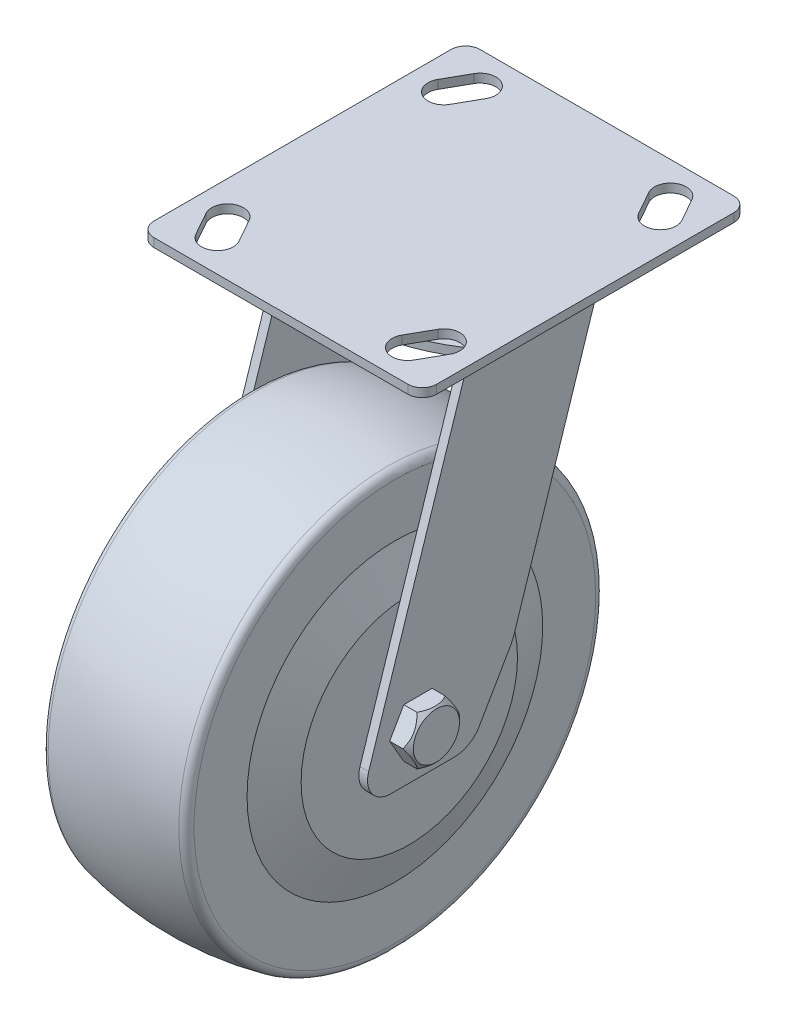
ISO-10303-21;
HEADER;
FILE_DESCRIPTION(('STEP AP214'),'2;1');
FILE_NAME('part.step','',(''),(''),'','','');
FILE_SCHEMA(('AUTOMOTIVE_DESIGN { 1 0 10303 214 1 1 1 1 }'));
ENDSEC;
DATA;
#1=APPLICATION_CONTEXT('core data for automotive mechanical design processes');
#2=APPLICATION_PROTOCOL_DEFINITION('international standard','automotive_design',2000,#1);
#3=PRODUCT_CONTEXT('',#1,'mechanical');
#4=PRODUCT('Part','Part','',(#3));
#5=PRODUCT_RELATED_PRODUCT_CATEGORY('part','',(#4));
#6=PRODUCT_DEFINITION_FORMATION('','',#4);
#7=PRODUCT_DEFINITION_CONTEXT('part definition',#1,'design');
#8=PRODUCT_DEFINITION('design','',#6,#7);
#9=PRODUCT_DEFINITION_SHAPE('','',#8);
#10=(LENGTH_UNIT() NAMED_UNIT(*) SI_UNIT(.MILLI.,.METRE.));
#11=(NAMED_UNIT(*) PLANE_ANGLE_UNIT() SI_UNIT($,.RADIAN.));
#12=(NAMED_UNIT(*) SI_UNIT($,.STERADIAN.) SOLID_ANGLE_UNIT());
#13=UNCERTAINTY_MEASURE_WITH_UNIT(LENGTH_MEASURE(1.E-05),#10,'distance_accuracy_value','');
#14=(GEOMETRIC_REPRESENTATION_CONTEXT(3) GLOBAL_UNCERTAINTY_ASSIGNED_CONTEXT((#13)) GLOBAL_UNIT_ASSIGNED_CONTEXT((#10,
#11,#12)) REPRESENTATION_CONTEXT('',''));
#15=CARTESIAN_POINT('',(0.,0.,0.));
#16=DIRECTION('',(0.,0.,1.));
#17=DIRECTION('',(1.,0.,0.));
#18=AXIS2_PLACEMENT_3D('',#15,#16,#17);
#19=CARTESIAN_POINT('',(49.7363674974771,100.27303722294,16.7698876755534));
#20=DIRECTION('',(0.,1.,0.));
#21=DIRECTION('',(0.,0.,1.));
#22=AXIS2_PLACEMENT_3D('',#19,#20,#21);
#23=PLANE('',#22);
#24=CARTESIAN_POINT('',(49.7363674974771,100.27303722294,40.7198876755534));
#25=DIRECTION('',(0.,1.,0.));
#26=DIRECTION('',(0.,0.,1.));
#27=AXIS2_PLACEMENT_3D('',#24,#25,#26);
#28=CIRCLE('',#27,17.5);
#29=CARTESIAN_POINT('',(49.7363674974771,100.27303722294,58.2198876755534));
#30=VERTEX_POINT('',#29);
#31=EDGE_CURVE('P0_E545',#30,#30,#28,.T.);
#32=ORIENTED_EDGE('',*,*,#31,.F.);
#33=EDGE_LOOP('',(#32));
#34=FACE_BOUND('',#33,.T.);
#35=DIRECTION('',(0.,0.,1.));
#36=VECTOR('',#35,1.);
#37=CARTESIAN_POINT('',(82.7363674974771,100.27303722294,66.2198876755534));
#38=LINE('',#37,#36);
#39=CARTESIAN_POINT('',(82.7363674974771,100.27303722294,66.2198876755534));
#40=VERTEX_POINT('',#39);
#41=CARTESIAN_POINT('',(82.7363674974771,100.27303722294,15.2198876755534));
#42=VERTEX_POINT('',#41);
#43=EDGE_CURVE('P0_E282',#40,#42,#38,.F.);
#44=ORIENTED_EDGE('',*,*,#43,.T.);
#45=CARTESIAN_POINT('',(49.7363674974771,100.27303722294,64.6698876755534));
#46=DIRECTION('',(0.,1.,0.));
#47=DIRECTION('',(0.,0.,1.));
#48=AXIS2_PLACEMENT_3D('',#45,#46,#47);
#49=CIRCLE('',#48,59.45);
#50=CARTESIAN_POINT('',(16.7363674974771,100.27303722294,15.2198876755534));
#51=VERTEX_POINT('',#50);
#52=EDGE_CURVE('P0_E116',#51,#42,#49,.F.);
#53=ORIENTED_EDGE('',*,*,#52,.F.);
#54=DIRECTION('',(0.,0.,-1.));
#55=VECTOR('',#54,1.);
#56=CARTESIAN_POINT('',(16.7363674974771,100.27303722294,15.2198876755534));
#57=LINE('',#56,#55);
#58=CARTESIAN_POINT('',(16.7363674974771,100.27303722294,66.2198876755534));
#59=VERTEX_POINT('',#58);
#60=EDGE_CURVE('P0_E296',#51,#59,#57,.F.);
#61=ORIENTED_EDGE('',*,*,#60,.T.);
#62=CARTESIAN_POINT('',(49.7363674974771,100.27303722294,16.7698876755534));
#63=DIRECTION('',(0.,1.,0.));
#64=DIRECTION('',(0.,0.,1.));
#65=AXIS2_PLACEMENT_3D('',#62,#63,#64);
#66=CIRCLE('',#65,59.45);
#67=EDGE_CURVE('P0_E286',#40,#59,#66,.F.);
#68=ORIENTED_EDGE('',*,*,#67,.F.);
#69=EDGE_LOOP('',(#44,#53,#61,#68));
#70=FACE_BOUND('',#69,.T.);
#71=ADVANCED_FACE('P0_F16',(#34,#70),#23,.T.);
#72=CARTESIAN_POINT('',(49.7363674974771,100.27303722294,64.6698876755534));
#73=DIRECTION('',(0.,1.,0.));
#74=DIRECTION('',(0.,0.,1.));
#75=AXIS2_PLACEMENT_3D('',#72,#73,#74);
#76=CYLINDRICAL_SURFACE('',#75,59.45);
#77=DIRECTION('',(0.,1.,0.));
#78=VECTOR('',#77,1.);
#79=CARTESIAN_POINT('',(16.7363674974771,100.27303722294,15.2198876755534));
#80=LINE('',#79,#78);
#81=CARTESIAN_POINT('',(16.7363674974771,97.2730372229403,15.2198876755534));
#82=VERTEX_POINT('',#81);
#83=EDGE_CURVE('P0_E294',#82,#51,#80,.T.);
#84=ORIENTED_EDGE('',*,*,#83,.T.);
#85=ORIENTED_EDGE('',*,*,#52,.T.);
#86=DIRECTION('',(0.,1.,0.));
#87=VECTOR('',#86,1.);
#88=CARTESIAN_POINT('',(82.7363674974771,100.27303722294,15.2198876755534));
#89=LINE('',#88,#87);
#90=CARTESIAN_POINT('',(82.7363674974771,97.2730372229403,15.2198876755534));
#91=VERTEX_POINT('',#90);
#92=EDGE_CURVE('P0_E297',#42,#91,#89,.F.);
#93=ORIENTED_EDGE('',*,*,#92,.T.);
#94=CARTESIAN_POINT('',(49.7363674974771,97.2730372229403,64.6698876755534));
#95=DIRECTION('',(0.,1.,0.));
#96=DIRECTION('',(0.,0.,1.));
#97=AXIS2_PLACEMENT_3D('',#94,#95,#96);
#98=CIRCLE('',#97,59.45);
#99=EDGE_CURVE('P0_E216',#91,#82,#98,.T.);
#100=ORIENTED_EDGE('',*,*,#99,.T.);
#101=EDGE_LOOP('',(#84,#85,#93,#100));
#102=FACE_BOUND('',#101,.T.);
#103=ADVANCED_FACE('P0_F554',(#102),#76,.T.);
#104=CARTESIAN_POINT('',(16.7363674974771,100.27303722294,15.2198876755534));
#105=DIRECTION('',(1.,0.,0.));
#106=DIRECTION('',(0.,0.,-1.));
#107=AXIS2_PLACEMENT_3D('',#104,#105,#106);
#108=PLANE('',#107);
#109=CARTESIAN_POINT('',(16.7363674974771,-4.72696277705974,82.7198876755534));
#110=DIRECTION('',(-1.,0.,0.));
#111=DIRECTION('',(0.,0.,1.));
#112=AXIS2_PLACEMENT_3D('',#109,#110,#111);
#113=CIRCLE('',#112,2.);
#114=CARTESIAN_POINT('',(16.7363674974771,-4.72696277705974,84.7198876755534));
#115=VERTEX_POINT('',#114);
#116=EDGE_CURVE('P0_E544',#115,#115,#113,.T.);
#117=ORIENTED_EDGE('',*,*,#116,.F.);
#118=EDGE_LOOP('',(#117));
#119=FACE_BOUND('',#118,.T.);
#120=CARTESIAN_POINT('',(16.7363674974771,-12.7269627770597,92.208832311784));
#121=DIRECTION('',(1.,0.,0.));
#122=DIRECTION('',(0.,0.,-1.));
#123=AXIS2_PLACEMENT_3D('',#120,#121,#122);
#124=CIRCLE('',#123,8.);
#125=CARTESIAN_POINT('',(16.7363674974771,-10.2548268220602,99.8172844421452));
#126=VERTEX_POINT('',#125);
#127=CARTESIAN_POINT('',(16.7363674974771,-20.7269627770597,92.208832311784));
#128=VERTEX_POINT('',#127);
#129=EDGE_CURVE('P0_E258',#126,#128,#124,.T.);
#130=ORIENTED_EDGE('',*,*,#129,.F.);
#131=DIRECTION('',(0.,-0.951056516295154,0.309016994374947));
#132=VECTOR('',#131,1.);
#133=CARTESIAN_POINT('',(16.7363674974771,-10.2548268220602,99.8172844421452));
#134=LINE('',#133,#132);
#135=CARTESIAN_POINT('',(16.7363674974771,97.2730372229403,64.8793635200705));
#136=VERTEX_POINT('',#135);
#137=EDGE_CURVE('P0_E251',#136,#126,#134,.T.);
#138=ORIENTED_EDGE('',*,*,#137,.F.);
#139=DIRECTION('',(0.,0.,-1.));
#140=VECTOR('',#139,1.);
#141=CARTESIAN_POINT('',(16.7363674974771,97.2730372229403,15.2198876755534));
#142=LINE('',#141,#140);
#143=CARTESIAN_POINT('',(16.7363674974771,97.2730372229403,66.2198876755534));
#144=VERTEX_POINT('',#143);
#145=EDGE_CURVE('P0_E300',#144,#136,#142,.T.);
#146=ORIENTED_EDGE('',*,*,#145,.F.);
#147=DIRECTION('',(0.,1.,0.));
#148=VECTOR('',#147,1.);
#149=CARTESIAN_POINT('',(16.7363674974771,100.27303722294,66.2198876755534));
#150=LINE('',#149,#148);
#151=EDGE_CURVE('P0_E283',#59,#144,#150,.F.);
#152=ORIENTED_EDGE('',*,*,#151,.F.);
#153=ORIENTED_EDGE('',*,*,#60,.F.);
#154=ORIENTED_EDGE('',*,*,#83,.F.);
#155=DIRECTION('',(0.,0.,1.));
#156=VECTOR('',#155,1.);
#157=CARTESIAN_POINT('',(16.7363674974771,97.2730372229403,16.7698876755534));
#158=LINE('',#157,#156);
#159=CARTESIAN_POINT('',(16.7363674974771,97.2730372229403,19.666487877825));
#160=VERTEX_POINT('',#159);
#161=EDGE_CURVE('P0_E213',#82,#160,#158,.T.);
#162=ORIENTED_EDGE('',*,*,#161,.T.);
#163=DIRECTION('',(0.,0.951056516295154,-0.309016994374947));
#164=VECTOR('',#163,1.);
#165=CARTESIAN_POINT('',(16.7363674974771,97.2730372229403,19.666487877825));
#166=LINE('',#165,#164);
#167=CARTESIAN_POINT('',(16.7363674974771,6.27223857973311,49.2344397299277));
#168=VERTEX_POINT('',#167);
#169=EDGE_CURVE('P0_E252',#168,#160,#166,.T.);
#170=ORIENTED_EDGE('',*,*,#169,.F.);
#171=CARTESIAN_POINT('',(16.7363674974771,12.4525784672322,68.255570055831));
#172=DIRECTION('',(1.,0.,0.));
#173=DIRECTION('',(0.,0.,-1.));
#174=AXIS2_PLACEMENT_3D('',#171,#172,#173);
#175=CIRCLE('',#174,20.0000000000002);
#176=CARTESIAN_POINT('',(16.7363674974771,2.45257846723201,50.935061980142));
#177=VERTEX_POINT('',#176);
#178=EDGE_CURVE('P0_E299',#177,#168,#175,.T.);
#179=ORIENTED_EDGE('',*,*,#178,.F.);
#180=DIRECTION('',(0.,0.866025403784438,-0.500000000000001));
#181=VECTOR('',#180,1.);
#182=CARTESIAN_POINT('',(16.7363674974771,2.45257846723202,50.935061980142));
#183=LINE('',#182,#181);
#184=CARTESIAN_POINT('',(16.7363674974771,-15.7269627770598,61.4310250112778));
#185=VERTEX_POINT('',#184);
#186=EDGE_CURVE('P0_E270',#185,#177,#183,.T.);
#187=ORIENTED_EDGE('',*,*,#186,.F.);
#188=CARTESIAN_POINT('',(16.7363674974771,-10.7269627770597,70.0912790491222));
#189=DIRECTION('',(1.,0.,0.));
#190=DIRECTION('',(0.,0.,-1.));
#191=AXIS2_PLACEMENT_3D('',#188,#189,#190);
#192=CIRCLE('',#191,9.99999999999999);
#193=CARTESIAN_POINT('',(16.7363674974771,-20.7269627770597,70.0912790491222));
#194=VERTEX_POINT('',#193);
#195=EDGE_CURVE('P0_E266',#194,#185,#192,.T.);
#196=ORIENTED_EDGE('',*,*,#195,.F.);
#197=DIRECTION('',(0.,0.,-1.));
#198=VECTOR('',#197,1.);
#199=CARTESIAN_POINT('',(16.7363674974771,-20.7269627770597,70.0912790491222));
#200=LINE('',#199,#198);
#201=EDGE_CURVE('P0_E262',#128,#194,#200,.T.);
#202=ORIENTED_EDGE('',*,*,#201,.F.);
#203=EDGE_LOOP('',(#130,#138,#146,#152,#153,#154,#162,#170,#179,#187,#196,#202));
#204=FACE_BOUND('',#203,.T.);
#205=ADVANCED_FACE('P0_F373',(#119,#204),#108,.F.);
#206=CARTESIAN_POINT('',(49.7363674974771,100.27303722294,16.7698876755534));
#207=DIRECTION('',(0.,1.,0.));
#208=DIRECTION('',(0.,0.,1.));
#209=AXIS2_PLACEMENT_3D('',#206,#207,#208);
#210=CYLINDRICAL_SURFACE('',#209,59.45);
#211=ORIENTED_EDGE('',*,*,#67,.T.);
#212=ORIENTED_EDGE('',*,*,#151,.T.);
#213=CARTESIAN_POINT('',(49.7363674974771,97.2730372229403,16.7698876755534));
#214=DIRECTION('',(0.,1.,0.));
#215=DIRECTION('',(0.,0.,1.));
#216=AXIS2_PLACEMENT_3D('',#213,#214,#215);
#217=CIRCLE('',#216,59.45);
#218=CARTESIAN_POINT('',(82.7363674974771,97.2730372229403,66.2198876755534));
#219=VERTEX_POINT('',#218);
#220=EDGE_CURVE('P0_E210',#144,#219,#217,.T.);
#221=ORIENTED_EDGE('',*,*,#220,.T.);
#222=DIRECTION('',(0.,1.,0.));
#223=VECTOR('',#222,1.);
#224=CARTESIAN_POINT('',(82.7363674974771,100.27303722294,66.2198876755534));
#225=LINE('',#224,#223);
#226=EDGE_CURVE('P0_E279',#219,#40,#225,.T.);
#227=ORIENTED_EDGE('',*,*,#226,.T.);
#228=EDGE_LOOP('',(#211,#212,#221,#227));
#229=FACE_BOUND('',#228,.T.);
#230=ADVANCED_FACE('P0_F566',(#229),#210,.T.);
#231=CARTESIAN_POINT('',(82.7363674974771,100.27303722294,66.2198876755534));
#232=DIRECTION('',(-1.,0.,0.));
#233=DIRECTION('',(0.,0.,1.));
#234=AXIS2_PLACEMENT_3D('',#231,#232,#233);
#235=PLANE('',#234);
#236=CARTESIAN_POINT('',(82.7363674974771,-4.72696277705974,82.7198876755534));
#237=DIRECTION('',(-1.,0.,0.));
#238=DIRECTION('',(0.,0.,1.));
#239=AXIS2_PLACEMENT_3D('',#236,#237,#238);
#240=CIRCLE('',#239,2.);
#241=CARTESIAN_POINT('',(82.7363674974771,-4.72696277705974,84.7198876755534));
#242=VERTEX_POINT('',#241);
#243=EDGE_CURVE('P0_E350',#242,#242,#240,.F.);
#244=ORIENTED_EDGE('',*,*,#243,.F.);
#245=EDGE_LOOP('',(#244));
#246=FACE_BOUND('',#245,.T.);
#247=DIRECTION('',(0.,0.,1.));
#248=VECTOR('',#247,1.);
#249=CARTESIAN_POINT('',(82.7363674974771,97.2730372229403,16.7698876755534));
#250=LINE('',#249,#248);
#251=CARTESIAN_POINT('',(82.7363674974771,97.2730372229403,64.8793635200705));
#252=VERTEX_POINT('',#251);
#253=EDGE_CURVE('P0_E206',#219,#252,#250,.F.);
#254=ORIENTED_EDGE('',*,*,#253,.T.);
#255=DIRECTION('',(0.,-0.951056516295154,0.309016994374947));
#256=VECTOR('',#255,1.);
#257=CARTESIAN_POINT('',(82.7363674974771,-10.2548268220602,99.8172844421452));
#258=LINE('',#257,#256);
#259=CARTESIAN_POINT('',(82.7363674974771,-10.2548268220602,99.8172844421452));
#260=VERTEX_POINT('',#259);
#261=EDGE_CURVE('P0_E185',#260,#252,#258,.F.);
#262=ORIENTED_EDGE('',*,*,#261,.F.);
#263=CARTESIAN_POINT('',(82.7363674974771,-12.7269627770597,92.208832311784));
#264=DIRECTION('',(1.,0.,0.));
#265=DIRECTION('',(0.,0.,-1.));
#266=AXIS2_PLACEMENT_3D('',#263,#264,#265);
#267=CIRCLE('',#266,8.);
#268=CARTESIAN_POINT('',(82.7363674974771,-20.7269627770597,92.208832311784));
#269=VERTEX_POINT('',#268);
#270=EDGE_CURVE('P0_E209',#269,#260,#267,.F.);
#271=ORIENTED_EDGE('',*,*,#270,.F.);
#272=DIRECTION('',(0.,0.,-1.));
#273=VECTOR('',#272,1.);
#274=CARTESIAN_POINT('',(82.7363674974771,-20.7269627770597,70.0912790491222));
#275=LINE('',#274,#273);
#276=CARTESIAN_POINT('',(82.7363674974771,-20.7269627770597,70.0912790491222));
#277=VERTEX_POINT('',#276);
#278=EDGE_CURVE('P0_E205',#277,#269,#275,.F.);
#279=ORIENTED_EDGE('',*,*,#278,.F.);
#280=CARTESIAN_POINT('',(82.7363674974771,-10.7269627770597,70.0912790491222));
#281=DIRECTION('',(1.,0.,0.));
#282=DIRECTION('',(0.,0.,-1.));
#283=AXIS2_PLACEMENT_3D('',#280,#281,#282);
#284=CIRCLE('',#283,9.99999999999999);
#285=CARTESIAN_POINT('',(82.7363674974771,-15.7269627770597,61.4310250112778));
#286=VERTEX_POINT('',#285);
#287=EDGE_CURVE('P0_E201',#286,#277,#284,.F.);
#288=ORIENTED_EDGE('',*,*,#287,.F.);
#289=DIRECTION('',(0.,0.866025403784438,-0.500000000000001));
#290=VECTOR('',#289,1.);
#291=CARTESIAN_POINT('',(82.7363674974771,2.45257846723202,50.935061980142));
#292=LINE('',#291,#290);
#293=CARTESIAN_POINT('',(82.7363674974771,2.45257846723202,50.935061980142));
#294=VERTEX_POINT('',#293);
#295=EDGE_CURVE('P0_E197',#294,#286,#292,.F.);
#296=ORIENTED_EDGE('',*,*,#295,.F.);
#297=CARTESIAN_POINT('',(82.7363674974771,12.4525784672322,68.255570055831));
#298=DIRECTION('',(1.,0.,0.));
#299=DIRECTION('',(0.,0.,-1.));
#300=AXIS2_PLACEMENT_3D('',#297,#298,#299);
#301=CIRCLE('',#300,20.0000000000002);
#302=CARTESIAN_POINT('',(82.7363674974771,6.27223857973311,49.2344397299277));
#303=VERTEX_POINT('',#302);
#304=EDGE_CURVE('P0_E187',#303,#294,#301,.F.);
#305=ORIENTED_EDGE('',*,*,#304,.F.);
#306=DIRECTION('',(0.,0.951056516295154,-0.309016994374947));
#307=VECTOR('',#306,1.);
#308=CARTESIAN_POINT('',(82.7363674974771,97.2730372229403,19.666487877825));
#309=LINE('',#308,#307);
#310=CARTESIAN_POINT('',(82.7363674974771,97.2730372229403,19.666487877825));
#311=VERTEX_POINT('',#310);
#312=EDGE_CURVE('P0_E182',#311,#303,#309,.F.);
#313=ORIENTED_EDGE('',*,*,#312,.F.);
#314=DIRECTION('',(0.,0.,1.));
#315=VECTOR('',#314,1.);
#316=CARTESIAN_POINT('',(82.7363674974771,97.2730372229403,16.7698876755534));
#317=LINE('',#316,#315);
#318=EDGE_CURVE('P0_E219',#311,#91,#317,.F.);
#319=ORIENTED_EDGE('',*,*,#318,.T.);
#320=ORIENTED_EDGE('',*,*,#92,.F.);
#321=ORIENTED_EDGE('',*,*,#43,.F.);
#322=ORIENTED_EDGE('',*,*,#226,.F.);
#323=EDGE_LOOP('',(#254,#262,#271,#279,#288,#296,#305,#313,#319,#320,#321,#322));
#324=FACE_BOUND('',#323,.T.);
#325=ADVANCED_FACE('P0_F558',(#246,#324),#235,.F.);
#326=CARTESIAN_POINT('',(240.736367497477,12.4525784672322,68.255570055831));
#327=DIRECTION('',(1.,0.,0.));
#328=DIRECTION('',(0.,0.,-1.));
#329=AXIS2_PLACEMENT_3D('',#326,#327,#328);
#330=CYLINDRICAL_SURFACE('',#329,20.0000000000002);
#331=DIRECTION('',(1.,0.,0.));
#332=VECTOR('',#331,1.);
#333=CARTESIAN_POINT('',(240.736367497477,2.452578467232,50.935061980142));
#334=LINE('',#333,#332);
#335=CARTESIAN_POINT('',(19.7363674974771,2.45257846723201,50.935061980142));
#336=VERTEX_POINT('',#335);
#337=EDGE_CURVE('P0_E267',#177,#336,#334,.T.);
#338=ORIENTED_EDGE('',*,*,#337,.F.);
#339=ORIENTED_EDGE('',*,*,#178,.T.);
#340=DIRECTION('',(1.,0.,0.));
#341=VECTOR('',#340,1.);
#342=CARTESIAN_POINT('',(240.736367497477,6.27223857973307,49.2344397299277));
#343=LINE('',#342,#341);
#344=CARTESIAN_POINT('',(19.7363674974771,6.27223857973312,49.2344397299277));
#345=VERTEX_POINT('',#344);
#346=EDGE_CURVE('P0_E249',#345,#168,#343,.F.);
#347=ORIENTED_EDGE('',*,*,#346,.F.);
#348=CARTESIAN_POINT('',(19.7363674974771,12.4525784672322,68.255570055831));
#349=DIRECTION('',(1.,0.,0.));
#350=DIRECTION('',(0.,0.,-1.));
#351=AXIS2_PLACEMENT_3D('',#348,#349,#350);
#352=CIRCLE('',#351,20.0000000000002);
#353=EDGE_CURVE('P0_E322',#345,#336,#352,.F.);
#354=ORIENTED_EDGE('',*,*,#353,.T.);
#355=EDGE_LOOP('',(#338,#339,#347,#354));
#356=FACE_BOUND('',#355,.T.);
#357=ADVANCED_FACE('P0_F378',(#356),#330,.T.);
#358=CARTESIAN_POINT('',(240.736367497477,2.45257846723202,50.935061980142));
#359=DIRECTION('',(0.,-0.500000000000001,-0.866025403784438));
#360=DIRECTION('',(0.,0.866025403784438,-0.500000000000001));
#361=AXIS2_PLACEMENT_3D('',#358,#359,#360);
#362=PLANE('',#361);
#363=DIRECTION('',(0.,-0.866025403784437,0.500000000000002));
#364=VECTOR('',#363,1.);
#365=CARTESIAN_POINT('',(19.7363674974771,2.45257846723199,50.935061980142));
#366=LINE('',#365,#364);
#367=CARTESIAN_POINT('',(19.7363674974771,-15.7269627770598,61.4310250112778));
#368=VERTEX_POINT('',#367);
#369=EDGE_CURVE('P0_E130',#336,#368,#366,.T.);
#370=ORIENTED_EDGE('',*,*,#369,.T.);
#371=DIRECTION('',(1.,0.,0.));
#372=VECTOR('',#371,1.);
#373=CARTESIAN_POINT('',(240.736367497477,-15.7269627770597,61.4310250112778));
#374=LINE('',#373,#372);
#375=EDGE_CURVE('P0_E263',#185,#368,#374,.T.);
#376=ORIENTED_EDGE('',*,*,#375,.F.);
#377=ORIENTED_EDGE('',*,*,#186,.T.);
#378=ORIENTED_EDGE('',*,*,#337,.T.);
#379=EDGE_LOOP('',(#370,#376,#377,#378));
#380=FACE_BOUND('',#379,.T.);
#381=ADVANCED_FACE('P0_F366',(#380),#362,.T.);
#382=CARTESIAN_POINT('',(240.736367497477,-10.7269627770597,70.0912790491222));
#383=DIRECTION('',(1.,0.,0.));
#384=DIRECTION('',(0.,0.,-1.));
#385=AXIS2_PLACEMENT_3D('',#382,#383,#384);
#386=CYLINDRICAL_SURFACE('',#385,9.99999999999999);
#387=DIRECTION('',(1.,0.,0.));
#388=VECTOR('',#387,1.);
#389=CARTESIAN_POINT('',(240.736367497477,-20.7269627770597,70.0912790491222));
#390=LINE('',#389,#388);
#391=CARTESIAN_POINT('',(19.7363674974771,-20.7269627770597,70.0912790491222));
#392=VERTEX_POINT('',#391);
#393=EDGE_CURVE('P0_E259',#194,#392,#390,.T.);
#394=ORIENTED_EDGE('',*,*,#393,.F.);
#395=ORIENTED_EDGE('',*,*,#195,.T.);
#396=ORIENTED_EDGE('',*,*,#375,.T.);
#397=CARTESIAN_POINT('',(19.7363674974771,-10.7269627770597,70.0912790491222));
#398=DIRECTION('',(1.,0.,0.));
#399=DIRECTION('',(0.,0.,-1.));
#400=AXIS2_PLACEMENT_3D('',#397,#398,#399);
#401=CIRCLE('',#400,9.99999999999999);
#402=EDGE_CURVE('P0_E319',#368,#392,#401,.F.);
#403=ORIENTED_EDGE('',*,*,#402,.T.);
#404=EDGE_LOOP('',(#394,#395,#396,#403));
#405=FACE_BOUND('',#404,.T.);
#406=ADVANCED_FACE('P0_F370',(#405),#386,.T.);
#407=CARTESIAN_POINT('',(240.736367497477,-20.7269627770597,70.0912790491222));
#408=DIRECTION('',(0.,-1.,0.));
#409=DIRECTION('',(0.,0.,-1.));
#410=AXIS2_PLACEMENT_3D('',#407,#408,#409);
#411=PLANE('',#410);
#412=DIRECTION('',(0.,0.,-1.));
#413=VECTOR('',#412,1.);
#414=CARTESIAN_POINT('',(19.7363674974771,-20.7269627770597,78.2198876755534));
#415=LINE('',#414,#413);
#416=CARTESIAN_POINT('',(19.7363674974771,-20.7269627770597,92.208832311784));
#417=VERTEX_POINT('',#416);
#418=EDGE_CURVE('P0_E318',#392,#417,#415,.F.);
#419=ORIENTED_EDGE('',*,*,#418,.T.);
#420=DIRECTION('',(1.,0.,0.));
#421=VECTOR('',#420,1.);
#422=CARTESIAN_POINT('',(240.736367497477,-20.7269627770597,92.208832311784));
#423=LINE('',#422,#421);
#424=EDGE_CURVE('P0_E255',#128,#417,#423,.T.);
#425=ORIENTED_EDGE('',*,*,#424,.F.);
#426=ORIENTED_EDGE('',*,*,#201,.T.);
#427=ORIENTED_EDGE('',*,*,#393,.T.);
#428=EDGE_LOOP('',(#419,#425,#426,#427));
#429=FACE_BOUND('',#428,.T.);
#430=ADVANCED_FACE('P0_F395',(#429),#411,.T.);
#431=CARTESIAN_POINT('',(240.736367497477,-12.7269627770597,92.208832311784));
#432=DIRECTION('',(1.,0.,0.));
#433=DIRECTION('',(0.,0.,-1.));
#434=AXIS2_PLACEMENT_3D('',#431,#432,#433);
#435=CYLINDRICAL_SURFACE('',#434,8.);
#436=DIRECTION('',(1.,0.,0.));
#437=VECTOR('',#436,1.);
#438=CARTESIAN_POINT('',(240.736367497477,-10.2548268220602,99.8172844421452));
#439=LINE('',#438,#437);
#440=CARTESIAN_POINT('',(19.7363674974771,-10.2548268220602,99.8172844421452));
#441=VERTEX_POINT('',#440);
#442=EDGE_CURVE('P0_E222',#126,#441,#439,.T.);
#443=ORIENTED_EDGE('',*,*,#442,.F.);
#444=ORIENTED_EDGE('',*,*,#129,.T.);
#445=ORIENTED_EDGE('',*,*,#424,.T.);
#446=CARTESIAN_POINT('',(19.7363674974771,-12.7269627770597,92.208832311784));
#447=DIRECTION('',(1.,0.,0.));
#448=DIRECTION('',(0.,0.,-1.));
#449=AXIS2_PLACEMENT_3D('',#446,#447,#448);
#450=CIRCLE('',#449,8.);
#451=EDGE_CURVE('P0_E315',#417,#441,#450,.F.);
#452=ORIENTED_EDGE('',*,*,#451,.T.);
#453=EDGE_LOOP('',(#443,#444,#445,#452));
#454=FACE_BOUND('',#453,.T.);
#455=ADVANCED_FACE('P0_F393',(#454),#435,.T.);
#456=CARTESIAN_POINT('',(240.736367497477,97.2730372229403,19.666487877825));
#457=DIRECTION('',(0.,-0.309016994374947,-0.951056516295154));
#458=DIRECTION('',(0.,0.951056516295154,-0.309016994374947));
#459=AXIS2_PLACEMENT_3D('',#456,#457,#458);
#460=PLANE('',#459);
#461=DIRECTION('',(0.,0.951056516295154,-0.309016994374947));
#462=VECTOR('',#461,1.);
#463=CARTESIAN_POINT('',(19.7363674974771,14.4153132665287,46.5885943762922));
#464=LINE('',#463,#462);
#465=CARTESIAN_POINT('',(19.7363674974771,97.2730372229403,19.666487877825));
#466=VERTEX_POINT('',#465);
#467=EDGE_CURVE('P0_E123',#345,#466,#464,.T.);
#468=ORIENTED_EDGE('',*,*,#467,.F.);
#469=ORIENTED_EDGE('',*,*,#346,.T.);
#470=ORIENTED_EDGE('',*,*,#169,.T.);
#471=DIRECTION('',(1.,0.,0.));
#472=VECTOR('',#471,1.);
#473=CARTESIAN_POINT('',(49.7363674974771,97.2730372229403,19.666487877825));
#474=LINE('',#473,#472);
#475=EDGE_CURVE('P0_E215',#160,#466,#474,.T.);
#476=ORIENTED_EDGE('',*,*,#475,.T.);
#477=EDGE_LOOP('',(#468,#469,#470,#476));
#478=FACE_BOUND('',#477,.T.);
#479=ADVANCED_FACE('P0_F382',(#478),#460,.T.);
#480=CARTESIAN_POINT('',(240.736367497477,-10.2548268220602,99.8172844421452));
#481=DIRECTION('',(0.,0.309016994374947,0.951056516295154));
#482=DIRECTION('',(0.,-0.951056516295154,0.309016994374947));
#483=AXIS2_PLACEMENT_3D('',#480,#481,#482);
#484=PLANE('',#483);
#485=DIRECTION('',(0.,-0.951056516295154,0.309016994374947));
#486=VECTOR('',#485,1.);
#487=CARTESIAN_POINT('',(19.7363674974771,97.2730372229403,64.8793635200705));
#488=LINE('',#487,#486);
#489=CARTESIAN_POINT('',(19.7363674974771,97.2730372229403,64.8793635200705));
#490=VERTEX_POINT('',#489);
#491=EDGE_CURVE('P0_E231',#490,#441,#488,.T.);
#492=ORIENTED_EDGE('',*,*,#491,.F.);
#493=DIRECTION('',(1.,0.,0.));
#494=VECTOR('',#493,1.);
#495=CARTESIAN_POINT('',(49.7363674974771,97.2730372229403,64.8793635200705));
#496=LINE('',#495,#494);
#497=EDGE_CURVE('P0_E241',#490,#136,#496,.F.);
#498=ORIENTED_EDGE('',*,*,#497,.T.);
#499=ORIENTED_EDGE('',*,*,#137,.T.);
#500=ORIENTED_EDGE('',*,*,#442,.T.);
#501=EDGE_LOOP('',(#492,#498,#499,#500));
#502=FACE_BOUND('',#501,.T.);
#503=ADVANCED_FACE('P0_F390',(#502),#484,.T.);
#504=CARTESIAN_POINT('',(49.7363674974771,97.2730372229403,16.7698876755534));
#505=DIRECTION('',(0.,1.,0.));
#506=DIRECTION('',(0.,0.,1.));
#507=AXIS2_PLACEMENT_3D('',#504,#505,#506);
#508=PLANE('',#507);
#509=ORIENTED_EDGE('',*,*,#220,.F.);
#510=ORIENTED_EDGE('',*,*,#145,.T.);
#511=ORIENTED_EDGE('',*,*,#497,.F.);
#512=DIRECTION('',(0.,0.,-1.));
#513=VECTOR('',#512,1.);
#514=CARTESIAN_POINT('',(19.7363674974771,97.2730372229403,108.219887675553));
#515=LINE('',#514,#513);
#516=EDGE_CURVE('P0_E236',#466,#490,#515,.F.);
#517=ORIENTED_EDGE('',*,*,#516,.F.);
#518=ORIENTED_EDGE('',*,*,#475,.F.);
#519=ORIENTED_EDGE('',*,*,#161,.F.);
#520=ORIENTED_EDGE('',*,*,#99,.F.);
#521=ORIENTED_EDGE('',*,*,#318,.F.);
#522=DIRECTION('',(1.,0.,0.));
#523=VECTOR('',#522,1.);
#524=CARTESIAN_POINT('',(240.736367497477,97.2730372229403,19.666487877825));
#525=LINE('',#524,#523);
#526=CARTESIAN_POINT('',(79.7363674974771,97.2730372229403,19.666487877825));
#527=VERTEX_POINT('',#526);
#528=EDGE_CURVE('P0_E183',#527,#311,#525,.T.);
#529=ORIENTED_EDGE('',*,*,#528,.F.);
#530=DIRECTION('',(0.,0.,1.));
#531=VECTOR('',#530,1.);
#532=CARTESIAN_POINT('',(79.7363674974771,97.2730372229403,13.3444310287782));
#533=LINE('',#532,#531);
#534=CARTESIAN_POINT('',(79.7363674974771,97.2730372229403,64.8793635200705));
#535=VERTEX_POINT('',#534);
#536=EDGE_CURVE('P0_E164',#535,#527,#533,.F.);
#537=ORIENTED_EDGE('',*,*,#536,.F.);
#538=DIRECTION('',(1.,0.,0.));
#539=VECTOR('',#538,1.);
#540=CARTESIAN_POINT('',(240.736367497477,97.2730372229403,64.8793635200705));
#541=LINE('',#540,#539);
#542=EDGE_CURVE('P0_E225',#252,#535,#541,.F.);
#543=ORIENTED_EDGE('',*,*,#542,.F.);
#544=ORIENTED_EDGE('',*,*,#253,.F.);
#545=EDGE_LOOP('',(#509,#510,#511,#517,#518,#519,#520,#521,#529,#537,#543,#544));
#546=FACE_BOUND('',#545,.T.);
#547=ADVANCED_FACE('P0_F386',(#546),#508,.F.);
#548=CARTESIAN_POINT('',(240.736367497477,-12.7269627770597,92.208832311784));
#549=DIRECTION('',(1.,0.,0.));
#550=DIRECTION('',(0.,0.,-1.));
#551=AXIS2_PLACEMENT_3D('',#548,#549,#550);
#552=CYLINDRICAL_SURFACE('',#551,8.);
#553=DIRECTION('',(1.,0.,0.));
#554=VECTOR('',#553,1.);
#555=CARTESIAN_POINT('',(240.736367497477,-20.7269627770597,92.208832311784));
#556=LINE('',#555,#554);
#557=CARTESIAN_POINT('',(79.7363674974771,-20.7269627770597,92.208832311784));
#558=VERTEX_POINT('',#557);
#559=EDGE_CURVE('P0_E202',#269,#558,#556,.F.);
#560=ORIENTED_EDGE('',*,*,#559,.F.);
#561=ORIENTED_EDGE('',*,*,#270,.T.);
#562=DIRECTION('',(1.,0.,0.));
#563=VECTOR('',#562,1.);
#564=CARTESIAN_POINT('',(240.736367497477,-10.2548268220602,99.8172844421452));
#565=LINE('',#564,#563);
#566=CARTESIAN_POINT('',(79.7363674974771,-10.2548268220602,99.8172844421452));
#567=VERTEX_POINT('',#566);
#568=EDGE_CURVE('P0_E191',#567,#260,#565,.T.);
#569=ORIENTED_EDGE('',*,*,#568,.F.);
#570=CARTESIAN_POINT('',(79.7363674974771,-12.7269627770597,92.208832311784));
#571=DIRECTION('',(1.,0.,0.));
#572=DIRECTION('',(0.,0.,-1.));
#573=AXIS2_PLACEMENT_3D('',#570,#571,#572);
#574=CIRCLE('',#573,8.);
#575=EDGE_CURVE('P0_E230',#567,#558,#574,.T.);
#576=ORIENTED_EDGE('',*,*,#575,.T.);
#577=EDGE_LOOP('',(#560,#561,#569,#576));
#578=FACE_BOUND('',#577,.T.);
#579=ADVANCED_FACE('P0_F440',(#578),#552,.T.);
#580=CARTESIAN_POINT('',(240.736367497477,-20.7269627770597,70.0912790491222));
#581=DIRECTION('',(0.,-1.,0.));
#582=DIRECTION('',(0.,0.,-1.));
#583=AXIS2_PLACEMENT_3D('',#580,#581,#582);
#584=PLANE('',#583);
#585=DIRECTION('',(0.,0.,1.));
#586=VECTOR('',#585,1.);
#587=CARTESIAN_POINT('',(79.7363674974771,-20.7269627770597,78.2198876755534));
#588=LINE('',#587,#586);
#589=CARTESIAN_POINT('',(79.7363674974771,-20.7269627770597,70.0912790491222));
#590=VERTEX_POINT('',#589);
#591=EDGE_CURVE('P0_E312',#558,#590,#588,.F.);
#592=ORIENTED_EDGE('',*,*,#591,.T.);
#593=DIRECTION('',(1.,0.,0.));
#594=VECTOR('',#593,1.);
#595=CARTESIAN_POINT('',(240.736367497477,-20.7269627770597,70.0912790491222));
#596=LINE('',#595,#594);
#597=EDGE_CURVE('P0_E198',#277,#590,#596,.F.);
#598=ORIENTED_EDGE('',*,*,#597,.F.);
#599=ORIENTED_EDGE('',*,*,#278,.T.);
#600=ORIENTED_EDGE('',*,*,#559,.T.);
#601=EDGE_LOOP('',(#592,#598,#599,#600));
#602=FACE_BOUND('',#601,.T.);
#603=ADVANCED_FACE('P0_F436',(#602),#584,.T.);
#604=CARTESIAN_POINT('',(240.736367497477,-10.7269627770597,70.0912790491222));
#605=DIRECTION('',(1.,0.,0.));
#606=DIRECTION('',(0.,0.,-1.));
#607=AXIS2_PLACEMENT_3D('',#604,#605,#606);
#608=CYLINDRICAL_SURFACE('',#607,9.99999999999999);
#609=DIRECTION('',(1.,0.,0.));
#610=VECTOR('',#609,1.);
#611=CARTESIAN_POINT('',(240.736367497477,-15.7269627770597,61.4310250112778));
#612=LINE('',#611,#610);
#613=CARTESIAN_POINT('',(79.7363674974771,-15.7269627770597,61.4310250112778));
#614=VERTEX_POINT('',#613);
#615=EDGE_CURVE('P0_E194',#286,#614,#612,.F.);
#616=ORIENTED_EDGE('',*,*,#615,.F.);
#617=ORIENTED_EDGE('',*,*,#287,.T.);
#618=ORIENTED_EDGE('',*,*,#597,.T.);
#619=CARTESIAN_POINT('',(79.7363674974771,-10.7269627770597,70.0912790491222));
#620=DIRECTION('',(1.,0.,0.));
#621=DIRECTION('',(0.,0.,-1.));
#622=AXIS2_PLACEMENT_3D('',#619,#620,#621);
#623=CIRCLE('',#622,9.99999999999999);
#624=EDGE_CURVE('P0_E309',#590,#614,#623,.T.);
#625=ORIENTED_EDGE('',*,*,#624,.T.);
#626=EDGE_LOOP('',(#616,#617,#618,#625));
#627=FACE_BOUND('',#626,.T.);
#628=ADVANCED_FACE('P0_F432',(#627),#608,.T.);
#629=CARTESIAN_POINT('',(240.736367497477,2.45257846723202,50.935061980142));
#630=DIRECTION('',(0.,-0.500000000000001,-0.866025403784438));
#631=DIRECTION('',(0.,0.866025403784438,-0.500000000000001));
#632=AXIS2_PLACEMENT_3D('',#629,#630,#631);
#633=PLANE('',#632);
#634=DIRECTION('',(0.,0.866025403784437,-0.500000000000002));
#635=VECTOR('',#634,1.);
#636=CARTESIAN_POINT('',(79.7363674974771,-15.7269627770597,61.4310250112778));
#637=LINE('',#636,#635);
#638=CARTESIAN_POINT('',(79.7363674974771,2.45257846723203,50.935061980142));
#639=VERTEX_POINT('',#638);
#640=EDGE_CURVE('P0_E179',#614,#639,#637,.T.);
#641=ORIENTED_EDGE('',*,*,#640,.T.);
#642=DIRECTION('',(1.,0.,0.));
#643=VECTOR('',#642,1.);
#644=CARTESIAN_POINT('',(240.736367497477,2.45257846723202,50.935061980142));
#645=LINE('',#644,#643);
#646=EDGE_CURVE('P0_E178',#294,#639,#645,.F.);
#647=ORIENTED_EDGE('',*,*,#646,.F.);
#648=ORIENTED_EDGE('',*,*,#295,.T.);
#649=ORIENTED_EDGE('',*,*,#615,.T.);
#650=EDGE_LOOP('',(#641,#647,#648,#649));
#651=FACE_BOUND('',#650,.T.);
#652=ADVANCED_FACE('P0_F429',(#651),#633,.T.);
#653=CARTESIAN_POINT('',(240.736367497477,12.4525784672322,68.255570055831));
#654=DIRECTION('',(1.,0.,0.));
#655=DIRECTION('',(0.,0.,-1.));
#656=AXIS2_PLACEMENT_3D('',#653,#654,#655);
#657=CYLINDRICAL_SURFACE('',#656,20.0000000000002);
#658=DIRECTION('',(1.,0.,0.));
#659=VECTOR('',#658,1.);
#660=CARTESIAN_POINT('',(240.736367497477,6.27223857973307,49.2344397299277));
#661=LINE('',#660,#659);
#662=CARTESIAN_POINT('',(79.7363674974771,6.27223857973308,49.2344397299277));
#663=VERTEX_POINT('',#662);
#664=EDGE_CURVE('P0_E175',#303,#663,#661,.F.);
#665=ORIENTED_EDGE('',*,*,#664,.F.);
#666=ORIENTED_EDGE('',*,*,#304,.T.);
#667=ORIENTED_EDGE('',*,*,#646,.T.);
#668=CARTESIAN_POINT('',(79.7363674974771,12.4525784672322,68.255570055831));
#669=DIRECTION('',(1.,0.,0.));
#670=DIRECTION('',(0.,0.,-1.));
#671=AXIS2_PLACEMENT_3D('',#668,#669,#670);
#672=CIRCLE('',#671,20.0000000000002);
#673=EDGE_CURVE('P0_E161',#639,#663,#672,.T.);
#674=ORIENTED_EDGE('',*,*,#673,.T.);
#675=EDGE_LOOP('',(#665,#666,#667,#674));
#676=FACE_BOUND('',#675,.T.);
#677=ADVANCED_FACE('P0_F173',(#676),#657,.T.);
#678=CARTESIAN_POINT('',(240.736367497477,97.2730372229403,19.666487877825));
#679=DIRECTION('',(0.,-0.309016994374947,-0.951056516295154));
#680=DIRECTION('',(0.,0.951056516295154,-0.309016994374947));
#681=AXIS2_PLACEMENT_3D('',#678,#679,#680);
#682=PLANE('',#681);
#683=DIRECTION('',(0.,0.951056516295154,-0.309016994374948));
#684=VECTOR('',#683,1.);
#685=CARTESIAN_POINT('',(79.7363674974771,6.27223857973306,49.2344397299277));
#686=LINE('',#685,#684);
#687=EDGE_CURVE('P0_E25',#663,#527,#686,.T.);
#688=ORIENTED_EDGE('',*,*,#687,.T.);
#689=ORIENTED_EDGE('',*,*,#528,.T.);
#690=ORIENTED_EDGE('',*,*,#312,.T.);
#691=ORIENTED_EDGE('',*,*,#664,.T.);
#692=EDGE_LOOP('',(#688,#689,#690,#691));
#693=FACE_BOUND('',#692,.T.);
#694=ADVANCED_FACE('P0_F181',(#693),#682,.T.);
#695=CARTESIAN_POINT('',(240.736367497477,-10.2548268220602,99.8172844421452));
#696=DIRECTION('',(0.,0.309016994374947,0.951056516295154));
#697=DIRECTION('',(0.,-0.951056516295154,0.309016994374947));
#698=AXIS2_PLACEMENT_3D('',#695,#696,#697);
#699=PLANE('',#698);
#700=DIRECTION('',(0.,-0.951056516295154,0.309016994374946));
#701=VECTOR('',#700,1.);
#702=CARTESIAN_POINT('',(79.7363674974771,30.856656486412,86.4593537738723));
#703=LINE('',#702,#701);
#704=EDGE_CURVE('P0_E10',#535,#567,#703,.T.);
#705=ORIENTED_EDGE('',*,*,#704,.T.);
#706=ORIENTED_EDGE('',*,*,#568,.T.);
#707=ORIENTED_EDGE('',*,*,#261,.T.);
#708=ORIENTED_EDGE('',*,*,#542,.T.);
#709=EDGE_LOOP('',(#705,#706,#707,#708));
#710=FACE_BOUND('',#709,.T.);
#711=ADVANCED_FACE('P0_F416',(#710),#699,.T.);
#712=CARTESIAN_POINT('',(19.7363674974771,-93.7269627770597,108.219887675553));
#713=DIRECTION('',(1.,0.,0.));
#714=DIRECTION('',(0.,0.,-1.));
#715=AXIS2_PLACEMENT_3D('',#712,#713,#714);
#716=PLANE('',#715);
#717=CARTESIAN_POINT('',(19.7363674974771,-4.72696277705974,82.7198876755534));
#718=DIRECTION('',(1.,0.,0.));
#719=DIRECTION('',(0.,0.,-1.));
#720=AXIS2_PLACEMENT_3D('',#717,#718,#719);
#721=CIRCLE('',#720,2.);
#722=CARTESIAN_POINT('',(19.7363674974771,-4.72696277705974,80.7198876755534));
#723=VERTEX_POINT('',#722);
#724=EDGE_CURVE('P0_E339',#723,#723,#721,.T.);
#725=ORIENTED_EDGE('',*,*,#724,.F.);
#726=EDGE_LOOP('',(#725));
#727=FACE_BOUND('',#726,.T.);
#728=ORIENTED_EDGE('',*,*,#491,.T.);
#729=ORIENTED_EDGE('',*,*,#451,.F.);
#730=ORIENTED_EDGE('',*,*,#418,.F.);
#731=ORIENTED_EDGE('',*,*,#402,.F.);
#732=ORIENTED_EDGE('',*,*,#369,.F.);
#733=ORIENTED_EDGE('',*,*,#353,.F.);
#734=ORIENTED_EDGE('',*,*,#467,.T.);
#735=ORIENTED_EDGE('',*,*,#516,.T.);
#736=EDGE_LOOP('',(#728,#729,#730,#731,#732,#733,#734,#735));
#737=FACE_BOUND('',#736,.T.);
#738=ADVANCED_FACE('P0_F379',(#727,#737),#716,.T.);
#739=CARTESIAN_POINT('',(79.7363674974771,-93.7269627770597,13.3444310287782));
#740=DIRECTION('',(-1.,0.,0.));
#741=DIRECTION('',(0.,0.,1.));
#742=AXIS2_PLACEMENT_3D('',#739,#740,#741);
#743=PLANE('',#742);
#744=CARTESIAN_POINT('',(79.7363674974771,-4.72696277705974,82.7198876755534));
#745=DIRECTION('',(-1.,0.,0.));
#746=DIRECTION('',(0.,0.,1.));
#747=AXIS2_PLACEMENT_3D('',#744,#745,#746);
#748=CIRCLE('',#747,2.);
#749=CARTESIAN_POINT('',(79.7363674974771,-4.72696277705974,84.7198876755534));
#750=VERTEX_POINT('',#749);
#751=EDGE_CURVE('P0_E19',#750,#750,#748,.T.);
#752=ORIENTED_EDGE('',*,*,#751,.F.);
#753=EDGE_LOOP('',(#752));
#754=FACE_BOUND('',#753,.T.);
#755=ORIENTED_EDGE('',*,*,#536,.T.);
#756=ORIENTED_EDGE('',*,*,#687,.F.);
#757=ORIENTED_EDGE('',*,*,#673,.F.);
#758=ORIENTED_EDGE('',*,*,#640,.F.);
#759=ORIENTED_EDGE('',*,*,#624,.F.);
#760=ORIENTED_EDGE('',*,*,#591,.F.);
#761=ORIENTED_EDGE('',*,*,#575,.F.);
#762=ORIENTED_EDGE('',*,*,#704,.F.);
#763=EDGE_LOOP('',(#755,#756,#757,#758,#759,#760,#761,#762));
#764=FACE_BOUND('',#763,.T.);
#765=ADVANCED_FACE('P0_F160',(#754,#764),#743,.T.);
#766=CARTESIAN_POINT('',(88.3932217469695,-4.72696277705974,82.7198876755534));
#767=DIRECTION('',(-1.,0.,0.));
#768=DIRECTION('',(0.,0.,1.));
#769=AXIS2_PLACEMENT_3D('',#766,#767,#768);
#770=CYLINDRICAL_SURFACE('',#769,2.);
#771=ORIENTED_EDGE('',*,*,#751,.T.);
#772=EDGE_LOOP('',(#771));
#773=FACE_BOUND('',#772,.T.);
#774=ORIENTED_EDGE('',*,*,#243,.T.);
#775=EDGE_LOOP('',(#774));
#776=FACE_BOUND('',#775,.T.);
#777=ADVANCED_FACE('P0_F406',(#773,#776),#770,.F.);
#778=ORIENTED_EDGE('',*,*,#724,.T.);
#779=EDGE_LOOP('',(#778));
#780=FACE_BOUND('',#779,.T.);
#781=ORIENTED_EDGE('',*,*,#116,.T.);
#782=EDGE_LOOP('',(#781));
#783=FACE_BOUND('',#782,.T.);
#784=ADVANCED_FACE('P0_F413',(#780,#783),#770,.F.);
#785=CARTESIAN_POINT('',(49.7363674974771,99.2730372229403,40.7198876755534));
#786=DIRECTION('',(0.,1.,0.));
#787=DIRECTION('',(0.,0.,1.));
#788=AXIS2_PLACEMENT_3D('',#785,#786,#787);
#789=CYLINDRICAL_SURFACE('',#788,17.5);
#790=CARTESIAN_POINT('',(49.7363674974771,99.2730372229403,40.7198876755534));
#791=DIRECTION('',(0.,1.,0.));
#792=DIRECTION('',(0.,0.,1.));
#793=AXIS2_PLACEMENT_3D('',#790,#791,#792);
#794=CIRCLE('',#793,17.5);
#795=CARTESIAN_POINT('',(49.7363674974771,99.2730372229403,58.2198876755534));
#796=VERTEX_POINT('',#795);
#797=EDGE_CURVE('P0_E543',#796,#796,#794,.T.);
#798=ORIENTED_EDGE('',*,*,#797,.F.);
#799=EDGE_LOOP('',(#798));
#800=FACE_BOUND('',#799,.T.);
#801=ORIENTED_EDGE('',*,*,#31,.T.);
#802=EDGE_LOOP('',(#801));
#803=FACE_BOUND('',#802,.T.);
#804=ADVANCED_FACE('P0_F518',(#800,#803),#789,.F.);
#805=CARTESIAN_POINT('',(49.7363674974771,99.2730372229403,40.7198876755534));
#806=DIRECTION('',(0.,1.,0.));
#807=DIRECTION('',(0.,0.,1.));
#808=AXIS2_PLACEMENT_3D('',#805,#806,#807);
#809=PLANE('',#808);
#810=ORIENTED_EDGE('',*,*,#797,.T.);
#811=EDGE_LOOP('',(#810));
#812=FACE_BOUND('',#811,.T.);
#813=ADVANCED_FACE('P0_F526',(#812),#809,.T.);
#814=CLOSED_SHELL('',(#71,#103,#205,#230,#325,#357,#381,#406,#430,#455,#479,#503,#547,#579,#603,
#628,#652,#677,#694,#711,#738,#765,#777,#784,#804,#813));
#815=MANIFOLD_SOLID_BREP('P0_B1',#814);
#816=CARTESIAN_POINT('',(89.1363674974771,3.27303722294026,82.7198876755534));
#817=DIRECTION('',(-1.,0.,0.));
#818=DIRECTION('',(0.,0.,1.));
#819=AXIS2_PLACEMENT_3D('',#816,#817,#818);
#820=PLANE('',#819);
#821=CARTESIAN_POINT('',(89.1363674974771,-4.72696277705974,82.7198876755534));
#822=DIRECTION('',(-1.,0.,0.));
#823=DIRECTION('',(0.,0.,1.));
#824=AXIS2_PLACEMENT_3D('',#821,#822,#823);
#825=CIRCLE('',#824,8.);
#826=CARTESIAN_POINT('',(89.1363674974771,-4.72696277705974,90.7198876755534));
#827=VERTEX_POINT('',#826);
#828=EDGE_CURVE('P1_E20',#827,#827,#825,.T.);
#829=ORIENTED_EDGE('',*,*,#828,.F.);
#830=EDGE_LOOP('',(#829));
#831=FACE_BOUND('',#830,.T.);
#832=ADVANCED_FACE('P1_F17',(#831),#820,.F.);
#833=CARTESIAN_POINT('',(87.3105231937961,-4.72696277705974,82.7198876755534));
#834=DIRECTION('',(-1.,0.,0.));
#835=DIRECTION('',(0.,0.,1.));
#836=AXIS2_PLACEMENT_3D('',#833,#834,#835);
#837=CONICAL_SURFACE('',#836,9.82584430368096,0.78539816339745);
#838=CARTESIAN_POINT('',(87.3214129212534,3.77303722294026,87.6273649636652));
#839=CARTESIAN_POINT('',(87.4057665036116,3.77303722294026,87.4586261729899));
#840=CARTESIAN_POINT('',(87.4875455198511,3.77303722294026,87.2885706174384));
#841=CARTESIAN_POINT('',(87.6451377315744,3.77303722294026,86.945610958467));
#842=CARTESIAN_POINT('',(87.7209476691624,3.77303722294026,86.7727053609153));
#843=CARTESIAN_POINT('',(87.8661060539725,3.77303722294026,86.4230151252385));
#844=CARTESIAN_POINT('',(87.9354150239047,3.77303722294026,86.2462139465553));
#845=CARTESIAN_POINT('',(88.066061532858,3.77303722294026,85.889745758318));
#846=CARTESIAN_POINT('',(88.1274002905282,3.77303722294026,85.710079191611));
#847=CARTESIAN_POINT('',(88.2960840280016,3.77303722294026,85.1724112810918));
#848=CARTESIAN_POINT('',(88.3904939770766,3.77303722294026,84.8101178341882));
#849=CARTESIAN_POINT('',(88.4996918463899,3.77303722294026,84.2607955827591));
#850=CARTESIAN_POINT('',(88.5306737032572,3.77303722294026,84.0768915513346));
#851=CARTESIAN_POINT('',(88.5811370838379,3.77303722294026,83.7075201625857));
#852=CARTESIAN_POINT('',(88.6006203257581,3.77303722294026,83.5220530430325));
#853=CARTESIAN_POINT('',(88.6332874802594,3.77303722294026,83.0700808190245));
#854=CARTESIAN_POINT('',(88.6401405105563,3.77303722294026,82.8030894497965));
#855=CARTESIAN_POINT('',(88.6286313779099,3.77303722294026,82.2695873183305));
#856=CARTESIAN_POINT('',(88.6102603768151,3.77303722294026,82.003076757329));
#857=CARTESIAN_POINT('',(88.5493858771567,3.77303722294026,81.4725686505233));
#858=CARTESIAN_POINT('',(88.5068553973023,3.77303722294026,81.2085742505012));
#859=CARTESIAN_POINT('',(88.3999741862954,3.77303722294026,80.6851228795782));
#860=CARTESIAN_POINT('',(88.3356251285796,3.77303722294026,80.4256655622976));
#861=CARTESIAN_POINT('',(88.2032489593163,3.77303722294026,79.9651139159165));
#862=CARTESIAN_POINT('',(88.1387052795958,3.77303722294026,79.7629991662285));
#863=CARTESIAN_POINT('',(87.9992184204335,3.77303722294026,79.3623972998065));
#864=CARTESIAN_POINT('',(87.924274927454,3.77303722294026,79.1639102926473));
#865=CARTESIAN_POINT('',(87.7656680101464,3.77303722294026,78.7711891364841));
#866=CARTESIAN_POINT('',(87.6820320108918,3.77303722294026,78.5769438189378));
#867=CARTESIAN_POINT('',(87.507137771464,3.77303722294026,78.1920494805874));
#868=CARTESIAN_POINT('',(87.4158842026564,3.77303722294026,78.0013983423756));
#869=CARTESIAN_POINT('',(87.3214129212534,3.77303722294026,77.8124103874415));
#870=B_SPLINE_CURVE_WITH_KNOTS('',3,(#838,#839,#840,#841,#842,#843,#844,#845,#846,#847,#848,
#849,#850,#851,#852,#853,#854,#855,#856,#857,#858,#859,#860,#861,#862,#863,#864,#865,#866,#867,
#868,#869),.UNSPECIFIED.,.F.,.F.,(4,2,2,2,2,2,2,2,2,2,2,2,2,2,2,4),(0.,0.565961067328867,
1.1322289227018,1.70173870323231,2.27116130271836,3.39173147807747,3.95091783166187,
4.5100206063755,5.31001543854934,6.1102906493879,6.91146136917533,7.71257065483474,
8.34878319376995,8.98501491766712,9.61929697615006,10.2531928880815),.UNSPECIFIED.);
#871=CARTESIAN_POINT('',(87.3214129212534,3.77303722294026,87.6273649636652));
#872=VERTEX_POINT('',#871);
#873=CARTESIAN_POINT('',(87.3214129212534,3.77303722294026,77.8124103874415));
#874=VERTEX_POINT('',#873);
#875=EDGE_CURVE('P1_E107',#872,#874,#870,.T.);
#876=ORIENTED_EDGE('',*,*,#875,.F.);
#877=CARTESIAN_POINT('',(87.3214129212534,-4.72696277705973,92.534842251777));
#878=CARTESIAN_POINT('',(87.4057665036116,-4.58083069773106,92.4504728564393));
#879=CARTESIAN_POINT('',(87.4875455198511,-4.43355826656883,92.3654450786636));
#880=CARTESIAN_POINT('',(87.6451377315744,-4.1365464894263,92.1939652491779));
#881=CARTESIAN_POINT('',(87.7209476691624,-3.98680584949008,92.1075124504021));
#882=CARTESIAN_POINT('',(87.8661060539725,-3.6839652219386,91.9326673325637));
#883=CARTESIAN_POINT('',(87.9354150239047,-3.53085090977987,91.8442667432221));
#884=CARTESIAN_POINT('',(88.066061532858,-3.22214040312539,91.6660326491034));
#885=CARTESIAN_POINT('',(88.1274002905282,-3.06654459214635,91.5761993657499));
#886=CARTESIAN_POINT('',(88.2960840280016,-2.60091052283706,91.3073654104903));
#887=CARTESIAN_POINT('',(88.3904939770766,-2.28715519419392,91.1262186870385));
#888=CARTESIAN_POINT('',(88.4996918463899,-1.81142816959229,90.851557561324));
#889=CARTESIAN_POINT('',(88.5306737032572,-1.65216260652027,90.7596055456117));
#890=CARTESIAN_POINT('',(88.5811370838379,-1.33227760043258,90.5749198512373));
#891=CARTESIAN_POINT('',(88.6006203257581,-1.17165836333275,90.4821862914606));
#892=CARTESIAN_POINT('',(88.6332874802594,-0.780238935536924,90.2562001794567));
#893=CARTESIAN_POINT('',(88.6401405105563,-0.549017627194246,90.1227044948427));
#894=CARTESIAN_POINT('',(88.62863137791,-0.086991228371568,89.8559534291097));
#895=CARTESIAN_POINT('',(88.6102603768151,0.143813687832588,89.7226981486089));
#896=CARTESIAN_POINT('',(88.5493858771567,0.603247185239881,89.4574440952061));
#897=CARTESIAN_POINT('',(88.5068553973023,0.831873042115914,89.325446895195));
#898=CARTESIAN_POINT('',(88.3999741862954,1.28519522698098,89.0637212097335));
#899=CARTESIAN_POINT('',(88.3356251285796,1.50989185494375,88.9339925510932));
#900=CARTESIAN_POINT('',(88.2032489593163,1.90874128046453,88.7037167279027));
#901=CARTESIAN_POINT('',(88.1387052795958,2.08377778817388,88.6026593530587));
#902=CARTESIAN_POINT('',(87.9992184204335,2.43070918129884,88.4023584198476));
#903=CARTESIAN_POINT('',(87.9242749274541,2.60260397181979,88.3031149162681));
#904=CARTESIAN_POINT('',(87.7656680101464,2.94271046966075,88.1067543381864));
#905=CARTESIAN_POINT('',(87.6820320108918,3.11093184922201,88.0096316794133));
#906=CARTESIAN_POINT('',(87.5071377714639,3.44426012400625,87.8171845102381));
#907=CARTESIAN_POINT('',(87.4158842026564,3.60936885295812,87.7218589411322));
#908=CARTESIAN_POINT('',(87.3214129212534,3.77303722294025,87.6273649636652));
#909=B_SPLINE_CURVE_WITH_KNOTS('',3,(#877,#878,#879,#880,#881,#882,#883,#884,#885,#886,#887,
#888,#889,#890,#891,#892,#893,#894,#895,#896,#897,#898,#899,#900,#901,#902,#903,#904,#905,#906,
#907,#908),.UNSPECIFIED.,.F.,.F.,(4,2,2,2,2,2,2,2,2,2,2,2,2,2,2,4),(0.,0.565961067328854,
1.1322289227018,1.7017387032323,2.27116130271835,3.39173147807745,3.95091783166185,
4.5100206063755,5.31001543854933,6.1102906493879,6.91146136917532,7.71257065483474,
8.34878319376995,8.98501491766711,9.61929697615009,10.2531928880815),.UNSPECIFIED.);
#910=CARTESIAN_POINT('',(87.3214129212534,-4.72696277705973,92.534842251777));
#911=VERTEX_POINT('',#910);
#912=EDGE_CURVE('P1_E101',#911,#872,#909,.T.);
#913=ORIENTED_EDGE('',*,*,#912,.F.);
#914=CARTESIAN_POINT('',(87.3214129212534,-13.2269627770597,87.6273649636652));
#915=CARTESIAN_POINT('',(87.4057665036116,-13.0808306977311,87.7117343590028));
#916=CARTESIAN_POINT('',(87.4875455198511,-12.9335582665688,87.7967621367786));
#917=CARTESIAN_POINT('',(87.6451377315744,-12.6365464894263,87.9682419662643));
#918=CARTESIAN_POINT('',(87.7209476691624,-12.4868058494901,88.0546947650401));
#919=CARTESIAN_POINT('',(87.8661060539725,-12.1839652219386,88.2295398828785));
#920=CARTESIAN_POINT('',(87.9354150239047,-12.0308509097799,88.3179404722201));
#921=CARTESIAN_POINT('',(88.066061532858,-11.7221404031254,88.4961745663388));
#922=CARTESIAN_POINT('',(88.1274002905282,-11.5665445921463,88.5860078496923));
#923=CARTESIAN_POINT('',(88.2960840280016,-11.100910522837,88.8548418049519));
#924=CARTESIAN_POINT('',(88.3904939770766,-10.7871551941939,89.0359885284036));
#925=CARTESIAN_POINT('',(88.4996918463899,-10.3114281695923,89.3106496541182));
#926=CARTESIAN_POINT('',(88.5306737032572,-10.1521626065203,89.4026016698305));
#927=CARTESIAN_POINT('',(88.5811370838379,-9.83227760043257,89.5872873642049));
#928=CARTESIAN_POINT('',(88.6006203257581,-9.67165836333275,89.6800209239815));
#929=CARTESIAN_POINT('',(88.6332874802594,-9.28023893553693,89.9060070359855));
#930=CARTESIAN_POINT('',(88.6401405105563,-9.04901762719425,90.0395027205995));
#931=CARTESIAN_POINT('',(88.6286313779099,-8.58699122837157,90.3062537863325));
#932=CARTESIAN_POINT('',(88.6102603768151,-8.35618631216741,90.4395090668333));
#933=CARTESIAN_POINT('',(88.5493858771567,-7.89675281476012,90.7047631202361));
#934=CARTESIAN_POINT('',(88.5068553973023,-7.66812695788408,90.8367603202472));
#935=CARTESIAN_POINT('',(88.3999741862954,-7.21480477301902,91.0984860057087));
#936=CARTESIAN_POINT('',(88.3356251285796,-6.99010814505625,91.228214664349));
#937=CARTESIAN_POINT('',(88.2032489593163,-6.59125871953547,91.4584904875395));
#938=CARTESIAN_POINT('',(88.1387052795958,-6.41622221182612,91.5595478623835));
#939=CARTESIAN_POINT('',(87.9992184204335,-6.06929081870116,91.7598487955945));
#940=CARTESIAN_POINT('',(87.924274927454,-5.89739602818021,91.8590922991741));
#941=CARTESIAN_POINT('',(87.7656680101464,-5.55728953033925,92.0554528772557));
#942=CARTESIAN_POINT('',(87.6820320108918,-5.38906815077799,92.1525755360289));
#943=CARTESIAN_POINT('',(87.5071377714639,-5.05573987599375,92.3450227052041));
#944=CARTESIAN_POINT('',(87.4158842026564,-4.89063114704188,92.44034827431));
#945=CARTESIAN_POINT('',(87.3214129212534,-4.72696277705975,92.534842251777));
#946=B_SPLINE_CURVE_WITH_KNOTS('',3,(#914,#915,#916,#917,#918,#919,#920,#921,#922,#923,#924,
#925,#926,#927,#928,#929,#930,#931,#932,#933,#934,#935,#936,#937,#938,#939,#940,#941,#942,#943,
#944,#945),.UNSPECIFIED.,.F.,.F.,(4,2,2,2,2,2,2,2,2,2,2,2,2,2,2,4),(0.,0.565961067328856,
1.1322289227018,1.7017387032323,2.27116130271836,3.39173147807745,3.95091783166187,
4.51002060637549,5.31001543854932,6.11029064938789,6.91146136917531,7.71257065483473,
8.34878319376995,8.9850149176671,9.61929697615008,10.2531928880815),.UNSPECIFIED.);
#947=CARTESIAN_POINT('',(87.3214129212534,-13.2269627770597,87.6273649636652));
#948=VERTEX_POINT('',#947);
#949=EDGE_CURVE('P1_E90',#948,#911,#946,.T.);
#950=ORIENTED_EDGE('',*,*,#949,.F.);
#951=CARTESIAN_POINT('',(87.3214129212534,-13.2269627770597,77.8124103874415));
#952=CARTESIAN_POINT('',(87.4057665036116,-13.2269627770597,77.9811491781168));
#953=CARTESIAN_POINT('',(87.4875455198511,-13.2269627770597,78.1512047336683));
#954=CARTESIAN_POINT('',(87.6451377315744,-13.2269627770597,78.4941643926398));
#955=CARTESIAN_POINT('',(87.7209476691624,-13.2269627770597,78.6670699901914));
#956=CARTESIAN_POINT('',(87.8661060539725,-13.2269627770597,79.0167602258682));
#957=CARTESIAN_POINT('',(87.9354150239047,-13.2269627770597,79.1935614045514));
#958=CARTESIAN_POINT('',(88.066061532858,-13.2269627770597,79.5500295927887));
#959=CARTESIAN_POINT('',(88.1274002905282,-13.2269627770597,79.7296961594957));
#960=CARTESIAN_POINT('',(88.2960840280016,-13.2269627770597,80.2673640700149));
#961=CARTESIAN_POINT('',(88.3904939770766,-13.2269627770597,80.6296575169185));
#962=CARTESIAN_POINT('',(88.4996918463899,-13.2269627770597,81.1789797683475));
#963=CARTESIAN_POINT('',(88.5306737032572,-13.2269627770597,81.3628837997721));
#964=CARTESIAN_POINT('',(88.5811370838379,-13.2269627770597,81.732255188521));
#965=CARTESIAN_POINT('',(88.6006203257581,-13.2269627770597,81.9177223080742));
#966=CARTESIAN_POINT('',(88.6332874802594,-13.2269627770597,82.3696945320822));
#967=CARTESIAN_POINT('',(88.6401405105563,-13.2269627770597,82.6366859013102));
#968=CARTESIAN_POINT('',(88.6286313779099,-13.2269627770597,83.1701880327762));
#969=CARTESIAN_POINT('',(88.6102603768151,-13.2269627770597,83.4366985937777));
#970=CARTESIAN_POINT('',(88.5493858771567,-13.2269627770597,83.9672067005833));
#971=CARTESIAN_POINT('',(88.5068553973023,-13.2269627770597,84.2312011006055));
#972=CARTESIAN_POINT('',(88.3999741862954,-13.2269627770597,84.7546524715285));
#973=CARTESIAN_POINT('',(88.3356251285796,-13.2269627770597,85.0141097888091));
#974=CARTESIAN_POINT('',(88.2032489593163,-13.2269627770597,85.4746614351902));
#975=CARTESIAN_POINT('',(88.1387052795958,-13.2269627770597,85.6767761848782));
#976=CARTESIAN_POINT('',(87.9992184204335,-13.2269627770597,86.0773780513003));
#977=CARTESIAN_POINT('',(87.9242749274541,-13.2269627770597,86.2758650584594));
#978=CARTESIAN_POINT('',(87.7656680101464,-13.2269627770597,86.6685862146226));
#979=CARTESIAN_POINT('',(87.6820320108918,-13.2269627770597,86.8628315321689));
#980=CARTESIAN_POINT('',(87.507137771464,-13.2269627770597,87.2477258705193));
#981=CARTESIAN_POINT('',(87.4158842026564,-13.2269627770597,87.4383770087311));
#982=CARTESIAN_POINT('',(87.3214129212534,-13.2269627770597,87.6273649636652));
#983=B_SPLINE_CURVE_WITH_KNOTS('',3,(#951,#952,#953,#954,#955,#956,#957,#958,#959,#960,#961,
#962,#963,#964,#965,#966,#967,#968,#969,#970,#971,#972,#973,#974,#975,#976,#977,#978,#979,#980,
#981,#982),.UNSPECIFIED.,.F.,.F.,(4,2,2,2,2,2,2,2,2,2,2,2,2,2,2,4),(0.,0.565961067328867,
1.1322289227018,1.70173870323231,2.27116130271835,3.39173147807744,3.95091783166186,
4.51002060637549,5.31001543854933,6.11029064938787,6.91146136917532,7.71257065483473,
8.34878319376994,8.98501491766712,9.61929697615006,10.2531928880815),.UNSPECIFIED.);
#984=CARTESIAN_POINT('',(87.3214129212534,-13.2269627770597,77.8124103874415));
#985=VERTEX_POINT('',#984);
#986=EDGE_CURVE('P1_E56',#985,#948,#983,.T.);
#987=ORIENTED_EDGE('',*,*,#986,.F.);
#988=CARTESIAN_POINT('',(87.3214129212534,-4.72696277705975,72.9049330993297));
#989=CARTESIAN_POINT('',(87.4057665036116,-4.87309485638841,72.9893024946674));
#990=CARTESIAN_POINT('',(87.4875455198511,-5.02036728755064,73.0743302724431));
#991=CARTESIAN_POINT('',(87.6451377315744,-5.31737906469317,73.2458101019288));
#992=CARTESIAN_POINT('',(87.7209476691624,-5.4671197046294,73.3322629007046));
#993=CARTESIAN_POINT('',(87.8661060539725,-5.76996033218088,73.507108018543));
#994=CARTESIAN_POINT('',(87.9354150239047,-5.9230746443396,73.5955086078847));
#995=CARTESIAN_POINT('',(88.066061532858,-6.23178515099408,73.7737427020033));
#996=CARTESIAN_POINT('',(88.1274002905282,-6.38738096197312,73.8635759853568));
#997=CARTESIAN_POINT('',(88.2960840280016,-6.85301503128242,74.1324099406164));
#998=CARTESIAN_POINT('',(88.3904939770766,-7.16677035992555,74.3135566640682));
#999=CARTESIAN_POINT('',(88.4996918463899,-7.64249738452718,74.5882177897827));
#1000=CARTESIAN_POINT('',(88.5306737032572,-7.80176294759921,74.680169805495));
#1001=CARTESIAN_POINT('',(88.5811370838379,-8.1216479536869,74.8648554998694));
#1002=CARTESIAN_POINT('',(88.6006203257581,-8.28226719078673,74.9575890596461));
#1003=CARTESIAN_POINT('',(88.6332874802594,-8.67368661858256,75.18357517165));
#1004=CARTESIAN_POINT('',(88.6401405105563,-8.90490792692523,75.3170708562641));
#1005=CARTESIAN_POINT('',(88.62863137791,-9.36693432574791,75.583821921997));
#1006=CARTESIAN_POINT('',(88.6102603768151,-9.59773924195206,75.7170772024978));
#1007=CARTESIAN_POINT('',(88.5493858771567,-10.0571727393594,75.9823312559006));
#1008=CARTESIAN_POINT('',(88.5068553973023,-10.2857985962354,76.1143284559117));
#1009=CARTESIAN_POINT('',(88.3999741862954,-10.7391207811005,76.3760541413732));
#1010=CARTESIAN_POINT('',(88.3356251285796,-10.9638174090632,76.5057828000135));
#1011=CARTESIAN_POINT('',(88.2032489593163,-11.362666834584,76.736058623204));
#1012=CARTESIAN_POINT('',(88.1387052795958,-11.5377033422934,76.837115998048));
#1013=CARTESIAN_POINT('',(87.9992184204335,-11.8846347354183,77.0374169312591));
#1014=CARTESIAN_POINT('',(87.9242749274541,-12.0565295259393,77.1366604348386));
#1015=CARTESIAN_POINT('',(87.7656680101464,-12.3966360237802,77.3330210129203));
#1016=CARTESIAN_POINT('',(87.6820320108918,-12.5648574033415,77.4301436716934));
#1017=CARTESIAN_POINT('',(87.5071377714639,-12.8981856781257,77.6225908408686));
#1018=CARTESIAN_POINT('',(87.4158842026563,-13.0632944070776,77.7179164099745));
#1019=CARTESIAN_POINT('',(87.3214129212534,-13.2269627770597,77.8124103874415));
#1020=B_SPLINE_CURVE_WITH_KNOTS('',3,(#988,#989,#990,#991,#992,#993,#994,#995,#996,#997,#998,
#999,#1000,#1001,#1002,#1003,#1004,#1005,#1006,#1007,#1008,#1009,#1010,#1011,#1012,#1013,#1014,
#1015,#1016,#1017,#1018,#1019),.UNSPECIFIED.,.F.,.F.,(4,2,2,2,2,2,2,2,2,2,2,2,2,2,2,4),(0.,
0.565961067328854,1.1322289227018,1.7017387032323,2.27116130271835,3.39173147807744,
3.95091783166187,4.5100206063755,5.31001543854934,6.1102906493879,6.91146136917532,
7.71257065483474,8.34878319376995,8.98501491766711,9.61929697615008,10.2531928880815),.UNSPECIFIED.);
#1021=CARTESIAN_POINT('',(87.3214129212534,-4.72696277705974,72.9049330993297));
#1022=VERTEX_POINT('',#1021);
#1023=EDGE_CURVE('P1_E119',#1022,#985,#1020,.T.);
#1024=ORIENTED_EDGE('',*,*,#1023,.F.);
#1025=CARTESIAN_POINT('',(87.3214129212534,3.77303722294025,77.8124103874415));
#1026=CARTESIAN_POINT('',(87.4057665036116,3.62690514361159,77.7280409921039));
#1027=CARTESIAN_POINT('',(87.4875455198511,3.47963271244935,77.6430132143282));
#1028=CARTESIAN_POINT('',(87.6451377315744,3.18262093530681,77.4715333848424));
#1029=CARTESIAN_POINT('',(87.7209476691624,3.03288029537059,77.3850805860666));
#1030=CARTESIAN_POINT('',(87.8661060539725,2.73003966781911,77.2102354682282));
#1031=CARTESIAN_POINT('',(87.9354150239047,2.57692535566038,77.1218348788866));
#1032=CARTESIAN_POINT('',(88.066061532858,2.2682148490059,76.943600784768));
#1033=CARTESIAN_POINT('',(88.1274002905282,2.11261903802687,76.8537675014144));
#1034=CARTESIAN_POINT('',(88.2960840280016,1.64698496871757,76.5849335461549));
#1035=CARTESIAN_POINT('',(88.3904939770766,1.33322964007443,76.4037868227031));
#1036=CARTESIAN_POINT('',(88.4996918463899,0.857502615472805,76.1291256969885));
#1037=CARTESIAN_POINT('',(88.5306737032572,0.698237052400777,76.0371736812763));
#1038=CARTESIAN_POINT('',(88.5811370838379,0.378352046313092,75.8524879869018));
#1039=CARTESIAN_POINT('',(88.6006203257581,0.217732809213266,75.7597544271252));
#1040=CARTESIAN_POINT('',(88.6332874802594,-0.173686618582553,75.5337683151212));
#1041=CARTESIAN_POINT('',(88.6401405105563,-0.404907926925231,75.4002726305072));
#1042=CARTESIAN_POINT('',(88.62863137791,-0.866934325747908,75.1335215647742));
#1043=CARTESIAN_POINT('',(88.6102603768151,-1.09773924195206,75.0002662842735));
#1044=CARTESIAN_POINT('',(88.5493858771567,-1.55717273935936,74.7350122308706));
#1045=CARTESIAN_POINT('',(88.5068553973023,-1.78579859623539,74.6030150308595));
#1046=CARTESIAN_POINT('',(88.3999741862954,-2.23912078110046,74.3412893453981));
#1047=CARTESIAN_POINT('',(88.3356251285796,-2.46381740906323,74.2115606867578));
#1048=CARTESIAN_POINT('',(88.2032489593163,-2.862666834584,73.9812848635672));
#1049=CARTESIAN_POINT('',(88.1387052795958,-3.03770334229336,73.8802274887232));
#1050=CARTESIAN_POINT('',(87.9992184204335,-3.38463473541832,73.6799265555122));
#1051=CARTESIAN_POINT('',(87.924274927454,-3.55652952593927,73.5806830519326));
#1052=CARTESIAN_POINT('',(87.7656680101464,-3.89663602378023,73.384322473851));
#1053=CARTESIAN_POINT('',(87.6820320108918,-4.06485740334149,73.2871998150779));
#1054=CARTESIAN_POINT('',(87.5071377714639,-4.39818567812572,73.0947526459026));
#1055=CARTESIAN_POINT('',(87.4158842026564,-4.56329440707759,72.9994270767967));
#1056=CARTESIAN_POINT('',(87.3214129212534,-4.72696277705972,72.9049330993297));
#1057=B_SPLINE_CURVE_WITH_KNOTS('',3,(#1025,#1026,#1027,#1028,#1029,#1030,#1031,#1032,#1033,
#1034,#1035,#1036,#1037,#1038,#1039,#1040,#1041,#1042,#1043,#1044,#1045,#1046,#1047,#1048,#1049,
#1050,#1051,#1052,#1053,#1054,#1055,#1056),.UNSPECIFIED.,.F.,.F.,(4,2,2,2,2,2,2,2,2,2,2,2,2,2,2,
4),(0.,0.565961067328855,1.1322289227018,1.7017387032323,2.27116130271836,3.39173147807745,
3.95091783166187,4.51002060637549,5.31001543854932,6.11029064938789,6.91146136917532,
7.71257065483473,8.34878319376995,8.98501491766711,9.61929697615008,10.2531928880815),.UNSPECIFIED.);
#1058=EDGE_CURVE('P1_E113',#874,#1022,#1057,.T.);
#1059=ORIENTED_EDGE('',*,*,#1058,.F.);
#1060=EDGE_LOOP('',(#876,#913,#950,#987,#1024,#1059));
#1061=FACE_BOUND('',#1060,.T.);
#1062=ORIENTED_EDGE('',*,*,#828,.T.);
#1063=EDGE_LOOP('',(#1062));
#1064=FACE_BOUND('',#1063,.T.);
#1065=ADVANCED_FACE('P1_F149',(#1061,#1064),#837,.T.);
#1066=CARTESIAN_POINT('',(82.7363674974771,-4.72696277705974,92.534842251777));
#1067=DIRECTION('',(0.,-0.5,0.866025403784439));
#1068=DIRECTION('',(0.,-0.866025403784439,-0.5));
#1069=AXIS2_PLACEMENT_3D('',#1066,#1067,#1068);
#1070=PLANE('',#1069);
#1071=DIRECTION('',(0.,-0.866025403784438,-0.500000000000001));
#1072=VECTOR('',#1071,1.);
#1073=CARTESIAN_POINT('',(82.7363674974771,-4.72696277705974,92.534842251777));
#1074=LINE('',#1073,#1072);
#1075=CARTESIAN_POINT('',(82.7363674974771,-4.72696277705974,92.534842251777));
#1076=VERTEX_POINT('',#1075);
#1077=CARTESIAN_POINT('',(82.7363674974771,-13.2269627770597,87.6273649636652));
#1078=VERTEX_POINT('',#1077);
#1079=EDGE_CURVE('P1_E11',#1076,#1078,#1074,.T.);
#1080=ORIENTED_EDGE('',*,*,#1079,.T.);
#1081=DIRECTION('',(1.,0.,0.));
#1082=VECTOR('',#1081,1.);
#1083=CARTESIAN_POINT('',(82.7363674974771,-13.2269627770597,87.6273649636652));
#1084=LINE('',#1083,#1082);
#1085=EDGE_CURVE('P1_E91',#1078,#948,#1084,.T.);
#1086=ORIENTED_EDGE('',*,*,#1085,.T.);
#1087=ORIENTED_EDGE('',*,*,#949,.T.);
#1088=DIRECTION('',(1.,0.,0.));
#1089=VECTOR('',#1088,1.);
#1090=CARTESIAN_POINT('',(82.7363674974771,-4.72696277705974,92.534842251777));
#1091=LINE('',#1090,#1089);
#1092=EDGE_CURVE('P1_E83',#911,#1076,#1091,.F.);
#1093=ORIENTED_EDGE('',*,*,#1092,.T.);
#1094=EDGE_LOOP('',(#1080,#1086,#1087,#1093));
#1095=FACE_BOUND('',#1094,.T.);
#1096=ADVANCED_FACE('P1_F89',(#1095),#1070,.T.);
#1097=CARTESIAN_POINT('',(82.7363674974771,3.77303722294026,87.6273649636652));
#1098=DIRECTION('',(0.,0.5,0.866025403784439));
#1099=DIRECTION('',(0.,-0.866025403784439,0.5));
#1100=AXIS2_PLACEMENT_3D('',#1097,#1098,#1099);
#1101=PLANE('',#1100);
#1102=DIRECTION('',(0.,-0.866025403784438,0.500000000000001));
#1103=VECTOR('',#1102,1.);
#1104=CARTESIAN_POINT('',(82.7363674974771,3.77303722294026,87.6273649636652));
#1105=LINE('',#1104,#1103);
#1106=CARTESIAN_POINT('',(82.7363674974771,3.77303722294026,87.6273649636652));
#1107=VERTEX_POINT('',#1106);
#1108=EDGE_CURVE('P1_E26',#1107,#1076,#1105,.T.);
#1109=ORIENTED_EDGE('',*,*,#1108,.T.);
#1110=ORIENTED_EDGE('',*,*,#1092,.F.);
#1111=ORIENTED_EDGE('',*,*,#912,.T.);
#1112=DIRECTION('',(1.,0.,0.));
#1113=VECTOR('',#1112,1.);
#1114=CARTESIAN_POINT('',(82.7363674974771,3.77303722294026,87.6273649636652));
#1115=LINE('',#1114,#1113);
#1116=EDGE_CURVE('P1_E86',#872,#1107,#1115,.F.);
#1117=ORIENTED_EDGE('',*,*,#1116,.T.);
#1118=EDGE_LOOP('',(#1109,#1110,#1111,#1117));
#1119=FACE_BOUND('',#1118,.T.);
#1120=ADVANCED_FACE('P1_F81',(#1119),#1101,.T.);
#1121=CARTESIAN_POINT('',(82.7363674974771,3.77303722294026,77.8124103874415));
#1122=DIRECTION('',(0.,1.,0.));
#1123=DIRECTION('',(0.,0.,1.));
#1124=AXIS2_PLACEMENT_3D('',#1121,#1122,#1123);
#1125=PLANE('',#1124);
#1126=DIRECTION('',(1.,0.,0.));
#1127=VECTOR('',#1126,1.);
#1128=CARTESIAN_POINT('',(82.7363674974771,3.77303722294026,77.8124103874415));
#1129=LINE('',#1128,#1127);
#1130=CARTESIAN_POINT('',(82.7363674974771,3.77303722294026,77.8124103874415));
#1131=VERTEX_POINT('',#1130);
#1132=EDGE_CURVE('P1_E104',#874,#1131,#1129,.F.);
#1133=ORIENTED_EDGE('',*,*,#1132,.T.);
#1134=DIRECTION('',(0.,0.,1.));
#1135=VECTOR('',#1134,1.);
#1136=CARTESIAN_POINT('',(82.7363674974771,3.77303722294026,70.7198876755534));
#1137=LINE('',#1136,#1135);
#1138=EDGE_CURVE('P1_E87',#1131,#1107,#1137,.T.);
#1139=ORIENTED_EDGE('',*,*,#1138,.T.);
#1140=ORIENTED_EDGE('',*,*,#1116,.F.);
#1141=ORIENTED_EDGE('',*,*,#875,.T.);
#1142=EDGE_LOOP('',(#1133,#1139,#1140,#1141));
#1143=FACE_BOUND('',#1142,.T.);
#1144=ADVANCED_FACE('P1_F182',(#1143),#1125,.T.);
#1145=CARTESIAN_POINT('',(82.7363674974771,-4.72696277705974,72.9049330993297));
#1146=DIRECTION('',(0.,0.5,-0.866025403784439));
#1147=DIRECTION('',(0.,0.866025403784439,0.5));
#1148=AXIS2_PLACEMENT_3D('',#1145,#1146,#1147);
#1149=PLANE('',#1148);
#1150=DIRECTION('',(0.,0.866025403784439,0.5));
#1151=VECTOR('',#1150,1.);
#1152=CARTESIAN_POINT('',(82.7363674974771,-4.72696277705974,72.9049330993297));
#1153=LINE('',#1152,#1151);
#1154=CARTESIAN_POINT('',(82.7363674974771,-4.72696277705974,72.9049330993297));
#1155=VERTEX_POINT('',#1154);
#1156=EDGE_CURVE('P1_E65',#1155,#1131,#1153,.T.);
#1157=ORIENTED_EDGE('',*,*,#1156,.T.);
#1158=ORIENTED_EDGE('',*,*,#1132,.F.);
#1159=ORIENTED_EDGE('',*,*,#1058,.T.);
#1160=DIRECTION('',(1.,0.,0.));
#1161=VECTOR('',#1160,1.);
#1162=CARTESIAN_POINT('',(82.7363674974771,-4.72696277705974,72.9049330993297));
#1163=LINE('',#1162,#1161);
#1164=EDGE_CURVE('P1_E110',#1022,#1155,#1163,.F.);
#1165=ORIENTED_EDGE('',*,*,#1164,.T.);
#1166=EDGE_LOOP('',(#1157,#1158,#1159,#1165));
#1167=FACE_BOUND('',#1166,.T.);
#1168=ADVANCED_FACE('P1_F178',(#1167),#1149,.T.);
#1169=CARTESIAN_POINT('',(82.7363674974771,-13.2269627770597,77.8124103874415));
#1170=DIRECTION('',(0.,-0.5,-0.866025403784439));
#1171=DIRECTION('',(0.,0.866025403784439,-0.5));
#1172=AXIS2_PLACEMENT_3D('',#1169,#1170,#1171);
#1173=PLANE('',#1172);
#1174=DIRECTION('',(0.,0.866025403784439,-0.5));
#1175=VECTOR('',#1174,1.);
#1176=CARTESIAN_POINT('',(82.7363674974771,-13.2269627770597,77.8124103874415));
#1177=LINE('',#1176,#1175);
#1178=CARTESIAN_POINT('',(82.7363674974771,-13.2269627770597,77.8124103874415));
#1179=VERTEX_POINT('',#1178);
#1180=EDGE_CURVE('P1_E61',#1179,#1155,#1177,.T.);
#1181=ORIENTED_EDGE('',*,*,#1180,.T.);
#1182=ORIENTED_EDGE('',*,*,#1164,.F.);
#1183=ORIENTED_EDGE('',*,*,#1023,.T.);
#1184=DIRECTION('',(1.,0.,0.));
#1185=VECTOR('',#1184,1.);
#1186=CARTESIAN_POINT('',(82.7363674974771,-13.2269627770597,77.8124103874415));
#1187=LINE('',#1186,#1185);
#1188=EDGE_CURVE('P1_E116',#985,#1179,#1187,.F.);
#1189=ORIENTED_EDGE('',*,*,#1188,.T.);
#1190=EDGE_LOOP('',(#1181,#1182,#1183,#1189));
#1191=FACE_BOUND('',#1190,.T.);
#1192=ADVANCED_FACE('P1_F181',(#1191),#1173,.T.);
#1193=CARTESIAN_POINT('',(82.7363674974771,-13.2269627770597,87.6273649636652));
#1194=DIRECTION('',(0.,-1.,0.));
#1195=DIRECTION('',(0.,0.,-1.));
#1196=AXIS2_PLACEMENT_3D('',#1193,#1194,#1195);
#1197=PLANE('',#1196);
#1198=DIRECTION('',(0.,0.,1.));
#1199=VECTOR('',#1198,1.);
#1200=CARTESIAN_POINT('',(82.7363674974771,-13.2269627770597,70.7198876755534));
#1201=LINE('',#1200,#1199);
#1202=EDGE_CURVE('P1_E35',#1078,#1179,#1201,.F.);
#1203=ORIENTED_EDGE('',*,*,#1202,.T.);
#1204=ORIENTED_EDGE('',*,*,#1188,.F.);
#1205=ORIENTED_EDGE('',*,*,#986,.T.);
#1206=ORIENTED_EDGE('',*,*,#1085,.F.);
#1207=EDGE_LOOP('',(#1203,#1204,#1205,#1206));
#1208=FACE_BOUND('',#1207,.T.);
#1209=ADVANCED_FACE('P1_F153',(#1208),#1197,.T.);
#1210=CARTESIAN_POINT('',(82.7363674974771,101.27303722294,1.21988767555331));
#1211=DIRECTION('',(1.,0.,0.));
#1212=DIRECTION('',(0.,0.,-1.));
#1213=AXIS2_PLACEMENT_3D('',#1210,#1211,#1212);
#1214=PLANE('',#1213);
#1215=ORIENTED_EDGE('',*,*,#1202,.F.);
#1216=ORIENTED_EDGE('',*,*,#1079,.F.);
#1217=ORIENTED_EDGE('',*,*,#1108,.F.);
#1218=ORIENTED_EDGE('',*,*,#1138,.F.);
#1219=ORIENTED_EDGE('',*,*,#1156,.F.);
#1220=ORIENTED_EDGE('',*,*,#1180,.F.);
#1221=EDGE_LOOP('',(#1215,#1216,#1217,#1218,#1219,#1220));
#1222=FACE_BOUND('',#1221,.T.);
#1223=ADVANCED_FACE('P1_F73',(#1222),#1214,.F.);
#1224=CLOSED_SHELL('',(#832,#1065,#1096,#1120,#1144,#1168,#1192,#1209,#1223));
#1225=MANIFOLD_SOLID_BREP('P1_B1',#1224);
#1226=CARTESIAN_POINT('',(7.73636749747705,-4.72696277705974,82.7198876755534));
#1227=DIRECTION('',(1.,0.,0.));
#1228=DIRECTION('',(0.,0.,-1.));
#1229=AXIS2_PLACEMENT_3D('',#1226,#1227,#1228);
#1230=PLANE('',#1229);
#1231=CARTESIAN_POINT('',(7.73636749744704,-4.72696277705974,82.7198876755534));
#1232=DIRECTION('',(1.,0.,0.));
#1233=DIRECTION('',(0.,0.,-1.));
#1234=AXIS2_PLACEMENT_3D('',#1231,#1232,#1233);
#1235=CIRCLE('',#1234,4.49999999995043);
#1236=CARTESIAN_POINT('',(7.73636749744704,-4.72696277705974,78.2198876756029));
#1237=VERTEX_POINT('',#1236);
#1238=EDGE_CURVE('P2_E315',#1237,#1237,#1235,.T.);
#1239=ORIENTED_EDGE('',*,*,#1238,.F.);
#1240=EDGE_LOOP('',(#1239));
#1241=FACE_BOUND('',#1240,.T.);
#1242=ADVANCED_FACE('P2_F17',(#1241),#1230,.F.);
#1243=CARTESIAN_POINT('',(8.23636749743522,-4.72696277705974,82.7198876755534));
#1244=DIRECTION('',(1.,0.,0.));
#1245=DIRECTION('',(0.,0.,-1.));
#1246=AXIS2_PLACEMENT_3D('',#1243,#1244,#1245);
#1247=CONICAL_SURFACE('',#1246,4.99999999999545,0.785398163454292);
#1248=ORIENTED_EDGE('',*,*,#1238,.T.);
#1249=EDGE_LOOP('',(#1248));
#1250=FACE_BOUND('',#1249,.T.);
#1251=CARTESIAN_POINT('',(8.23636749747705,-4.72696277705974,82.7198876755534));
#1252=DIRECTION('',(-1.,0.,0.));
#1253=DIRECTION('',(0.,0.,1.));
#1254=AXIS2_PLACEMENT_3D('',#1251,#1252,#1253);
#1255=CIRCLE('',#1254,5.);
#1256=CARTESIAN_POINT('',(8.23636749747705,-4.72696277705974,87.7198876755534));
#1257=VERTEX_POINT('',#1256);
#1258=EDGE_CURVE('P2_E100',#1257,#1257,#1255,.F.);
#1259=ORIENTED_EDGE('',*,*,#1258,.F.);
#1260=EDGE_LOOP('',(#1259));
#1261=FACE_BOUND('',#1260,.T.);
#1262=ADVANCED_FACE('P2_F287',(#1250,#1261),#1247,.T.);
#1263=CARTESIAN_POINT('',(89.1363674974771,-4.72696277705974,82.7198876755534));
#1264=DIRECTION('',(-1.,0.,0.));
#1265=DIRECTION('',(0.,0.,1.));
#1266=AXIS2_PLACEMENT_3D('',#1263,#1264,#1265);
#1267=CYLINDRICAL_SURFACE('',#1266,5.);
#1268=ORIENTED_EDGE('',*,*,#1258,.T.);
#1269=EDGE_LOOP('',(#1268));
#1270=FACE_BOUND('',#1269,.T.);
#1271=CARTESIAN_POINT('',(8.73636749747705,-4.72696277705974,82.7198876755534));
#1272=DIRECTION('',(-1.,0.,0.));
#1273=DIRECTION('',(0.,0.,1.));
#1274=AXIS2_PLACEMENT_3D('',#1271,#1272,#1273);
#1275=CIRCLE('',#1274,5.);
#1276=CARTESIAN_POINT('',(8.73636749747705,-4.72696277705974,87.7198876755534));
#1277=VERTEX_POINT('',#1276);
#1278=EDGE_CURVE('P2_E318',#1277,#1277,#1275,.T.);
#1279=ORIENTED_EDGE('',*,*,#1278,.T.);
#1280=EDGE_LOOP('',(#1279));
#1281=FACE_BOUND('',#1280,.T.);
#1282=ADVANCED_FACE('P2_F279',(#1270,#1281),#1267,.T.);
#1283=CARTESIAN_POINT('',(8.73636749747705,0.273037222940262,82.7198876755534));
#1284=DIRECTION('',(1.,0.,0.));
#1285=DIRECTION('',(0.,0.,-1.));
#1286=AXIS2_PLACEMENT_3D('',#1283,#1284,#1285);
#1287=PLANE('',#1286);
#1288=ORIENTED_EDGE('',*,*,#1278,.F.);
#1289=EDGE_LOOP('',(#1288));
#1290=FACE_BOUND('',#1289,.T.);
#1291=CARTESIAN_POINT('',(8.73636749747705,-4.72696277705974,82.7198876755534));
#1292=DIRECTION('',(1.,0.,0.));
#1293=DIRECTION('',(0.,1.,0.));
#1294=AXIS2_PLACEMENT_3D('',#1291,#1292,#1293);
#1295=CIRCLE('',#1294,8.);
#1296=CARTESIAN_POINT('',(8.73636749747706,3.27303722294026,82.7198876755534));
#1297=VERTEX_POINT('',#1296);
#1298=EDGE_CURVE('P2_E91',#1297,#1297,#1295,.T.);
#1299=ORIENTED_EDGE('',*,*,#1298,.F.);
#1300=EDGE_LOOP('',(#1299));
#1301=FACE_BOUND('',#1300,.T.);
#1302=ADVANCED_FACE('P2_F136',(#1290,#1301),#1287,.F.);
#1303=CARTESIAN_POINT('',(10.562211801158,-4.72696277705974,82.7198876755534));
#1304=DIRECTION('',(1.,0.,0.));
#1305=DIRECTION('',(0.,1.,0.));
#1306=AXIS2_PLACEMENT_3D('',#1303,#1304,#1305);
#1307=CONICAL_SURFACE('',#1306,9.82584430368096,0.785398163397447);
#1308=ORIENTED_EDGE('',*,*,#1298,.T.);
#1309=EDGE_LOOP('',(#1308));
#1310=FACE_BOUND('',#1309,.T.);
#1311=CARTESIAN_POINT('',(10.5513220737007,-13.2269627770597,87.6273649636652));
#1312=CARTESIAN_POINT('',(10.4669684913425,-13.2269627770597,87.4586261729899));
#1313=CARTESIAN_POINT('',(10.385189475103,-13.2269627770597,87.2885706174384));
#1314=CARTESIAN_POINT('',(10.2275972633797,-13.2269627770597,86.945610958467));
#1315=CARTESIAN_POINT('',(10.1517873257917,-13.2269627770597,86.7727053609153));
#1316=CARTESIAN_POINT('',(10.0066289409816,-13.2269627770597,86.4230151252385));
#1317=CARTESIAN_POINT('',(9.93731997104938,-13.2269627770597,86.2462139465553));
#1318=CARTESIAN_POINT('',(9.80667346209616,-13.2269627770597,85.889745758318));
#1319=CARTESIAN_POINT('',(9.74533470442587,-13.2269627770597,85.710079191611));
#1320=CARTESIAN_POINT('',(9.5766509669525,-13.2269627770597,85.1724112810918));
#1321=CARTESIAN_POINT('',(9.48224101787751,-13.2269627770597,84.8101178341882));
#1322=CARTESIAN_POINT('',(9.3730431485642,-13.2269627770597,84.2607955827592));
#1323=CARTESIAN_POINT('',(9.34206129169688,-13.2269627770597,84.0768915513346));
#1324=CARTESIAN_POINT('',(9.2915979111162,-13.2269627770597,83.7075201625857));
#1325=CARTESIAN_POINT('',(9.27211466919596,-13.2269627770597,83.5220530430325));
#1326=CARTESIAN_POINT('',(9.23944751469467,-13.2269627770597,83.0700808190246));
#1327=CARTESIAN_POINT('',(9.23259448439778,-13.2269627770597,82.8030894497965));
#1328=CARTESIAN_POINT('',(9.24410361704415,-13.2269627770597,82.2695873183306));
#1329=CARTESIAN_POINT('',(9.26247461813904,-13.2269627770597,82.003076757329));
#1330=CARTESIAN_POINT('',(9.32334911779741,-13.2269627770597,81.4725686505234));
#1331=CARTESIAN_POINT('',(9.36587959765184,-13.2269627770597,81.2085742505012));
#1332=CARTESIAN_POINT('',(9.47276080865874,-13.2269627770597,80.6851228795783));
#1333=CARTESIAN_POINT('',(9.53710986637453,-13.2269627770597,80.4256655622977));
#1334=CARTESIAN_POINT('',(9.66948603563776,-13.2269627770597,79.9651139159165));
#1335=CARTESIAN_POINT('',(9.7340297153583,-13.2269627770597,79.7629991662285));
#1336=CARTESIAN_POINT('',(9.87351657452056,-13.2269627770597,79.3623972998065));
#1337=CARTESIAN_POINT('',(9.94846006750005,-13.2269627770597,79.1639102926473));
#1338=CARTESIAN_POINT('',(10.1070669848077,-13.2269627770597,78.7711891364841));
#1339=CARTESIAN_POINT('',(10.1907029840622,-13.2269627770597,78.5769438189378));
#1340=CARTESIAN_POINT('',(10.3655972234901,-13.2269627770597,78.1920494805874));
#1341=CARTESIAN_POINT('',(10.4568507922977,-13.2269627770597,78.0013983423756));
#1342=CARTESIAN_POINT('',(10.5513220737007,-13.2269627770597,77.8124103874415));
#1343=B_SPLINE_CURVE_WITH_KNOTS('',3,(#1311,#1312,#1313,#1314,#1315,#1316,#1317,#1318,#1319,
#1320,#1321,#1322,#1323,#1324,#1325,#1326,#1327,#1328,#1329,#1330,#1331,#1332,#1333,#1334,#1335,
#1336,#1337,#1338,#1339,#1340,#1341,#1342),.UNSPECIFIED.,.F.,.F.,(4,2,2,2,2,2,2,2,2,2,2,2,2,2,2,
4),(0.,0.565961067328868,1.1322289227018,1.70173870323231,2.27116130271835,3.39173147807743,
3.95091783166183,4.51002060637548,5.31001543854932,6.11029064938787,6.91146136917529,
7.71257065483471,8.34878319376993,8.98501491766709,9.61929697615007,10.2531928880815),.UNSPECIFIED.);
#1344=CARTESIAN_POINT('',(10.5513220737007,-13.2269627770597,87.6273649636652));
#1345=VERTEX_POINT('',#1344);
#1346=CARTESIAN_POINT('',(10.5513220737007,-13.2269627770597,77.8124103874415));
#1347=VERTEX_POINT('',#1346);
#1348=EDGE_CURVE('P2_E108',#1345,#1347,#1343,.T.);
#1349=ORIENTED_EDGE('',*,*,#1348,.F.);
#1350=CARTESIAN_POINT('',(10.5513220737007,-4.72696277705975,92.534842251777));
#1351=CARTESIAN_POINT('',(10.4669684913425,-4.87309485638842,92.4504728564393));
#1352=CARTESIAN_POINT('',(10.385189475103,-5.02036728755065,92.3654450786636));
#1353=CARTESIAN_POINT('',(10.2275972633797,-5.31737906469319,92.1939652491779));
#1354=CARTESIAN_POINT('',(10.1517873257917,-5.46711970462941,92.1075124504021));
#1355=CARTESIAN_POINT('',(10.0066289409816,-5.76996033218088,91.9326673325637));
#1356=CARTESIAN_POINT('',(9.93731997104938,-5.92307464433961,91.8442667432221));
#1357=CARTESIAN_POINT('',(9.80667346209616,-6.23178515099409,91.6660326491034));
#1358=CARTESIAN_POINT('',(9.74533470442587,-6.38738096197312,91.5761993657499));
#1359=CARTESIAN_POINT('',(9.5766509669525,-6.85301503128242,91.3073654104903));
#1360=CARTESIAN_POINT('',(9.48224101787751,-7.16677035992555,91.1262186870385));
#1361=CARTESIAN_POINT('',(9.3730431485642,-7.64249738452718,90.851557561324));
#1362=CARTESIAN_POINT('',(9.34206129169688,-7.80176294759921,90.7596055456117));
#1363=CARTESIAN_POINT('',(9.2915979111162,-8.12164795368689,90.5749198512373));
#1364=CARTESIAN_POINT('',(9.27211466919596,-8.28226719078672,90.4821862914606));
#1365=CARTESIAN_POINT('',(9.23944751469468,-8.67368661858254,90.2562001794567));
#1366=CARTESIAN_POINT('',(9.23259448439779,-8.90490792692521,90.1227044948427));
#1367=CARTESIAN_POINT('',(9.24410361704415,-9.36693432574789,89.8559534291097));
#1368=CARTESIAN_POINT('',(9.26247461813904,-9.59773924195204,89.7226981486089));
#1369=CARTESIAN_POINT('',(9.3233491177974,-10.0571727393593,89.4574440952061));
#1370=CARTESIAN_POINT('',(9.36587959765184,-10.2857985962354,89.325446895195));
#1371=CARTESIAN_POINT('',(9.47276080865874,-10.7391207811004,89.0637212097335));
#1372=CARTESIAN_POINT('',(9.53710986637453,-10.9638174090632,88.9339925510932));
#1373=CARTESIAN_POINT('',(9.66948603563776,-11.362666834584,88.7037167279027));
#1374=CARTESIAN_POINT('',(9.7340297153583,-11.5377033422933,88.6026593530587));
#1375=CARTESIAN_POINT('',(9.87351657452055,-11.8846347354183,88.4023584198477));
#1376=CARTESIAN_POINT('',(9.94846006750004,-12.0565295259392,88.3031149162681));
#1377=CARTESIAN_POINT('',(10.1070669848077,-12.3966360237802,88.1067543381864));
#1378=CARTESIAN_POINT('',(10.1907029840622,-12.5648574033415,88.0096316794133));
#1379=CARTESIAN_POINT('',(10.3655972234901,-12.8981856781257,87.8171845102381));
#1380=CARTESIAN_POINT('',(10.4568507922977,-13.0632944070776,87.7218589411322));
#1381=CARTESIAN_POINT('',(10.5513220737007,-13.2269627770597,87.6273649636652));
#1382=B_SPLINE_CURVE_WITH_KNOTS('',3,(#1350,#1351,#1352,#1353,#1354,#1355,#1356,#1357,#1358,
#1359,#1360,#1361,#1362,#1363,#1364,#1365,#1366,#1367,#1368,#1369,#1370,#1371,#1372,#1373,#1374,
#1375,#1376,#1377,#1378,#1379,#1380,#1381),.UNSPECIFIED.,.F.,.F.,(4,2,2,2,2,2,2,2,2,2,2,2,2,2,2,
4),(0.,0.565961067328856,1.1322289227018,1.7017387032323,2.27116130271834,3.39173147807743,
3.95091783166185,4.51002060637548,5.3100154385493,6.11029064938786,6.91146136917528,
7.7125706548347,8.34878319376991,8.98501491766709,9.61929697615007,10.2531928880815),.UNSPECIFIED.);
#1383=CARTESIAN_POINT('',(10.5513220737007,-4.72696277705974,92.534842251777));
#1384=VERTEX_POINT('',#1383);
#1385=EDGE_CURVE('P2_E106',#1384,#1345,#1382,.T.);
#1386=ORIENTED_EDGE('',*,*,#1385,.F.);
#1387=CARTESIAN_POINT('',(10.5513220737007,3.77303722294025,87.6273649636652));
#1388=CARTESIAN_POINT('',(10.4669684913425,3.62690514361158,87.7117343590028));
#1389=CARTESIAN_POINT('',(10.385189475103,3.47963271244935,87.7967621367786));
#1390=CARTESIAN_POINT('',(10.2275972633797,3.18262093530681,87.9682419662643));
#1391=CARTESIAN_POINT('',(10.1517873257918,3.03288029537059,88.0546947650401));
#1392=CARTESIAN_POINT('',(10.0066289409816,2.73003966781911,88.2295398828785));
#1393=CARTESIAN_POINT('',(9.93731997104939,2.57692535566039,88.3179404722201));
#1394=CARTESIAN_POINT('',(9.80667346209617,2.26821484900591,88.4961745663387));
#1395=CARTESIAN_POINT('',(9.74533470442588,2.11261903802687,88.5860078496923));
#1396=CARTESIAN_POINT('',(9.5766509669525,1.64698496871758,88.8548418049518));
#1397=CARTESIAN_POINT('',(9.48224101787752,1.33322964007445,89.0359885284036));
#1398=CARTESIAN_POINT('',(9.3730431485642,0.857502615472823,89.3106496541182));
#1399=CARTESIAN_POINT('',(9.34206129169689,0.698237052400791,89.4026016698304));
#1400=CARTESIAN_POINT('',(9.2915979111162,0.378352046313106,89.5872873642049));
#1401=CARTESIAN_POINT('',(9.27211466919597,0.217732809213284,89.6800209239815));
#1402=CARTESIAN_POINT('',(9.23944751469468,-0.173686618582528,89.9060070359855));
#1403=CARTESIAN_POINT('',(9.23259448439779,-0.404907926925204,90.0395027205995));
#1404=CARTESIAN_POINT('',(9.24410361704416,-0.866934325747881,90.3062537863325));
#1405=CARTESIAN_POINT('',(9.26247461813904,-1.09773924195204,90.4395090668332));
#1406=CARTESIAN_POINT('',(9.32334911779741,-1.55717273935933,90.7047631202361));
#1407=CARTESIAN_POINT('',(9.36587959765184,-1.78579859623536,90.8367603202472));
#1408=CARTESIAN_POINT('',(9.47276080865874,-2.23912078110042,91.0984860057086));
#1409=CARTESIAN_POINT('',(9.53710986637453,-2.46381740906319,91.2282146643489));
#1410=CARTESIAN_POINT('',(9.66948603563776,-2.86266683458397,91.4584904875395));
#1411=CARTESIAN_POINT('',(9.7340297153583,-3.03770334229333,91.5595478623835));
#1412=CARTESIAN_POINT('',(9.87351657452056,-3.38463473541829,91.7598487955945));
#1413=CARTESIAN_POINT('',(9.94846006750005,-3.55652952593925,91.8590922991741));
#1414=CARTESIAN_POINT('',(10.1070669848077,-3.89663602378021,92.0554528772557));
#1415=CARTESIAN_POINT('',(10.1907029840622,-4.06485740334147,92.1525755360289));
#1416=CARTESIAN_POINT('',(10.3655972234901,-4.39818567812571,92.345022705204));
#1417=CARTESIAN_POINT('',(10.4568507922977,-4.56329440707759,92.44034827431));
#1418=CARTESIAN_POINT('',(10.5513220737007,-4.72696277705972,92.534842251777));
#1419=B_SPLINE_CURVE_WITH_KNOTS('',3,(#1387,#1388,#1389,#1390,#1391,#1392,#1393,#1394,#1395,
#1396,#1397,#1398,#1399,#1400,#1401,#1402,#1403,#1404,#1405,#1406,#1407,#1408,#1409,#1410,#1411,
#1412,#1413,#1414,#1415,#1416,#1417,#1418),.UNSPECIFIED.,.F.,.F.,(4,2,2,2,2,2,2,2,2,2,2,2,2,2,2,
4),(0.,0.565961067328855,1.1322289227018,1.7017387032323,2.27116130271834,3.39173147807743,
3.95091783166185,4.51002060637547,5.31001543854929,6.11029064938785,6.91146136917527,
7.71257065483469,8.34878319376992,8.98501491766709,9.61929697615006,10.2531928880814),.UNSPECIFIED.);
#1420=CARTESIAN_POINT('',(10.5513220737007,3.77303722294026,87.6273649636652));
#1421=VERTEX_POINT('',#1420);
#1422=EDGE_CURVE('P2_E78',#1421,#1384,#1419,.T.);
#1423=ORIENTED_EDGE('',*,*,#1422,.F.);
#1424=CARTESIAN_POINT('',(10.5513220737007,3.77303722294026,77.8124103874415));
#1425=CARTESIAN_POINT('',(10.4669684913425,3.77303722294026,77.9811491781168));
#1426=CARTESIAN_POINT('',(10.385189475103,3.77303722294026,78.1512047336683));
#1427=CARTESIAN_POINT('',(10.2275972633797,3.77303722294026,78.4941643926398));
#1428=CARTESIAN_POINT('',(10.1517873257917,3.77303722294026,78.6670699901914));
#1429=CARTESIAN_POINT('',(10.0066289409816,3.77303722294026,79.0167602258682));
#1430=CARTESIAN_POINT('',(9.93731997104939,3.77303722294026,79.1935614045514));
#1431=CARTESIAN_POINT('',(9.80667346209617,3.77303722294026,79.5500295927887));
#1432=CARTESIAN_POINT('',(9.74533470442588,3.77303722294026,79.7296961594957));
#1433=CARTESIAN_POINT('',(9.5766509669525,3.77303722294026,80.2673640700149));
#1434=CARTESIAN_POINT('',(9.48224101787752,3.77303722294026,80.6296575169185));
#1435=CARTESIAN_POINT('',(9.37304314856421,3.77303722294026,81.1789797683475));
#1436=CARTESIAN_POINT('',(9.34206129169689,3.77303722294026,81.3628837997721));
#1437=CARTESIAN_POINT('',(9.2915979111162,3.77303722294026,81.732255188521));
#1438=CARTESIAN_POINT('',(9.27211466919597,3.77303722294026,81.9177223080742));
#1439=CARTESIAN_POINT('',(9.23944751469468,3.77303722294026,82.3696945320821));
#1440=CARTESIAN_POINT('',(9.23259448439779,3.77303722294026,82.6366859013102));
#1441=CARTESIAN_POINT('',(9.24410361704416,3.77303722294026,83.1701880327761));
#1442=CARTESIAN_POINT('',(9.26247461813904,3.77303722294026,83.4366985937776));
#1443=CARTESIAN_POINT('',(9.32334911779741,3.77303722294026,83.9672067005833));
#1444=CARTESIAN_POINT('',(9.36587959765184,3.77303722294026,84.2312011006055));
#1445=CARTESIAN_POINT('',(9.47276080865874,3.77303722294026,84.7546524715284));
#1446=CARTESIAN_POINT('',(9.53710986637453,3.77303722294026,85.0141097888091));
#1447=CARTESIAN_POINT('',(9.66948603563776,3.77303722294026,85.4746614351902));
#1448=CARTESIAN_POINT('',(9.73402971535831,3.77303722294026,85.6767761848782));
#1449=CARTESIAN_POINT('',(9.87351657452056,3.77303722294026,86.0773780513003));
#1450=CARTESIAN_POINT('',(9.94846006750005,3.77303722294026,86.2758650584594));
#1451=CARTESIAN_POINT('',(10.1070669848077,3.77303722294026,86.6685862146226));
#1452=CARTESIAN_POINT('',(10.1907029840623,3.77303722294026,86.8628315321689));
#1453=CARTESIAN_POINT('',(10.3655972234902,3.77303722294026,87.2477258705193));
#1454=CARTESIAN_POINT('',(10.4568507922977,3.77303722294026,87.4383770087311));
#1455=CARTESIAN_POINT('',(10.5513220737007,3.77303722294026,87.6273649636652));
#1456=B_SPLINE_CURVE_WITH_KNOTS('',3,(#1424,#1425,#1426,#1427,#1428,#1429,#1430,#1431,#1432,
#1433,#1434,#1435,#1436,#1437,#1438,#1439,#1440,#1441,#1442,#1443,#1444,#1445,#1446,#1447,#1448,
#1449,#1450,#1451,#1452,#1453,#1454,#1455),.UNSPECIFIED.,.F.,.F.,(4,2,2,2,2,2,2,2,2,2,2,2,2,2,2,
4),(0.,0.565961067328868,1.1322289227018,1.7017387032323,2.27116130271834,3.39173147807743,
3.95091783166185,4.51002060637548,5.31001543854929,6.11029064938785,6.91146136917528,
7.71257065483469,8.34878319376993,8.98501491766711,9.61929697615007,10.2531928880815),.UNSPECIFIED.);
#1457=CARTESIAN_POINT('',(10.5513220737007,3.77303722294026,77.8124103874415));
#1458=VERTEX_POINT('',#1457);
#1459=EDGE_CURVE('P2_E72',#1458,#1421,#1456,.T.);
#1460=ORIENTED_EDGE('',*,*,#1459,.F.);
#1461=CARTESIAN_POINT('',(10.5513220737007,-4.72696277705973,72.9049330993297));
#1462=CARTESIAN_POINT('',(10.4669684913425,-4.58083069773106,72.9893024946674));
#1463=CARTESIAN_POINT('',(10.385189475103,-4.43355826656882,73.0743302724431));
#1464=CARTESIAN_POINT('',(10.2275972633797,-4.13654648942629,73.2458101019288));
#1465=CARTESIAN_POINT('',(10.1517873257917,-3.98680584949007,73.3322629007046));
#1466=CARTESIAN_POINT('',(10.0066289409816,-3.6839652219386,73.507108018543));
#1467=CARTESIAN_POINT('',(9.93731997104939,-3.53085090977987,73.5955086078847));
#1468=CARTESIAN_POINT('',(9.80667346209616,-3.22214040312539,73.7737427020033));
#1469=CARTESIAN_POINT('',(9.74533470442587,-3.06654459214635,73.8635759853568));
#1470=CARTESIAN_POINT('',(9.5766509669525,-2.60091052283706,74.1324099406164));
#1471=CARTESIAN_POINT('',(9.48224101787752,-2.28715519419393,74.3135566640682));
#1472=CARTESIAN_POINT('',(9.3730431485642,-1.8114281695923,74.5882177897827));
#1473=CARTESIAN_POINT('',(9.34206129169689,-1.65216260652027,74.680169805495));
#1474=CARTESIAN_POINT('',(9.2915979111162,-1.33227760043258,74.8648554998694));
#1475=CARTESIAN_POINT('',(9.27211466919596,-1.17165836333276,74.957589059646));
#1476=CARTESIAN_POINT('',(9.23944751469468,-0.780238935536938,75.18357517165));
#1477=CARTESIAN_POINT('',(9.23259448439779,-0.549017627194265,75.3170708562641));
#1478=CARTESIAN_POINT('',(9.24410361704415,-0.0869912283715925,75.583821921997));
#1479=CARTESIAN_POINT('',(9.26247461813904,0.143813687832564,75.7170772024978));
#1480=CARTESIAN_POINT('',(9.3233491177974,0.603247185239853,75.9823312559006));
#1481=CARTESIAN_POINT('',(9.36587959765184,0.831873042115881,76.1143284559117));
#1482=CARTESIAN_POINT('',(9.47276080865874,1.28519522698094,76.3760541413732));
#1483=CARTESIAN_POINT('',(9.53710986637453,1.50989185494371,76.5057828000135));
#1484=CARTESIAN_POINT('',(9.66948603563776,1.90874128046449,76.736058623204));
#1485=CARTESIAN_POINT('',(9.7340297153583,2.08377778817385,76.837115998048));
#1486=CARTESIAN_POINT('',(9.87351657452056,2.43070918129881,77.0374169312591));
#1487=CARTESIAN_POINT('',(9.94846006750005,2.60260397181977,77.1366604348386));
#1488=CARTESIAN_POINT('',(10.1070669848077,2.94271046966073,77.3330210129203));
#1489=CARTESIAN_POINT('',(10.1907029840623,3.11093184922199,77.4301436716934));
#1490=CARTESIAN_POINT('',(10.3655972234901,3.44426012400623,77.6225908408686));
#1491=CARTESIAN_POINT('',(10.4568507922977,3.60936885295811,77.7179164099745));
#1492=CARTESIAN_POINT('',(10.5513220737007,3.77303722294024,77.8124103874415));
#1493=B_SPLINE_CURVE_WITH_KNOTS('',3,(#1461,#1462,#1463,#1464,#1465,#1466,#1467,#1468,#1469,
#1470,#1471,#1472,#1473,#1474,#1475,#1476,#1477,#1478,#1479,#1480,#1481,#1482,#1483,#1484,#1485,
#1486,#1487,#1488,#1489,#1490,#1491,#1492),.UNSPECIFIED.,.F.,.F.,(4,2,2,2,2,2,2,2,2,2,2,2,2,2,2,
4),(0.,0.565961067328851,1.13222892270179,1.7017387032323,2.27116130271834,3.39173147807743,
3.95091783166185,4.51002060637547,5.3100154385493,6.11029064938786,6.91146136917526,
7.71257065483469,8.34878319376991,8.98501491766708,9.61929697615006,10.2531928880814),.UNSPECIFIED.);
#1494=CARTESIAN_POINT('',(10.5513220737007,-4.72696277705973,72.9049330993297));
#1495=VERTEX_POINT('',#1494);
#1496=EDGE_CURVE('P2_E75',#1495,#1458,#1493,.T.);
#1497=ORIENTED_EDGE('',*,*,#1496,.F.);
#1498=CARTESIAN_POINT('',(10.5513220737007,-13.2269627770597,77.8124103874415));
#1499=CARTESIAN_POINT('',(10.4669684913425,-13.0808306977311,77.7280409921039));
#1500=CARTESIAN_POINT('',(10.385189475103,-12.9335582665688,77.6430132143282));
#1501=CARTESIAN_POINT('',(10.2275972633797,-12.6365464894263,77.4715333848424));
#1502=CARTESIAN_POINT('',(10.1517873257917,-12.4868058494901,77.3850805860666));
#1503=CARTESIAN_POINT('',(10.0066289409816,-12.1839652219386,77.2102354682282));
#1504=CARTESIAN_POINT('',(9.93731997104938,-12.0308509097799,77.1218348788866));
#1505=CARTESIAN_POINT('',(9.80667346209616,-11.7221404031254,76.943600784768));
#1506=CARTESIAN_POINT('',(9.74533470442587,-11.5665445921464,76.8537675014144));
#1507=CARTESIAN_POINT('',(9.5766509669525,-11.1009105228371,76.5849335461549));
#1508=CARTESIAN_POINT('',(9.48224101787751,-10.7871551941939,76.4037868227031));
#1509=CARTESIAN_POINT('',(9.3730431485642,-10.3114281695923,76.1291256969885));
#1510=CARTESIAN_POINT('',(9.34206129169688,-10.1521626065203,76.0371736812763));
#1511=CARTESIAN_POINT('',(9.2915979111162,-9.83227760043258,75.8524879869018));
#1512=CARTESIAN_POINT('',(9.27211466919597,-9.67165836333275,75.7597544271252));
#1513=CARTESIAN_POINT('',(9.23944751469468,-9.28023893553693,75.5337683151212));
#1514=CARTESIAN_POINT('',(9.23259448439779,-9.04901762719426,75.4002726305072));
#1515=CARTESIAN_POINT('',(9.24410361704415,-8.58699122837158,75.1335215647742));
#1516=CARTESIAN_POINT('',(9.26247461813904,-8.35618631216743,75.0002662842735));
#1517=CARTESIAN_POINT('',(9.32334911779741,-7.89675281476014,74.7350122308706));
#1518=CARTESIAN_POINT('',(9.36587959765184,-7.66812695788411,74.6030150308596));
#1519=CARTESIAN_POINT('',(9.47276080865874,-7.21480477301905,74.3412893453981));
#1520=CARTESIAN_POINT('',(9.53710986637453,-6.99010814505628,74.2115606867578));
#1521=CARTESIAN_POINT('',(9.66948603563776,-6.5912587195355,73.9812848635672));
#1522=CARTESIAN_POINT('',(9.73402971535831,-6.41622221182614,73.8802274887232));
#1523=CARTESIAN_POINT('',(9.87351657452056,-6.06929081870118,73.6799265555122));
#1524=CARTESIAN_POINT('',(9.94846006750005,-5.89739602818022,73.5806830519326));
#1525=CARTESIAN_POINT('',(10.1070669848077,-5.55728953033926,73.384322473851));
#1526=CARTESIAN_POINT('',(10.1907029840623,-5.389068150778,73.2871998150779));
#1527=CARTESIAN_POINT('',(10.3655972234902,-5.05573987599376,73.0947526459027));
#1528=CARTESIAN_POINT('',(10.4568507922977,-4.89063114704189,72.9994270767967));
#1529=CARTESIAN_POINT('',(10.5513220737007,-4.72696277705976,72.9049330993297));
#1530=B_SPLINE_CURVE_WITH_KNOTS('',3,(#1498,#1499,#1500,#1501,#1502,#1503,#1504,#1505,#1506,
#1507,#1508,#1509,#1510,#1511,#1512,#1513,#1514,#1515,#1516,#1517,#1518,#1519,#1520,#1521,#1522,
#1523,#1524,#1525,#1526,#1527,#1528,#1529),.UNSPECIFIED.,.F.,.F.,(4,2,2,2,2,2,2,2,2,2,2,2,2,2,2,
4),(0.,0.565961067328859,1.1322289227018,1.7017387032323,2.27116130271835,3.39173147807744,
3.95091783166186,4.51002060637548,5.31001543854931,6.11029064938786,6.91146136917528,
7.7125706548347,8.34878319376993,8.9850149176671,9.61929697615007,10.2531928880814),.UNSPECIFIED.);
#1531=EDGE_CURVE('P2_E110',#1347,#1495,#1530,.T.);
#1532=ORIENTED_EDGE('',*,*,#1531,.F.);
#1533=EDGE_LOOP('',(#1349,#1386,#1423,#1460,#1497,#1532));
#1534=FACE_BOUND('',#1533,.T.);
#1535=ADVANCED_FACE('P2_F74',(#1310,#1534),#1307,.T.);
#1536=CARTESIAN_POINT('',(16.7363674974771,3.77303722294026,77.8124103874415));
#1537=DIRECTION('',(0.,0.5,-0.866025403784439));
#1538=DIRECTION('',(0.,0.866025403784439,0.5));
#1539=AXIS2_PLACEMENT_3D('',#1536,#1537,#1538);
#1540=PLANE('',#1539);
#1541=CARTESIAN_POINT('',(14.9214129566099,-4.7269627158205,72.9049331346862));
#1542=CARTESIAN_POINT('',(15.0057665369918,-4.58083063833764,72.9893025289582));
#1543=CARTESIAN_POINT('',(15.0875455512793,-4.43355820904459,73.0743303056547));
#1544=CARTESIAN_POINT('',(15.2451377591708,-4.13654643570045,73.2458101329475));
#1545=CARTESIAN_POINT('',(15.320947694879,-3.9868057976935,73.3322629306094));
#1546=CARTESIAN_POINT('',(15.466106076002,-3.6839651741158,73.5071080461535));
#1547=CARTESIAN_POINT('',(15.5354150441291,-3.53085086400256,73.5955086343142));
#1548=CARTESIAN_POINT('',(15.6660615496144,-3.22214036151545,73.7737427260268));
#1549=CARTESIAN_POINT('',(15.7274003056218,-3.06654455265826,73.8635760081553));
#1550=CARTESIAN_POINT('',(15.8960840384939,-2.60091048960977,74.1324099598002));
#1551=CARTESIAN_POINT('',(15.9904939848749,-2.2871551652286,74.3135566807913));
#1552=CARTESIAN_POINT('',(16.0996918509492,-1.81142814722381,74.5882178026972));
#1553=CARTESIAN_POINT('',(16.1306737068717,-1.65216258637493,74.6801698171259));
#1554=CARTESIAN_POINT('',(16.181137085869,-1.33227758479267,74.8648555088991));
#1555=CARTESIAN_POINT('',(16.2006203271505,-1.1716583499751,74.9575890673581));
#1556=CARTESIAN_POINT('',(16.2332874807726,-0.780238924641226,75.1835751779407));
#1557=CARTESIAN_POINT('',(16.2401405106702,-0.549017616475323,75.3170708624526));
#1558=CARTESIAN_POINT('',(16.2286313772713,-0.0869912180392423,75.5838219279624));
#1559=CARTESIAN_POINT('',(16.2102603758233,0.143813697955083,75.717077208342));
#1560=CARTESIAN_POINT('',(16.1493858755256,0.603247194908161,75.9823312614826));
#1561=CARTESIAN_POINT('',(16.1068553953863,0.831873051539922,76.1143284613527));
#1562=CARTESIAN_POINT('',(15.9999741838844,1.28519523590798,76.3760541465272));
#1563=CARTESIAN_POINT('',(15.9356251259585,1.50989186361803,76.5057828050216));
#1564=CARTESIAN_POINT('',(15.8032489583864,1.90874128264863,76.736058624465));
#1565=CARTESIAN_POINT('',(15.7387052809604,2.08377778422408,76.8371159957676));
#1566=CARTESIAN_POINT('',(15.59921842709,2.43070916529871,77.0374169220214));
#1567=CARTESIAN_POINT('',(15.5242749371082,2.60260394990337,77.1366604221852));
#1568=CARTESIAN_POINT('',(15.3656680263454,2.9427104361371,77.3330209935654));
#1569=CARTESIAN_POINT('',(15.2820320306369,3.11093181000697,77.4301436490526));
#1570=CARTESIAN_POINT('',(15.1071377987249,3.44426007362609,77.6225908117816));
#1571=CARTESIAN_POINT('',(15.0158842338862,3.60936879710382,77.717916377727));
#1572=CARTESIAN_POINT('',(14.9214129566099,3.77303716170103,77.8124103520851));
#1573=B_SPLINE_CURVE_WITH_KNOTS('',3,(#1541,#1542,#1543,#1544,#1545,#1546,#1547,#1548,#1549,
#1550,#1551,#1552,#1553,#1554,#1555,#1556,#1557,#1558,#1559,#1560,#1561,#1562,#1563,#1564,#1565,
#1566,#1567,#1568,#1569,#1570,#1571,#1572),.UNSPECIFIED.,.F.,.F.,(4,2,2,2,2,2,2,2,2,2,2,2,2,2,2,
4),(0.,0.565961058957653,1.13222890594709,1.70173867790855,2.27116126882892,3.39173142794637,
3.95091777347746,4.51002054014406,5.31001537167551,6.11029058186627,6.91146130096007,
7.71257058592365,8.34878310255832,8.98501480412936,9.61929684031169,10.2531927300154),.UNSPECIFIED.);
#1574=CARTESIAN_POINT('',(14.9214129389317,-4.72696274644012,72.904933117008));
#1575=VERTEX_POINT('',#1574);
#1576=CARTESIAN_POINT('',(14.9214129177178,3.77303722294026,77.8124103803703));
#1577=VERTEX_POINT('',#1576);
#1578=EDGE_CURVE('P2_E202',#1575,#1577,#1573,.T.);
#1579=ORIENTED_EDGE('',*,*,#1578,.F.);
#1580=DIRECTION('',(1.,0.,0.));
#1581=VECTOR('',#1580,1.);
#1582=CARTESIAN_POINT('',(16.7363674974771,-4.72696277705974,72.9049330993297));
#1583=LINE('',#1582,#1581);
#1584=EDGE_CURVE('P2_E89',#1495,#1575,#1583,.T.);
#1585=ORIENTED_EDGE('',*,*,#1584,.F.);
#1586=ORIENTED_EDGE('',*,*,#1496,.T.);
#1587=DIRECTION('',(1.,0.,0.));
#1588=VECTOR('',#1587,1.);
#1589=CARTESIAN_POINT('',(16.7363674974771,3.77303722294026,77.8124103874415));
#1590=LINE('',#1589,#1588);
#1591=EDGE_CURVE('P2_E83',#1577,#1458,#1590,.F.);
#1592=ORIENTED_EDGE('',*,*,#1591,.F.);
#1593=EDGE_LOOP('',(#1579,#1585,#1586,#1592));
#1594=FACE_BOUND('',#1593,.T.);
#1595=ADVANCED_FACE('P2_F86',(#1594),#1540,.T.);
#1596=CARTESIAN_POINT('',(16.7363674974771,3.77303722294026,87.6273649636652));
#1597=DIRECTION('',(0.,1.,0.));
#1598=DIRECTION('',(0.,0.,1.));
#1599=AXIS2_PLACEMENT_3D('',#1596,#1597,#1598);
#1600=PLANE('',#1599);
#1601=CARTESIAN_POINT('',(14.9214129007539,3.77303719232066,77.8124103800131));
#1602=CARTESIAN_POINT('',(15.0057664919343,3.77303721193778,77.9811491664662));
#1603=CARTESIAN_POINT('',(15.0875455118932,3.77303721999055,78.1512047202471));
#1604=CARTESIAN_POINT('',(15.2451377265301,3.77303722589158,78.4941643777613));
#1605=CARTESIAN_POINT('',(15.3209476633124,3.77303722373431,78.6670699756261));
#1606=CARTESIAN_POINT('',(15.4661060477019,3.77303722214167,79.0167602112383));
#1607=CARTESIAN_POINT('',(15.5354150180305,3.77303722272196,79.1935613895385));
#1608=CARTESIAN_POINT('',(15.6660615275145,3.77303722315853,79.5500295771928));
#1609=CARTESIAN_POINT('',(15.7274002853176,3.77303722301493,79.7296961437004));
#1610=CARTESIAN_POINT('',(15.8960840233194,3.77303722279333,80.2673640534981));
#1611=CARTESIAN_POINT('',(15.9904939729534,3.77303722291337,80.6296574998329));
#1612=CARTESIAN_POINT('',(16.0996918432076,3.77303722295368,81.1789797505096));
#1613=CARTESIAN_POINT('',(16.1306737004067,3.7730372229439,81.3628837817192));
#1614=CARTESIAN_POINT('',(16.1811370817,3.77303722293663,81.7322551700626));
#1615=CARTESIAN_POINT('',(16.2006203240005,3.77303722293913,81.9177222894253));
#1616=CARTESIAN_POINT('',(16.2332874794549,3.77303722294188,82.3696945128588));
#1617=CARTESIAN_POINT('',(16.2401405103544,3.7730372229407,82.6366858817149));
#1618=CARTESIAN_POINT('',(16.2286313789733,3.77303722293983,83.1701880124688));
#1619=CARTESIAN_POINT('',(16.2102603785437,3.77303722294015,83.4366985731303));
#1620=CARTESIAN_POINT('',(16.1493858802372,3.77303722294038,83.9672066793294));
#1621=CARTESIAN_POINT('',(16.1068554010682,3.77303722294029,84.2312010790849));
#1622=CARTESIAN_POINT('',(15.9999741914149,3.77303722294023,84.7546524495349));
#1623=CARTESIAN_POINT('',(15.9356251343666,3.77303722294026,85.0141097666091));
#1624=CARTESIAN_POINT('',(15.8032489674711,3.77303722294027,85.4746614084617));
#1625=CARTESIAN_POINT('',(15.7387052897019,3.77303722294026,85.6767761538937));
#1626=CARTESIAN_POINT('',(15.5992184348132,3.77303722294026,86.0773780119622));
#1627=CARTESIAN_POINT('',(15.5242749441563,3.77303722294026,86.275865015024));
#1628=CARTESIAN_POINT('',(15.3656680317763,3.77303722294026,86.6685861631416));
#1629=CARTESIAN_POINT('',(15.2820320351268,3.77303722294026,86.8628314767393));
#1630=CARTESIAN_POINT('',(15.1071378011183,3.77303722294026,87.2477258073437));
#1631=CARTESIAN_POINT('',(15.0158842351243,3.77303722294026,87.4383769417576));
#1632=CARTESIAN_POINT('',(14.9214129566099,3.77303722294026,87.6273648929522));
#1633=B_SPLINE_CURVE_WITH_KNOTS('',3,(#1601,#1602,#1603,#1604,#1605,#1606,#1607,#1608,#1609,
#1610,#1611,#1612,#1613,#1614,#1615,#1616,#1617,#1618,#1619,#1620,#1621,#1622,#1623,#1624,#1625,
#1626,#1627,#1628,#1629,#1630,#1631,#1632),.UNSPECIFIED.,.F.,.F.,(4,2,2,2,2,2,2,2,2,2,2,2,2,2,2,
4),(0.,0.565961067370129,1.13222892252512,1.70173870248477,2.27116130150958,3.39173147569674,
3.95091782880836,4.51002060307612,5.31001543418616,6.11029064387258,6.91146136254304,
7.71257064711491,8.34878317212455,8.98501488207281,9.61929692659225,10.2531928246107),.UNSPECIFIED.);
#1634=CARTESIAN_POINT('',(14.9214129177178,3.77303722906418,87.6273649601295));
#1635=VERTEX_POINT('',#1634);
#1636=EDGE_CURVE('P2_E95',#1577,#1635,#1633,.T.);
#1637=ORIENTED_EDGE('',*,*,#1636,.F.);
#1638=ORIENTED_EDGE('',*,*,#1591,.T.);
#1639=ORIENTED_EDGE('',*,*,#1459,.T.);
#1640=DIRECTION('',(1.,0.,0.));
#1641=VECTOR('',#1640,1.);
#1642=CARTESIAN_POINT('',(16.7363674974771,3.77303722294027,87.6273649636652));
#1643=LINE('',#1642,#1641);
#1644=EDGE_CURVE('P2_E82',#1635,#1421,#1643,.F.);
#1645=ORIENTED_EDGE('',*,*,#1644,.F.);
#1646=EDGE_LOOP('',(#1637,#1638,#1639,#1645));
#1647=FACE_BOUND('',#1646,.T.);
#1648=ADVANCED_FACE('P2_F93',(#1647),#1600,.T.);
#1649=CARTESIAN_POINT('',(16.7363674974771,-4.72696277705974,92.534842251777));
#1650=DIRECTION('',(0.,0.5,0.866025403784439));
#1651=DIRECTION('',(0.,-0.866025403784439,0.5));
#1652=AXIS2_PLACEMENT_3D('',#1649,#1650,#1651);
#1653=PLANE('',#1652);
#1654=CARTESIAN_POINT('',(14.9214129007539,3.77303721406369,87.6273649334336));
#1655=CARTESIAN_POINT('',(15.0057664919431,3.62690514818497,87.7117343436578));
#1656=CARTESIAN_POINT('',(15.0875455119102,3.47963272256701,87.7967621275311));
#1657=CARTESIAN_POINT('',(15.2451377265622,3.1826209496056,87.9682419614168));
#1658=CARTESIAN_POINT('',(15.3209476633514,3.03288030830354,88.0546947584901));
#1659=CARTESIAN_POINT('',(15.4661060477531,2.7300396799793,88.2295398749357));
#1660=CARTESIAN_POINT('',(15.535415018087,2.57692536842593,88.3179404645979));
#1661=CARTESIAN_POINT('',(15.6660615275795,2.26821486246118,88.4961745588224));
#1662=CARTESIAN_POINT('',(15.7274002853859,2.11261905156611,88.5860078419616));
#1663=CARTESIAN_POINT('',(15.8960840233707,1.6469849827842,88.8548417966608));
#1664=CARTESIAN_POINT('',(15.9904939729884,1.33322965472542,89.0359885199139));
#1665=CARTESIAN_POINT('',(16.0996918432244,0.857502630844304,89.3106496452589));
#1666=CARTESIAN_POINT('',(16.1306737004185,0.698237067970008,89.4026016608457));
#1667=CARTESIAN_POINT('',(16.1811370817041,0.378352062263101,89.587287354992));
#1668=CARTESIAN_POINT('',(16.2006203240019,0.217732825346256,89.6800209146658));
#1669=CARTESIAN_POINT('',(16.2332874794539,-0.173686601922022,89.9060070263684));
#1670=CARTESIAN_POINT('',(16.2401405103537,-0.404907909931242,90.0395027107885));
#1671=CARTESIAN_POINT('',(16.2286313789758,-0.866934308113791,90.3062537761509));
#1672=CARTESIAN_POINT('',(16.2102603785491,-1.09773922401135,90.439509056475));
#1673=CARTESIAN_POINT('',(16.1493858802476,-1.55717272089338,90.7047631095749));
#1674=CARTESIAN_POINT('',(16.1068554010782,-1.78579857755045,90.8367603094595));
#1675=CARTESIAN_POINT('',(15.9999741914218,-2.23912076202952,91.098485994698));
#1676=CARTESIAN_POINT('',(15.9356251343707,-2.46381738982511,91.2282146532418));
#1677=CARTESIAN_POINT('',(15.8032489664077,-2.86266681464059,91.4584904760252));
#1678=CARTESIAN_POINT('',(15.7387052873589,-3.03770332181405,91.5595478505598));
#1679=CARTESIAN_POINT('',(15.5992184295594,-3.38463471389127,91.7598487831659));
#1680=CARTESIAN_POINT('',(15.5242749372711,-3.55652950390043,91.85909228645));
#1681=CARTESIAN_POINT('',(15.3656680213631,-3.89663600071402,92.0554528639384));
#1682=CARTESIAN_POINT('',(15.2820320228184,-4.06485737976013,92.1525755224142));
#1683=CARTESIAN_POINT('',(15.1071377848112,-4.39818565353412,92.3450226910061));
#1684=CARTESIAN_POINT('',(15.0158842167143,-4.56329438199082,92.4403482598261));
#1685=CARTESIAN_POINT('',(14.9214129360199,-4.72696275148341,92.5348422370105));
#1686=B_SPLINE_CURVE_WITH_KNOTS('',3,(#1654,#1655,#1656,#1657,#1658,#1659,#1660,#1661,#1662,
#1663,#1664,#1665,#1666,#1667,#1668,#1669,#1670,#1671,#1672,#1673,#1674,#1675,#1676,#1677,#1678,
#1679,#1680,#1681,#1682,#1683,#1684,#1685),.UNSPECIFIED.,.F.,.F.,(4,2,2,2,2,2,2,2,2,2,2,2,2,2,2,
4),(0.,0.565961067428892,1.13222892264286,1.70173870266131,2.27116130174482,3.39173147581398,
3.95091782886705,4.51002060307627,5.31001543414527,6.11029064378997,6.91146136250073,
7.71257064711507,8.3487831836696,8.98501490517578,9.61929696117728,10.2531928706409),.UNSPECIFIED.);
#1687=CARTESIAN_POINT('',(14.9214129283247,-4.72696278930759,92.5348422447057));
#1688=VERTEX_POINT('',#1687);
#1689=EDGE_CURVE('P2_E166',#1635,#1688,#1686,.T.);
#1690=ORIENTED_EDGE('',*,*,#1689,.F.);
#1691=ORIENTED_EDGE('',*,*,#1644,.T.);
#1692=ORIENTED_EDGE('',*,*,#1422,.T.);
#1693=DIRECTION('',(1.,0.,0.));
#1694=VECTOR('',#1693,1.);
#1695=CARTESIAN_POINT('',(16.7363674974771,-4.72696277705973,92.534842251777));
#1696=LINE('',#1695,#1694);
#1697=EDGE_CURVE('P2_E103',#1688,#1384,#1696,.F.);
#1698=ORIENTED_EDGE('',*,*,#1697,.F.);
#1699=EDGE_LOOP('',(#1690,#1691,#1692,#1698));
#1700=FACE_BOUND('',#1699,.T.);
#1701=ADVANCED_FACE('P2_F157',(#1700),#1653,.T.);
#1702=CARTESIAN_POINT('',(16.7363674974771,-13.2269627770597,87.6273649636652));
#1703=DIRECTION('',(0.,-0.5,0.866025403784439));
#1704=DIRECTION('',(0.,-0.866025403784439,-0.5));
#1705=AXIS2_PLACEMENT_3D('',#1702,#1703,#1704);
#1706=PLANE('',#1705);
#1707=CARTESIAN_POINT('',(14.9214129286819,-4.72696279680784,92.5348422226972));
#1708=CARTESIAN_POINT('',(15.005766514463,-4.8730948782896,92.4504728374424));
#1709=CARTESIAN_POINT('',(15.0875455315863,-5.02036730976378,92.3654450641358));
#1710=CARTESIAN_POINT('',(15.2451377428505,-5.31737908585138,92.1939652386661));
#1711=CARTESIAN_POINT('',(15.3209476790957,-5.46711972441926,92.1075124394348));
#1712=CARTESIAN_POINT('',(15.466106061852,-5.76996034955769,91.9326673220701));
#1713=CARTESIAN_POINT('',(15.5354150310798,-5.92307466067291,91.844266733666));
#1714=CARTESIAN_POINT('',(15.6660615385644,-6.23178516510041,91.6660326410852));
#1715=CARTESIAN_POINT('',(15.7274002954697,-6.38738097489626,91.5761993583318));
#1716=CARTESIAN_POINT('',(15.8960840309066,-6.85301504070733,91.307365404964));
#1717=CARTESIAN_POINT('',(15.9904939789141,-7.1667703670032,91.1262186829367));
#1718=CARTESIAN_POINT('',(16.0996918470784,-7.64249738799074,90.8515575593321));
#1719=CARTESIAN_POINT('',(16.1306737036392,-7.80176294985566,90.7596055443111));
#1720=CARTESIAN_POINT('',(16.1811370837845,-8.12164795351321,90.5749198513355));
#1721=CARTESIAN_POINT('',(16.2006203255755,-8.28226718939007,90.4821862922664));
#1722=CARTESIAN_POINT('',(16.2332874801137,-8.67368661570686,90.2562001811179));
#1723=CARTESIAN_POINT('',(16.2401405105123,-8.90490792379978,90.1227044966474));
#1724=CARTESIAN_POINT('',(16.2286313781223,-9.3669343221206,89.8559534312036));
#1725=CARTESIAN_POINT('',(16.2102603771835,-9.5977392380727,89.7226981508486));
#1726=CARTESIAN_POINT('',(16.1493858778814,-10.0571727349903,89.4574440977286));
#1727=CARTESIAN_POINT('',(16.1068553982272,-10.2857985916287,89.3254468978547));
#1728=CARTESIAN_POINT('',(15.9999741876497,-10.7391207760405,89.0637212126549));
#1729=CARTESIAN_POINT('',(15.9356251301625,-10.9638174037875,88.9339925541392));
#1730=CARTESIAN_POINT('',(15.8032489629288,-11.3626668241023,88.7037167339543));
#1731=CARTESIAN_POINT('',(15.7387052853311,-11.5377033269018,88.602659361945));
#1732=CARTESIAN_POINT('',(15.5992184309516,-11.8846347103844,88.402358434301));
#1733=CARTESIAN_POINT('',(15.5242749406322,-12.056529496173,88.3031149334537));
#1734=CARTESIAN_POINT('',(15.3656680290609,-12.3966359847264,88.1067543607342));
#1735=CARTESIAN_POINT('',(15.2820320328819,-12.5648573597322,88.0096317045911));
#1736=CARTESIAN_POINT('',(15.1071377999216,-12.8981856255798,87.8171845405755));
#1737=CARTESIAN_POINT('',(15.0158842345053,-13.0632943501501,87.7218589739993));
#1738=CARTESIAN_POINT('',(14.9214129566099,-13.2269627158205,87.6273649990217));
#1739=B_SPLINE_CURVE_WITH_KNOTS('',3,(#1707,#1708,#1709,#1710,#1711,#1712,#1713,#1714,#1715,
#1716,#1717,#1718,#1719,#1720,#1721,#1722,#1723,#1724,#1725,#1726,#1727,#1728,#1729,#1730,#1731,
#1732,#1733,#1734,#1735,#1736,#1737,#1738),.UNSPECIFIED.,.F.,.F.,(4,2,2,2,2,2,2,2,2,2,2,2,2,2,2,
4),(0.,0.565961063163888,1.1322289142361,1.70173869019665,2.27116128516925,3.39173145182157,
3.95091780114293,4.5100205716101,5.31001540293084,6.11029061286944,6.91146133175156,
7.71257061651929,8.34878313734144,8.98501484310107,9.61929688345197,10.2531927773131),.UNSPECIFIED.);
#1740=CARTESIAN_POINT('',(14.9214129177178,-13.2269627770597,87.6273649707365));
#1741=VERTEX_POINT('',#1740);
#1742=EDGE_CURVE('P2_E25',#1688,#1741,#1739,.T.);
#1743=ORIENTED_EDGE('',*,*,#1742,.F.);
#1744=ORIENTED_EDGE('',*,*,#1697,.T.);
#1745=ORIENTED_EDGE('',*,*,#1385,.T.);
#1746=DIRECTION('',(1.,0.,0.));
#1747=VECTOR('',#1746,1.);
#1748=CARTESIAN_POINT('',(16.7363674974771,-13.2269627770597,87.6273649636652));
#1749=LINE('',#1748,#1747);
#1750=EDGE_CURVE('P2_E40',#1741,#1345,#1749,.F.);
#1751=ORIENTED_EDGE('',*,*,#1750,.F.);
#1752=EDGE_LOOP('',(#1743,#1744,#1745,#1751));
#1753=FACE_BOUND('',#1752,.T.);
#1754=ADVANCED_FACE('P2_F160',(#1753),#1706,.T.);
#1755=CARTESIAN_POINT('',(16.7363674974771,-13.2269627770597,77.8124103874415));
#1756=DIRECTION('',(0.,-1.,0.));
#1757=DIRECTION('',(0.,0.,-1.));
#1758=AXIS2_PLACEMENT_3D('',#1755,#1756,#1757);
#1759=PLANE('',#1758);
#1760=CARTESIAN_POINT('',(14.9214129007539,-13.2269627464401,87.6273649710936));
#1761=CARTESIAN_POINT('',(15.0057664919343,-13.2269627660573,87.4586261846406));
#1762=CARTESIAN_POINT('',(15.0875455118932,-13.22696277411,87.2885706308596));
#1763=CARTESIAN_POINT('',(15.2451377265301,-13.2269627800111,86.9456109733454));
#1764=CARTESIAN_POINT('',(15.3209476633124,-13.2269627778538,86.7727053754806));
#1765=CARTESIAN_POINT('',(15.4661060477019,-13.2269627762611,86.4230151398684));
#1766=CARTESIAN_POINT('',(15.5354150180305,-13.2269627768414,86.2462139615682));
#1767=CARTESIAN_POINT('',(15.6660615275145,-13.226962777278,85.8897457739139));
#1768=CARTESIAN_POINT('',(15.7274002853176,-13.2269627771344,85.7100792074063));
#1769=CARTESIAN_POINT('',(15.8960840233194,-13.2269627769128,85.1724112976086));
#1770=CARTESIAN_POINT('',(15.9904939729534,-13.2269627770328,84.8101178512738));
#1771=CARTESIAN_POINT('',(16.0996918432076,-13.2269627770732,84.2607956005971));
#1772=CARTESIAN_POINT('',(16.1306737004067,-13.2269627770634,84.0768915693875));
#1773=CARTESIAN_POINT('',(16.1811370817,-13.2269627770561,83.7075201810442));
#1774=CARTESIAN_POINT('',(16.2006203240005,-13.2269627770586,83.5220530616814));
#1775=CARTESIAN_POINT('',(16.2332874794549,-13.2269627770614,83.0700808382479));
#1776=CARTESIAN_POINT('',(16.2401405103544,-13.2269627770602,82.8030894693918));
#1777=CARTESIAN_POINT('',(16.2286313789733,-13.2269627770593,82.2695873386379));
#1778=CARTESIAN_POINT('',(16.2102603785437,-13.2269627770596,82.0030767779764));
#1779=CARTESIAN_POINT('',(16.1493858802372,-13.2269627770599,81.4725686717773));
#1780=CARTESIAN_POINT('',(16.1068554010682,-13.2269627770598,81.2085742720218));
#1781=CARTESIAN_POINT('',(15.9999741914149,-13.2269627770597,80.6851229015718));
#1782=CARTESIAN_POINT('',(15.9356251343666,-13.2269627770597,80.4256655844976));
#1783=CARTESIAN_POINT('',(15.8032489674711,-13.2269627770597,79.965113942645));
#1784=CARTESIAN_POINT('',(15.7387052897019,-13.2269627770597,79.762999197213));
#1785=CARTESIAN_POINT('',(15.5992184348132,-13.2269627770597,79.3623973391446));
#1786=CARTESIAN_POINT('',(15.5242749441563,-13.2269627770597,79.1639103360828));
#1787=CARTESIAN_POINT('',(15.3656680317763,-13.2269627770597,78.7711891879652));
#1788=CARTESIAN_POINT('',(15.2820320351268,-13.2269627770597,78.5769438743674));
#1789=CARTESIAN_POINT('',(15.1071378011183,-13.2269627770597,78.1920495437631));
#1790=CARTESIAN_POINT('',(15.0158842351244,-13.2269627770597,78.0013984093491));
#1791=CARTESIAN_POINT('',(14.9214129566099,-13.2269627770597,77.8124104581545));
#1792=B_SPLINE_CURVE_WITH_KNOTS('',3,(#1760,#1761,#1762,#1763,#1764,#1765,#1766,#1767,#1768,
#1769,#1770,#1771,#1772,#1773,#1774,#1775,#1776,#1777,#1778,#1779,#1780,#1781,#1782,#1783,#1784,
#1785,#1786,#1787,#1788,#1789,#1790,#1791),.UNSPECIFIED.,.F.,.F.,(4,2,2,2,2,2,2,2,2,2,2,2,2,2,2,
4),(0.,0.565961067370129,1.13222892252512,1.70173870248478,2.27116130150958,3.39173147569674,
3.95091782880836,4.51002060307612,5.31001543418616,6.11029064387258,6.91146136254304,
7.71257064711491,8.34878317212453,8.98501488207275,9.6192969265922,10.2531928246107),.UNSPECIFIED.);
#1793=CARTESIAN_POINT('',(14.9214129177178,-13.2269627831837,77.8124103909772));
#1794=VERTEX_POINT('',#1793);
#1795=EDGE_CURVE('P2_E109',#1741,#1794,#1792,.T.);
#1796=ORIENTED_EDGE('',*,*,#1795,.F.);
#1797=ORIENTED_EDGE('',*,*,#1750,.T.);
#1798=ORIENTED_EDGE('',*,*,#1348,.T.);
#1799=DIRECTION('',(1.,0.,0.));
#1800=VECTOR('',#1799,1.);
#1801=CARTESIAN_POINT('',(16.7363674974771,-13.2269627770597,77.8124103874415));
#1802=LINE('',#1801,#1800);
#1803=EDGE_CURVE('P2_E32',#1794,#1347,#1802,.F.);
#1804=ORIENTED_EDGE('',*,*,#1803,.F.);
#1805=EDGE_LOOP('',(#1796,#1797,#1798,#1804));
#1806=FACE_BOUND('',#1805,.T.);
#1807=ADVANCED_FACE('P2_F130',(#1806),#1759,.T.);
#1808=CARTESIAN_POINT('',(16.7363674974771,-4.72696277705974,72.9049330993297));
#1809=DIRECTION('',(0.,-0.5,-0.866025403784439));
#1810=DIRECTION('',(0.,0.866025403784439,-0.5));
#1811=AXIS2_PLACEMENT_3D('',#1808,#1809,#1810);
#1812=PLANE('',#1811);
#1813=CARTESIAN_POINT('',(14.9214129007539,-13.2269627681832,77.8124104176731));
#1814=CARTESIAN_POINT('',(15.0057664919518,-13.0808307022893,77.7280410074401));
#1815=CARTESIAN_POINT('',(15.0875455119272,-12.9335582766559,77.643013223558));
#1816=CARTESIAN_POINT('',(15.2451377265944,-12.6365465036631,77.4715333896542));
#1817=CARTESIAN_POINT('',(15.3209476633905,-12.4868058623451,77.3850805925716));
#1818=CARTESIAN_POINT('',(15.4661060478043,-12.1839652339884,77.2102354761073));
#1819=CARTESIAN_POINT('',(15.5354150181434,-12.0308509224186,77.1218348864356));
#1820=CARTESIAN_POINT('',(15.6660615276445,-11.7221404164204,76.9436007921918));
#1821=CARTESIAN_POINT('',(15.7274002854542,-11.5665446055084,76.8537675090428));
#1822=CARTESIAN_POINT('',(15.896084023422,-11.1009105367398,76.5849335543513));
#1823=CARTESIAN_POINT('',(15.9904939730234,-10.7871552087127,76.4037868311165));
#1824=CARTESIAN_POINT('',(16.0996918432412,-10.3114281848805,76.1291257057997));
#1825=CARTESIAN_POINT('',(16.1306737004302,-10.1521626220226,76.0371736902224));
#1826=CARTESIAN_POINT('',(16.1811370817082,-9.83227761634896,75.8524879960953));
#1827=CARTESIAN_POINT('',(16.2006203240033,-9.67165837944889,75.7597544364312));
#1828=CARTESIAN_POINT('',(16.2332874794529,-9.28023895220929,75.5337683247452));
#1829=CARTESIAN_POINT('',(16.240140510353,-9.04901764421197,75.4002726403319));
#1830=CARTESIAN_POINT('',(16.2286313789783,-8.58699124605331,75.1335215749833));
#1831=CARTESIAN_POINT('',(16.2102603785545,-8.35618633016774,75.0002662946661));
#1832=CARTESIAN_POINT('',(16.149385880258,-7.89675283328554,74.7350122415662));
#1833=CARTESIAN_POINT('',(16.1068554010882,-7.66812697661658,74.6030150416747));
#1834=CARTESIAN_POINT('',(15.9999741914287,-7.21480479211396,74.3412893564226));
#1835=CARTESIAN_POINT('',(15.9356251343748,-6.99010816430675,74.211560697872));
#1836=CARTESIAN_POINT('',(15.8032489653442,-6.59125873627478,73.9812848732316));
#1837=CARTESIAN_POINT('',(15.7387052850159,-6.41622222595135,73.8802274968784));
#1838=CARTESIAN_POINT('',(15.5992184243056,-6.06929082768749,73.6799265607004));
#1839=CARTESIAN_POINT('',(15.5242749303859,-5.89739603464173,73.5806830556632));
#1840=CARTESIAN_POINT('',(15.3656680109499,-5.55728953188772,73.384322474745));
#1841=CARTESIAN_POINT('',(15.28203201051,-5.38906814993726,73.2871998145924));
#1842=CARTESIAN_POINT('',(15.1071377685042,-5.05573987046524,73.0947526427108));
#1843=CARTESIAN_POINT('',(15.0158841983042,-4.89063113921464,72.9994270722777));
#1844=CARTESIAN_POINT('',(14.9214129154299,-4.72696276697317,72.9049330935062));
#1845=B_SPLINE_CURVE_WITH_KNOTS('',3,(#1813,#1814,#1815,#1816,#1817,#1818,#1819,#1820,#1821,
#1822,#1823,#1824,#1825,#1826,#1827,#1828,#1829,#1830,#1831,#1832,#1833,#1834,#1835,#1836,#1837,
#1838,#1839,#1840,#1841,#1842,#1843,#1844),.UNSPECIFIED.,.F.,.F.,(4,2,2,2,2,2,2,2,2,2,2,2,2,2,2,
4),(0.,0.565961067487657,1.13222892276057,1.70173870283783,2.27116130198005,3.39173147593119,
3.95091782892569,4.51002060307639,5.31001543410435,6.11029064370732,6.91146136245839,
7.7125706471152,8.34878319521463,8.98501492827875,9.61929699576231,10.2531929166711),.UNSPECIFIED.);
#1846=EDGE_CURVE('P2_E191',#1794,#1575,#1845,.T.);
#1847=ORIENTED_EDGE('',*,*,#1846,.F.);
#1848=ORIENTED_EDGE('',*,*,#1803,.T.);
#1849=ORIENTED_EDGE('',*,*,#1531,.T.);
#1850=ORIENTED_EDGE('',*,*,#1584,.T.);
#1851=EDGE_LOOP('',(#1847,#1848,#1849,#1850));
#1852=FACE_BOUND('',#1851,.T.);
#1853=ADVANCED_FACE('P2_F183',(#1852),#1812,.T.);
#1854=CARTESIAN_POINT('',(14.9105231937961,-4.72696277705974,82.7198876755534));
#1855=DIRECTION('',(-1.,0.,0.));
#1856=DIRECTION('',(0.,0.,1.));
#1857=AXIS2_PLACEMENT_3D('',#1854,#1855,#1856);
#1858=CONICAL_SURFACE('',#1857,9.82584430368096,0.785398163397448);
#1859=ORIENTED_EDGE('',*,*,#1795,.T.);
#1860=ORIENTED_EDGE('',*,*,#1846,.T.);
#1861=ORIENTED_EDGE('',*,*,#1578,.T.);
#1862=ORIENTED_EDGE('',*,*,#1636,.T.);
#1863=ORIENTED_EDGE('',*,*,#1689,.T.);
#1864=ORIENTED_EDGE('',*,*,#1742,.T.);
#1865=EDGE_LOOP('',(#1859,#1860,#1861,#1862,#1863,#1864));
#1866=FACE_BOUND('',#1865,.T.);
#1867=CARTESIAN_POINT('',(16.7363674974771,-4.72696277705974,82.7198876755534));
#1868=DIRECTION('',(-1.,0.,0.));
#1869=DIRECTION('',(0.,-1.,0.));
#1870=AXIS2_PLACEMENT_3D('',#1867,#1868,#1869);
#1871=CIRCLE('',#1870,8.);
#1872=CARTESIAN_POINT('',(16.7363674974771,-12.7269627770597,82.7198876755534));
#1873=VERTEX_POINT('',#1872);
#1874=EDGE_CURVE('P2_E11',#1873,#1873,#1871,.F.);
#1875=ORIENTED_EDGE('',*,*,#1874,.F.);
#1876=EDGE_LOOP('',(#1875));
#1877=FACE_BOUND('',#1876,.T.);
#1878=ADVANCED_FACE('P2_F180',(#1866,#1877),#1858,.T.);
#1879=CARTESIAN_POINT('',(16.7363674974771,-19.7269627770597,1.21988767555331));
#1880=DIRECTION('',(-1.,0.,0.));
#1881=DIRECTION('',(0.,-1.,0.));
#1882=AXIS2_PLACEMENT_3D('',#1879,#1880,#1881);
#1883=PLANE('',#1882);
#1884=ORIENTED_EDGE('',*,*,#1874,.T.);
#1885=EDGE_LOOP('',(#1884));
#1886=FACE_BOUND('',#1885,.T.);
#1887=ADVANCED_FACE('P2_F19',(#1886),#1883,.F.);
#1888=CLOSED_SHELL('',(#1242,#1262,#1282,#1302,#1535,#1595,#1648,#1701,#1754,#1807,#1853,#1878,#1887));
#1889=MANIFOLD_SOLID_BREP('P2_B1',#1888);
#1890=CARTESIAN_POINT('',(27.7363674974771,-4.72696277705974,82.7198876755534));
#1891=DIRECTION('',(1.,0.,0.));
#1892=DIRECTION('',(0.,0.,-1.));
#1893=AXIS2_PLACEMENT_3D('',#1890,#1891,#1892);
#1894=TOROIDAL_SURFACE('',#1893,69.6151584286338,3.00000000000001);
#1895=CARTESIAN_POINT('',(27.0935103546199,-4.72696277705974,82.7198876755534));
#1896=DIRECTION('',(1.,0.,0.));
#1897=DIRECTION('',(0.,1.,0.));
#1898=AXIS2_PLACEMENT_3D('',#1895,#1896,#1897);
#1899=CIRCLE('',#1898,72.5454714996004);
#1900=CARTESIAN_POINT('',(27.0935103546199,67.8185087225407,82.7198876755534));
#1901=VERTEX_POINT('',#1900);
#1902=EDGE_CURVE('P3_E65',#1901,#1901,#1899,.T.);
#1903=ORIENTED_EDGE('',*,*,#1902,.F.);
#1904=EDGE_LOOP('',(#1903));
#1905=FACE_BOUND('',#1904,.T.);
#1906=CARTESIAN_POINT('',(24.736367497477,-4.72696277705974,82.7198876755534));
#1907=DIRECTION('',(1.,0.,0.));
#1908=DIRECTION('',(0.,0.,-1.));
#1909=AXIS2_PLACEMENT_3D('',#1906,#1907,#1908);
#1910=CIRCLE('',#1909,69.6151584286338);
#1911=CARTESIAN_POINT('',(24.736367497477,-4.72696277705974,13.1047292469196));
#1912=VERTEX_POINT('',#1911);
#1913=EDGE_CURVE('P3_E106',#1912,#1912,#1910,.T.);
#1914=ORIENTED_EDGE('',*,*,#1913,.T.);
#1915=EDGE_LOOP('',(#1914));
#1916=FACE_BOUND('',#1915,.T.);
#1917=ADVANCED_FACE('P3_F15',(#1905,#1916),#1894,.T.);
#1918=CARTESIAN_POINT('',(24.7363674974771,46.5104243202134,82.7198876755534));
#1919=DIRECTION('',(1.,0.,0.));
#1920=DIRECTION('',(0.,0.,-1.));
#1921=AXIS2_PLACEMENT_3D('',#1918,#1919,#1920);
#1922=PLANE('',#1921);
#1923=CARTESIAN_POINT('',(24.7363674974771,-4.72696277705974,82.7198876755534));
#1924=DIRECTION('',(1.,0.,0.));
#1925=DIRECTION('',(0.,1.,0.));
#1926=AXIS2_PLACEMENT_3D('',#1923,#1924,#1925);
#1927=CIRCLE('',#1926,51.2373870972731);
#1928=CARTESIAN_POINT('',(24.7363674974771,46.5104243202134,82.7198876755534));
#1929=VERTEX_POINT('',#1928);
#1930=EDGE_CURVE('P3_E35',#1929,#1929,#1927,.F.);
#1931=ORIENTED_EDGE('',*,*,#1930,.F.);
#1932=EDGE_LOOP('',(#1931));
#1933=FACE_BOUND('',#1932,.T.);
#1934=ORIENTED_EDGE('',*,*,#1913,.F.);
#1935=EDGE_LOOP('',(#1934));
#1936=FACE_BOUND('',#1935,.T.);
#1937=ADVANCED_FACE('P3_F52',(#1933,#1936),#1922,.F.);
#1938=CARTESIAN_POINT('',(24.7363674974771,-4.72696277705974,82.7198876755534));
#1939=DIRECTION('',(1.,0.,0.));
#1940=DIRECTION('',(0.,1.,0.));
#1941=AXIS2_PLACEMENT_3D('',#1938,#1939,#1940);
#1942=CONICAL_SURFACE('',#1941,51.2373870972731,1.22173047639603);
#1943=CARTESIAN_POINT('',(19.736367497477,-4.72696277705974,82.7198876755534));
#1944=DIRECTION('',(1.,0.,0.));
#1945=DIRECTION('',(0.,1.,0.));
#1946=AXIS2_PLACEMENT_3D('',#1943,#1944,#1945);
#1947=CIRCLE('',#1946,37.5);
#1948=CARTESIAN_POINT('',(19.736367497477,32.7730372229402,82.7198876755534));
#1949=VERTEX_POINT('',#1948);
#1950=EDGE_CURVE('P3_E34',#1949,#1949,#1947,.T.);
#1951=ORIENTED_EDGE('',*,*,#1950,.T.);
#1952=EDGE_LOOP('',(#1951));
#1953=FACE_BOUND('',#1952,.T.);
#1954=ORIENTED_EDGE('',*,*,#1930,.T.);
#1955=EDGE_LOOP('',(#1954));
#1956=FACE_BOUND('',#1955,.T.);
#1957=ADVANCED_FACE('P3_F117',(#1953,#1956),#1942,.T.);
#1958=CARTESIAN_POINT('',(19.7363674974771,0.273037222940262,82.7198876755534));
#1959=DIRECTION('',(1.,0.,0.));
#1960=DIRECTION('',(0.,0.,-1.));
#1961=AXIS2_PLACEMENT_3D('',#1958,#1959,#1960);
#1962=PLANE('',#1961);
#1963=ORIENTED_EDGE('',*,*,#1950,.F.);
#1964=EDGE_LOOP('',(#1963));
#1965=FACE_BOUND('',#1964,.T.);
#1966=ADVANCED_FACE('P3_F85',(#1965),#1962,.F.);
#1967=CARTESIAN_POINT('',(49.736367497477,-4.72696277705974,82.7198876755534));
#1968=DIRECTION('',(1.,0.,0.));
#1969=DIRECTION('',(0.,0.,-1.));
#1970=AXIS2_PLACEMENT_3D('',#1967,#1968,#1969);
#1971=DEGENERATE_TOROIDAL_SURFACE('',#1970,30.6666666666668,105.666666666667,.F.);
#1972=CARTESIAN_POINT('',(72.3792246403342,-4.72696277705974,82.7198876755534));
#1973=DIRECTION('',(-1.,0.,0.));
#1974=DIRECTION('',(0.,0.,1.));
#1975=AXIS2_PLACEMENT_3D('',#1972,#1973,#1974);
#1976=CIRCLE('',#1975,72.5454714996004);
#1977=CARTESIAN_POINT('',(72.3792246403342,-4.72696277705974,155.265359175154));
#1978=VERTEX_POINT('',#1977);
#1979=EDGE_CURVE('P3_E21',#1978,#1978,#1976,.T.);
#1980=ORIENTED_EDGE('',*,*,#1979,.T.);
#1981=EDGE_LOOP('',(#1980));
#1982=FACE_BOUND('',#1981,.T.);
#1983=ORIENTED_EDGE('',*,*,#1902,.T.);
#1984=EDGE_LOOP('',(#1983));
#1985=FACE_BOUND('',#1984,.T.);
#1986=ADVANCED_FACE('P3_F74',(#1982,#1985),#1971,.F.);
#1987=CARTESIAN_POINT('',(71.7363674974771,-4.72696277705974,82.7198876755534));
#1988=DIRECTION('',(1.,0.,0.));
#1989=DIRECTION('',(0.,0.,-1.));
#1990=AXIS2_PLACEMENT_3D('',#1987,#1988,#1989);
#1991=TOROIDAL_SURFACE('',#1990,69.6151584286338,3.00000000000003);
#1992=CARTESIAN_POINT('',(74.7363674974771,-4.72696277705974,82.7198876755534));
#1993=DIRECTION('',(-1.,0.,0.));
#1994=DIRECTION('',(0.,0.,-1.));
#1995=AXIS2_PLACEMENT_3D('',#1992,#1993,#1994);
#1996=CIRCLE('',#1995,69.6151584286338);
#1997=CARTESIAN_POINT('',(74.7363674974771,-4.72696277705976,13.1047292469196));
#1998=VERTEX_POINT('',#1997);
#1999=EDGE_CURVE('P3_E30',#1998,#1998,#1996,.T.);
#2000=ORIENTED_EDGE('',*,*,#1999,.T.);
#2001=EDGE_LOOP('',(#2000));
#2002=FACE_BOUND('',#2001,.T.);
#2003=ORIENTED_EDGE('',*,*,#1979,.F.);
#2004=EDGE_LOOP('',(#2003));
#2005=FACE_BOUND('',#2004,.T.);
#2006=ADVANCED_FACE('P3_F17',(#2002,#2005),#1991,.T.);
#2007=CARTESIAN_POINT('',(74.7363674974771,64.8881956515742,82.7198876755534));
#2008=DIRECTION('',(-1.,0.,0.));
#2009=DIRECTION('',(0.,0.,1.));
#2010=AXIS2_PLACEMENT_3D('',#2007,#2008,#2009);
#2011=PLANE('',#2010);
#2012=ORIENTED_EDGE('',*,*,#1999,.F.);
#2013=EDGE_LOOP('',(#2012));
#2014=FACE_BOUND('',#2013,.T.);
#2015=CARTESIAN_POINT('',(74.7363674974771,-4.72696277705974,82.7198876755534));
#2016=DIRECTION('',(-1.,0.,0.));
#2017=DIRECTION('',(0.,0.,1.));
#2018=AXIS2_PLACEMENT_3D('',#2015,#2016,#2017);
#2019=CIRCLE('',#2018,51.2373870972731);
#2020=CARTESIAN_POINT('',(74.7363674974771,-4.72696277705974,133.957274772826));
#2021=VERTEX_POINT('',#2020);
#2022=EDGE_CURVE('P3_E25',#2021,#2021,#2019,.F.);
#2023=ORIENTED_EDGE('',*,*,#2022,.F.);
#2024=EDGE_LOOP('',(#2023));
#2025=FACE_BOUND('',#2024,.T.);
#2026=ADVANCED_FACE('P3_F54',(#2014,#2025),#2011,.F.);
#2027=CARTESIAN_POINT('',(74.7363674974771,-4.72696277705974,82.7198876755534));
#2028=DIRECTION('',(-1.,0.,0.));
#2029=DIRECTION('',(0.,0.,1.));
#2030=AXIS2_PLACEMENT_3D('',#2027,#2028,#2029);
#2031=CONICAL_SURFACE('',#2030,51.2373870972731,1.22173047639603);
#2032=ORIENTED_EDGE('',*,*,#2022,.T.);
#2033=EDGE_LOOP('',(#2032));
#2034=FACE_BOUND('',#2033,.T.);
#2035=CARTESIAN_POINT('',(79.736367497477,-4.72696277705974,82.7198876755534));
#2036=DIRECTION('',(-1.,0.,0.));
#2037=DIRECTION('',(0.,0.,1.));
#2038=AXIS2_PLACEMENT_3D('',#2035,#2036,#2037);
#2039=CIRCLE('',#2038,37.5000000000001);
#2040=CARTESIAN_POINT('',(79.736367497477,-4.72696277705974,120.219887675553));
#2041=VERTEX_POINT('',#2040);
#2042=EDGE_CURVE('P3_E10',#2041,#2041,#2039,.T.);
#2043=ORIENTED_EDGE('',*,*,#2042,.T.);
#2044=EDGE_LOOP('',(#2043));
#2045=FACE_BOUND('',#2044,.T.);
#2046=ADVANCED_FACE('P3_F83',(#2034,#2045),#2031,.T.);
#2047=CARTESIAN_POINT('',(79.7363674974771,32.7730372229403,82.7198876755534));
#2048=DIRECTION('',(-1.,0.,0.));
#2049=DIRECTION('',(0.,0.,1.));
#2050=AXIS2_PLACEMENT_3D('',#2047,#2048,#2049);
#2051=PLANE('',#2050);
#2052=ORIENTED_EDGE('',*,*,#2042,.F.);
#2053=EDGE_LOOP('',(#2052));
#2054=FACE_BOUND('',#2053,.T.);
#2055=ADVANCED_FACE('P3_F121',(#2054),#2051,.F.);
#2056=CLOSED_SHELL('',(#1917,#1937,#1957,#1966,#1986,#2006,#2026,#2046,#2055));
#2057=MANIFOLD_SOLID_BREP('P3_B1',#2056);
#2058=CARTESIAN_POINT('',(4.73636749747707,107.27303722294,93.2198876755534));
#2059=DIRECTION('',(0.,1.,0.));
#2060=DIRECTION('',(0.,0.,1.));
#2061=AXIS2_PLACEMENT_3D('',#2058,#2059,#2060);
#2062=PLANE('',#2061);
#2063=CARTESIAN_POINT('',(16.7363674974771,107.27303722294,86.2198876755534));
#2064=DIRECTION('',(0.,-1.,0.));
#2065=DIRECTION('',(0.,0.,-1.));
#2066=AXIS2_PLACEMENT_3D('',#2063,#2064,#2065);
#2067=CIRCLE('',#2066,5.5);
#2068=CARTESIAN_POINT('',(21.5300329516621,107.27303722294,83.5234508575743));
#2069=VERTEX_POINT('',#2068);
#2070=CARTESIAN_POINT('',(11.942702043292,107.27303722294,88.9163244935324));
#2071=VERTEX_POINT('',#2070);
#2072=EDGE_CURVE('P4_E204',#2069,#2071,#2067,.T.);
#2073=ORIENTED_EDGE('',*,*,#2072,.F.);
#2074=DIRECTION('',(0.49026123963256,0.,0.871575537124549));
#2075=VECTOR('',#2074,1.);
#2076=CARTESIAN_POINT('',(17.0300329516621,107.27303722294,75.5234508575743));
#2077=LINE('',#2076,#2075);
#2078=CARTESIAN_POINT('',(17.0300329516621,107.27303722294,75.5234508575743));
#2079=VERTEX_POINT('',#2078);
#2080=EDGE_CURVE('P4_E196',#2079,#2069,#2077,.T.);
#2081=ORIENTED_EDGE('',*,*,#2080,.F.);
#2082=CARTESIAN_POINT('',(12.2363674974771,107.27303722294,78.2198876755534));
#2083=DIRECTION('',(0.,-1.,0.));
#2084=DIRECTION('',(0.,0.,-1.));
#2085=AXIS2_PLACEMENT_3D('',#2082,#2083,#2084);
#2086=CIRCLE('',#2085,5.5);
#2087=CARTESIAN_POINT('',(7.44270204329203,107.27303722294,80.9163244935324));
#2088=VERTEX_POINT('',#2087);
#2089=EDGE_CURVE('P4_E208',#2088,#2079,#2086,.T.);
#2090=ORIENTED_EDGE('',*,*,#2089,.F.);
#2091=DIRECTION('',(-0.49026123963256,0.,-0.871575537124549));
#2092=VECTOR('',#2091,1.);
#2093=CARTESIAN_POINT('',(7.44270204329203,107.27303722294,80.9163244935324));
#2094=LINE('',#2093,#2092);
#2095=EDGE_CURVE('P4_E202',#2071,#2088,#2094,.T.);
#2096=ORIENTED_EDGE('',*,*,#2095,.F.);
#2097=EDGE_LOOP('',(#2073,#2081,#2090,#2096));
#2098=FACE_BOUND('',#2097,.T.);
#2099=CARTESIAN_POINT('',(16.7363674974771,107.27303722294,-4.78011232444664));
#2100=DIRECTION('',(0.,-1.,0.));
#2101=DIRECTION('',(0.,0.,-1.));
#2102=AXIS2_PLACEMENT_3D('',#2099,#2100,#2101);
#2103=CIRCLE('',#2102,5.5);
#2104=CARTESIAN_POINT('',(11.942702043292,107.27303722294,-7.4765491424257));
#2105=VERTEX_POINT('',#2104);
#2106=CARTESIAN_POINT('',(21.5300329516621,107.27303722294,-2.08367550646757));
#2107=VERTEX_POINT('',#2106);
#2108=EDGE_CURVE('P4_E223',#2105,#2107,#2103,.T.);
#2109=ORIENTED_EDGE('',*,*,#2108,.F.);
#2110=DIRECTION('',(0.490261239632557,0.,-0.87157553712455));
#2111=VECTOR('',#2110,1.);
#2112=CARTESIAN_POINT('',(7.44270204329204,107.27303722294,0.523450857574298));
#2113=LINE('',#2112,#2111);
#2114=CARTESIAN_POINT('',(7.44270204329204,107.27303722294,0.523450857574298));
#2115=VERTEX_POINT('',#2114);
#2116=EDGE_CURVE('P4_E226',#2115,#2105,#2113,.T.);
#2117=ORIENTED_EDGE('',*,*,#2116,.F.);
#2118=CARTESIAN_POINT('',(12.2363674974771,107.27303722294,3.21988767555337));
#2119=DIRECTION('',(0.,-1.,0.));
#2120=DIRECTION('',(0.,0.,-1.));
#2121=AXIS2_PLACEMENT_3D('',#2118,#2119,#2120);
#2122=CIRCLE('',#2121,5.49999999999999);
#2123=CARTESIAN_POINT('',(17.0300329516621,107.27303722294,5.91632449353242));
#2124=VERTEX_POINT('',#2123);
#2125=EDGE_CURVE('P4_E229',#2124,#2115,#2122,.T.);
#2126=ORIENTED_EDGE('',*,*,#2125,.F.);
#2127=DIRECTION('',(-0.490261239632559,0.,0.871575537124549));
#2128=VECTOR('',#2127,1.);
#2129=CARTESIAN_POINT('',(17.0300329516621,107.27303722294,5.91632449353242));
#2130=LINE('',#2129,#2128);
#2131=EDGE_CURVE('P4_E220',#2107,#2124,#2130,.T.);
#2132=ORIENTED_EDGE('',*,*,#2131,.F.);
#2133=EDGE_LOOP('',(#2109,#2117,#2126,#2132));
#2134=FACE_BOUND('',#2133,.T.);
#2135=CARTESIAN_POINT('',(87.236367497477,107.27303722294,3.21988767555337));
#2136=DIRECTION('',(0.,-1.,0.));
#2137=DIRECTION('',(0.,0.,-1.));
#2138=AXIS2_PLACEMENT_3D('',#2135,#2136,#2137);
#2139=CIRCLE('',#2138,5.5);
#2140=CARTESIAN_POINT('',(92.0300329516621,107.27303722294,0.523450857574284));
#2141=VERTEX_POINT('',#2140);
#2142=CARTESIAN_POINT('',(82.442702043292,107.27303722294,5.91632449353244));
#2143=VERTEX_POINT('',#2142);
#2144=EDGE_CURVE('P4_E256',#2141,#2143,#2139,.T.);
#2145=ORIENTED_EDGE('',*,*,#2144,.F.);
#2146=DIRECTION('',(0.490261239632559,0.,0.871575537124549));
#2147=VECTOR('',#2146,1.);
#2148=CARTESIAN_POINT('',(87.5300329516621,107.27303722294,-7.47654914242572));
#2149=LINE('',#2148,#2147);
#2150=CARTESIAN_POINT('',(87.5300329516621,107.27303722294,-7.47654914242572));
#2151=VERTEX_POINT('',#2150);
#2152=EDGE_CURVE('P4_E259',#2151,#2141,#2149,.T.);
#2153=ORIENTED_EDGE('',*,*,#2152,.F.);
#2154=CARTESIAN_POINT('',(82.736367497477,107.27303722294,-4.78011232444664));
#2155=DIRECTION('',(0.,-1.,0.));
#2156=DIRECTION('',(0.,0.,-1.));
#2157=AXIS2_PLACEMENT_3D('',#2154,#2155,#2156);
#2158=CIRCLE('',#2157,5.5);
#2159=CARTESIAN_POINT('',(77.942702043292,107.27303722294,-2.08367550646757));
#2160=VERTEX_POINT('',#2159);
#2161=EDGE_CURVE('P4_E262',#2160,#2151,#2158,.T.);
#2162=ORIENTED_EDGE('',*,*,#2161,.F.);
#2163=DIRECTION('',(-0.490261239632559,0.,-0.871575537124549));
#2164=VECTOR('',#2163,1.);
#2165=CARTESIAN_POINT('',(77.942702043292,107.27303722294,-2.08367550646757));
#2166=LINE('',#2165,#2164);
#2167=EDGE_CURVE('P4_E253',#2143,#2160,#2166,.T.);
#2168=ORIENTED_EDGE('',*,*,#2167,.F.);
#2169=EDGE_LOOP('',(#2145,#2153,#2162,#2168));
#2170=FACE_BOUND('',#2169,.T.);
#2171=CARTESIAN_POINT('',(82.736367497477,107.27303722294,86.2198876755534));
#2172=DIRECTION('',(0.,-1.,0.));
#2173=DIRECTION('',(0.,0.,-1.));
#2174=AXIS2_PLACEMENT_3D('',#2171,#2172,#2173);
#2175=CIRCLE('',#2174,5.5);
#2176=CARTESIAN_POINT('',(87.5300329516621,107.27303722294,88.9163244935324));
#2177=VERTEX_POINT('',#2176);
#2178=CARTESIAN_POINT('',(77.942702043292,107.27303722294,83.5234508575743));
#2179=VERTEX_POINT('',#2178);
#2180=EDGE_CURVE('P4_E287',#2177,#2179,#2175,.T.);
#2181=ORIENTED_EDGE('',*,*,#2180,.F.);
#2182=DIRECTION('',(-0.49026123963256,0.,0.871575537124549));
#2183=VECTOR('',#2182,1.);
#2184=CARTESIAN_POINT('',(92.0300329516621,107.27303722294,80.9163244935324));
#2185=LINE('',#2184,#2183);
#2186=CARTESIAN_POINT('',(92.0300329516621,107.27303722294,80.9163244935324));
#2187=VERTEX_POINT('',#2186);
#2188=EDGE_CURVE('P4_E290',#2187,#2177,#2185,.T.);
#2189=ORIENTED_EDGE('',*,*,#2188,.F.);
#2190=CARTESIAN_POINT('',(87.236367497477,107.27303722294,78.2198876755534));
#2191=DIRECTION('',(0.,-1.,0.));
#2192=DIRECTION('',(0.,0.,-1.));
#2193=AXIS2_PLACEMENT_3D('',#2190,#2191,#2192);
#2194=CIRCLE('',#2193,5.5);
#2195=CARTESIAN_POINT('',(82.442702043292,107.27303722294,75.5234508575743));
#2196=VERTEX_POINT('',#2195);
#2197=EDGE_CURVE('P4_E219',#2196,#2187,#2194,.T.);
#2198=ORIENTED_EDGE('',*,*,#2197,.F.);
#2199=DIRECTION('',(0.49026123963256,0.,-0.871575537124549));
#2200=VECTOR('',#2199,1.);
#2201=CARTESIAN_POINT('',(82.442702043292,107.27303722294,75.5234508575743));
#2202=LINE('',#2201,#2200);
#2203=EDGE_CURVE('P4_E284',#2179,#2196,#2202,.T.);
#2204=ORIENTED_EDGE('',*,*,#2203,.F.);
#2205=EDGE_LOOP('',(#2181,#2189,#2198,#2204));
#2206=FACE_BOUND('',#2205,.T.);
#2207=CARTESIAN_POINT('',(49.7363674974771,107.27303722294,40.7198876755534));
#2208=DIRECTION('',(0.,1.,0.));
#2209=DIRECTION('',(0.,0.,1.));
#2210=AXIS2_PLACEMENT_3D('',#2207,#2208,#2209);
#2211=CIRCLE('',#2210,36.2641536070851);
#2212=CARTESIAN_POINT('',(49.7363674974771,107.27303722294,76.9840412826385));
#2213=VERTEX_POINT('',#2212);
#2214=EDGE_CURVE('P4_E342',#2213,#2213,#2211,.F.);
#2215=ORIENTED_EDGE('',*,*,#2214,.F.);
#2216=EDGE_LOOP('',(#2215));
#2217=FACE_BOUND('',#2216,.T.);
#2218=DIRECTION('',(1.,0.,0.));
#2219=VECTOR('',#2218,1.);
#2220=CARTESIAN_POINT('',(0.736367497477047,107.27303722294,-15.7801123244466));
#2221=LINE('',#2220,#2219);
#2222=CARTESIAN_POINT('',(5.73636749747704,107.27303722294,-15.7801123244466));
#2223=VERTEX_POINT('',#2222);
#2224=CARTESIAN_POINT('',(93.736367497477,107.27303722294,-15.7801123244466));
#2225=VERTEX_POINT('',#2224);
#2226=EDGE_CURVE('P4_E316',#2223,#2225,#2221,.T.);
#2227=ORIENTED_EDGE('',*,*,#2226,.T.);
#2228=CARTESIAN_POINT('',(93.736367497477,107.27303722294,-10.7801123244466));
#2229=DIRECTION('',(0.,1.,0.));
#2230=DIRECTION('',(0.,0.,1.));
#2231=AXIS2_PLACEMENT_3D('',#2228,#2229,#2230);
#2232=CIRCLE('',#2231,5.);
#2233=CARTESIAN_POINT('',(98.736367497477,107.27303722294,-10.7801123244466));
#2234=VERTEX_POINT('',#2233);
#2235=EDGE_CURVE('P4_E385',#2225,#2234,#2232,.F.);
#2236=ORIENTED_EDGE('',*,*,#2235,.T.);
#2237=DIRECTION('',(0.,0.,1.));
#2238=VECTOR('',#2237,1.);
#2239=CARTESIAN_POINT('',(98.736367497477,107.27303722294,-15.7801123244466));
#2240=LINE('',#2239,#2238);
#2241=CARTESIAN_POINT('',(98.736367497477,107.27303722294,92.2198876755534));
#2242=VERTEX_POINT('',#2241);
#2243=EDGE_CURVE('P4_E315',#2234,#2242,#2240,.T.);
#2244=ORIENTED_EDGE('',*,*,#2243,.T.);
#2245=CARTESIAN_POINT('',(93.736367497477,107.27303722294,92.2198876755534));
#2246=DIRECTION('',(0.,1.,0.));
#2247=DIRECTION('',(0.,0.,1.));
#2248=AXIS2_PLACEMENT_3D('',#2245,#2246,#2247);
#2249=CIRCLE('',#2248,5.);
#2250=CARTESIAN_POINT('',(93.736367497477,107.27303722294,97.2198876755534));
#2251=VERTEX_POINT('',#2250);
#2252=EDGE_CURVE('P4_E381',#2242,#2251,#2249,.F.);
#2253=ORIENTED_EDGE('',*,*,#2252,.T.);
#2254=DIRECTION('',(-1.,0.,0.));
#2255=VECTOR('',#2254,1.);
#2256=CARTESIAN_POINT('',(0.736367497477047,107.27303722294,97.2198876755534));
#2257=LINE('',#2256,#2255);
#2258=CARTESIAN_POINT('',(5.73636749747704,107.27303722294,97.2198876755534));
#2259=VERTEX_POINT('',#2258);
#2260=EDGE_CURVE('P4_E322',#2251,#2259,#2257,.T.);
#2261=ORIENTED_EDGE('',*,*,#2260,.T.);
#2262=CARTESIAN_POINT('',(5.73636749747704,107.27303722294,92.2198876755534));
#2263=DIRECTION('',(0.,1.,0.));
#2264=DIRECTION('',(0.,0.,1.));
#2265=AXIS2_PLACEMENT_3D('',#2262,#2263,#2264);
#2266=CIRCLE('',#2265,5.);
#2267=CARTESIAN_POINT('',(0.736367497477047,107.27303722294,92.2198876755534));
#2268=VERTEX_POINT('',#2267);
#2269=EDGE_CURVE('P4_E379',#2259,#2268,#2266,.F.);
#2270=ORIENTED_EDGE('',*,*,#2269,.T.);
#2271=DIRECTION('',(0.,0.,-1.));
#2272=VECTOR('',#2271,1.);
#2273=CARTESIAN_POINT('',(0.736367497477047,107.27303722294,-15.7801123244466));
#2274=LINE('',#2273,#2272);
#2275=CARTESIAN_POINT('',(0.736367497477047,107.27303722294,-10.7801123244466));
#2276=VERTEX_POINT('',#2275);
#2277=EDGE_CURVE('P4_E319',#2268,#2276,#2274,.T.);
#2278=ORIENTED_EDGE('',*,*,#2277,.T.);
#2279=CARTESIAN_POINT('',(5.73636749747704,107.27303722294,-10.7801123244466));
#2280=DIRECTION('',(0.,1.,0.));
#2281=DIRECTION('',(0.,0.,1.));
#2282=AXIS2_PLACEMENT_3D('',#2279,#2280,#2281);
#2283=CIRCLE('',#2282,5.);
#2284=EDGE_CURVE('P4_E383',#2276,#2223,#2283,.F.);
#2285=ORIENTED_EDGE('',*,*,#2284,.T.);
#2286=EDGE_LOOP('',(#2227,#2236,#2244,#2253,#2261,#2270,#2278,#2285));
#2287=FACE_BOUND('',#2286,.T.);
#2288=ADVANCED_FACE('P4_F17',(#2098,#2134,#2170,#2206,#2217,#2287),#2062,.F.);
#2289=CARTESIAN_POINT('',(49.7363674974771,100.27303722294,10.9052389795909));
#2290=DIRECTION('',(0.,1.,0.));
#2291=DIRECTION('',(0.,0.,1.));
#2292=AXIS2_PLACEMENT_3D('',#2289,#2290,#2291);
#2293=PLANE('',#2292);
#2294=CARTESIAN_POINT('',(49.7363674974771,100.27303722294,40.7198876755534));
#2295=DIRECTION('',(0.,1.,0.));
#2296=DIRECTION('',(0.,0.,-1.));
#2297=AXIS2_PLACEMENT_3D('',#2294,#2295,#2296);
#2298=CIRCLE('',#2297,29.8146486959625);
#2299=CARTESIAN_POINT('',(49.7363674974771,100.27303722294,10.9052389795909));
#2300=VERTEX_POINT('',#2299);
#2301=EDGE_CURVE('P4_E336',#2300,#2300,#2298,.T.);
#2302=ORIENTED_EDGE('',*,*,#2301,.F.);
#2303=EDGE_LOOP('',(#2302));
#2304=FACE_BOUND('',#2303,.T.);
#2305=ADVANCED_FACE('P4_F356',(#2304),#2293,.F.);
#2306=CARTESIAN_POINT('',(49.7363674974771,105.27303722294,40.7198876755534));
#2307=DIRECTION('',(0.,-1.,0.));
#2308=DIRECTION('',(0.,0.,-1.));
#2309=AXIS2_PLACEMENT_3D('',#2306,#2307,#2308);
#2310=TOROIDAL_SURFACE('',#2309,29.8146486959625,4.99999999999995);
#2311=ORIENTED_EDGE('',*,*,#2301,.T.);
#2312=EDGE_LOOP('',(#2311));
#2313=FACE_BOUND('',#2312,.T.);
#2314=CARTESIAN_POINT('',(49.7363674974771,103.159945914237,40.7198876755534));
#2315=DIRECTION('',(0.,1.,0.));
#2316=DIRECTION('',(0.,0.,1.));
#2317=AXIS2_PLACEMENT_3D('',#2314,#2315,#2316);
#2318=CIRCLE('',#2317,34.3461876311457);
#2319=CARTESIAN_POINT('',(49.7363674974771,103.159945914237,75.0660753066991));
#2320=VERTEX_POINT('',#2319);
#2321=EDGE_CURVE('P4_E339',#2320,#2320,#2318,.T.);
#2322=ORIENTED_EDGE('',*,*,#2321,.F.);
#2323=EDGE_LOOP('',(#2322));
#2324=FACE_BOUND('',#2323,.T.);
#2325=ADVANCED_FACE('P4_F350',(#2313,#2324),#2310,.T.);
#2326=CARTESIAN_POINT('',(49.7363674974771,107.27303722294,40.7198876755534));
#2327=DIRECTION('',(0.,1.,0.));
#2328=DIRECTION('',(0.,0.,1.));
#2329=AXIS2_PLACEMENT_3D('',#2326,#2327,#2328);
#2330=CONICAL_SURFACE('',#2329,36.2641536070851,0.436332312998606);
#2331=ORIENTED_EDGE('',*,*,#2214,.T.);
#2332=EDGE_LOOP('',(#2331));
#2333=FACE_BOUND('',#2332,.T.);
#2334=ORIENTED_EDGE('',*,*,#2321,.T.);
#2335=EDGE_LOOP('',(#2334));
#2336=FACE_BOUND('',#2335,.T.);
#2337=ADVANCED_FACE('P4_F355',(#2333,#2336),#2330,.T.);
#2338=CARTESIAN_POINT('',(98.736367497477,264.691954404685,-15.7801123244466));
#2339=DIRECTION('',(1.,0.,0.));
#2340=DIRECTION('',(0.,0.,-1.));
#2341=AXIS2_PLACEMENT_3D('',#2338,#2339,#2340);
#2342=PLANE('',#2341);
#2343=ORIENTED_EDGE('',*,*,#2243,.F.);
#2344=DIRECTION('',(0.,-1.,0.));
#2345=VECTOR('',#2344,1.);
#2346=CARTESIAN_POINT('',(98.736367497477,264.691954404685,-10.7801123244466));
#2347=LINE('',#2346,#2345);
#2348=CARTESIAN_POINT('',(98.736367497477,110.27303722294,-10.7801123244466));
#2349=VERTEX_POINT('',#2348);
#2350=EDGE_CURVE('P4_E390',#2234,#2349,#2347,.F.);
#2351=ORIENTED_EDGE('',*,*,#2350,.T.);
#2352=DIRECTION('',(0.,0.,1.));
#2353=VECTOR('',#2352,1.);
#2354=CARTESIAN_POINT('',(98.736367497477,110.27303722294,-15.7801123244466));
#2355=LINE('',#2354,#2353);
#2356=CARTESIAN_POINT('',(98.736367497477,110.27303722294,92.2198876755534));
#2357=VERTEX_POINT('',#2356);
#2358=EDGE_CURVE('P4_E328',#2349,#2357,#2355,.T.);
#2359=ORIENTED_EDGE('',*,*,#2358,.T.);
#2360=DIRECTION('',(0.,-1.,0.));
#2361=VECTOR('',#2360,1.);
#2362=CARTESIAN_POINT('',(98.736367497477,264.691954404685,92.2198876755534));
#2363=LINE('',#2362,#2361);
#2364=EDGE_CURVE('P4_E387',#2357,#2242,#2363,.T.);
#2365=ORIENTED_EDGE('',*,*,#2364,.T.);
#2366=EDGE_LOOP('',(#2343,#2351,#2359,#2365));
#2367=FACE_BOUND('',#2366,.T.);
#2368=ADVANCED_FACE('P4_F418',(#2367),#2342,.T.);
#2369=CARTESIAN_POINT('',(0.736367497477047,264.691954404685,-15.7801123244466));
#2370=DIRECTION('',(0.,0.,-1.));
#2371=DIRECTION('',(-1.,0.,0.));
#2372=AXIS2_PLACEMENT_3D('',#2369,#2370,#2371);
#2373=PLANE('',#2372);
#2374=DIRECTION('',(1.,0.,0.));
#2375=VECTOR('',#2374,1.);
#2376=CARTESIAN_POINT('',(0.736367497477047,110.27303722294,-15.7801123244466));
#2377=LINE('',#2376,#2375);
#2378=CARTESIAN_POINT('',(5.73636749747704,110.27303722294,-15.7801123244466));
#2379=VERTEX_POINT('',#2378);
#2380=CARTESIAN_POINT('',(93.736367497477,110.27303722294,-15.7801123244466));
#2381=VERTEX_POINT('',#2380);
#2382=EDGE_CURVE('P4_E325',#2379,#2381,#2377,.T.);
#2383=ORIENTED_EDGE('',*,*,#2382,.T.);
#2384=DIRECTION('',(0.,-1.,0.));
#2385=VECTOR('',#2384,1.);
#2386=CARTESIAN_POINT('',(93.736367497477,264.691954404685,-15.7801123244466));
#2387=LINE('',#2386,#2385);
#2388=EDGE_CURVE('P4_E376',#2381,#2225,#2387,.T.);
#2389=ORIENTED_EDGE('',*,*,#2388,.T.);
#2390=ORIENTED_EDGE('',*,*,#2226,.F.);
#2391=DIRECTION('',(0.,-1.,0.));
#2392=VECTOR('',#2391,1.);
#2393=CARTESIAN_POINT('',(5.73636749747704,264.691954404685,-15.7801123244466));
#2394=LINE('',#2393,#2392);
#2395=EDGE_CURVE('P4_E374',#2223,#2379,#2394,.F.);
#2396=ORIENTED_EDGE('',*,*,#2395,.T.);
#2397=EDGE_LOOP('',(#2383,#2389,#2390,#2396));
#2398=FACE_BOUND('',#2397,.T.);
#2399=ADVANCED_FACE('P4_F427',(#2398),#2373,.T.);
#2400=CARTESIAN_POINT('',(0.736367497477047,264.691954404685,-15.7801123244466));
#2401=DIRECTION('',(-1.,0.,0.));
#2402=DIRECTION('',(0.,0.,1.));
#2403=AXIS2_PLACEMENT_3D('',#2400,#2401,#2402);
#2404=PLANE('',#2403);
#2405=DIRECTION('',(0.,0.,-1.));
#2406=VECTOR('',#2405,1.);
#2407=CARTESIAN_POINT('',(0.736367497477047,110.27303722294,-15.7801123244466));
#2408=LINE('',#2407,#2406);
#2409=CARTESIAN_POINT('',(0.736367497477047,110.27303722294,92.2198876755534));
#2410=VERTEX_POINT('',#2409);
#2411=CARTESIAN_POINT('',(0.736367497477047,110.27303722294,-10.7801123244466));
#2412=VERTEX_POINT('',#2411);
#2413=EDGE_CURVE('P4_E334',#2410,#2412,#2408,.T.);
#2414=ORIENTED_EDGE('',*,*,#2413,.T.);
#2415=DIRECTION('',(0.,-1.,0.));
#2416=VECTOR('',#2415,1.);
#2417=CARTESIAN_POINT('',(0.736367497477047,264.691954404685,-10.7801123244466));
#2418=LINE('',#2417,#2416);
#2419=EDGE_CURVE('P4_E400',#2412,#2276,#2418,.T.);
#2420=ORIENTED_EDGE('',*,*,#2419,.T.);
#2421=ORIENTED_EDGE('',*,*,#2277,.F.);
#2422=DIRECTION('',(0.,-1.,0.));
#2423=VECTOR('',#2422,1.);
#2424=CARTESIAN_POINT('',(0.736367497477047,264.691954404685,92.2198876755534));
#2425=LINE('',#2424,#2423);
#2426=EDGE_CURVE('P4_E39',#2268,#2410,#2425,.F.);
#2427=ORIENTED_EDGE('',*,*,#2426,.T.);
#2428=EDGE_LOOP('',(#2414,#2420,#2421,#2427));
#2429=FACE_BOUND('',#2428,.T.);
#2430=ADVANCED_FACE('P4_F432',(#2429),#2404,.T.);
#2431=CARTESIAN_POINT('',(0.736367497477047,264.691954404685,97.2198876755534));
#2432=DIRECTION('',(0.,0.,1.));
#2433=DIRECTION('',(1.,0.,0.));
#2434=AXIS2_PLACEMENT_3D('',#2431,#2432,#2433);
#2435=PLANE('',#2434);
#2436=ORIENTED_EDGE('',*,*,#2260,.F.);
#2437=DIRECTION('',(0.,-1.,0.));
#2438=VECTOR('',#2437,1.);
#2439=CARTESIAN_POINT('',(93.736367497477,264.691954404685,97.2198876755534));
#2440=LINE('',#2439,#2438);
#2441=CARTESIAN_POINT('',(93.736367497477,110.27303722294,97.2198876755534));
#2442=VERTEX_POINT('',#2441);
#2443=EDGE_CURVE('P4_E11',#2251,#2442,#2440,.F.);
#2444=ORIENTED_EDGE('',*,*,#2443,.T.);
#2445=DIRECTION('',(-1.,0.,0.));
#2446=VECTOR('',#2445,1.);
#2447=CARTESIAN_POINT('',(0.736367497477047,110.27303722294,97.2198876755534));
#2448=LINE('',#2447,#2446);
#2449=CARTESIAN_POINT('',(5.73636749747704,110.27303722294,97.2198876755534));
#2450=VERTEX_POINT('',#2449);
#2451=EDGE_CURVE('P4_E331',#2442,#2450,#2448,.T.);
#2452=ORIENTED_EDGE('',*,*,#2451,.T.);
#2453=DIRECTION('',(0.,-1.,0.));
#2454=VECTOR('',#2453,1.);
#2455=CARTESIAN_POINT('',(5.73636749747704,264.691954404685,97.2198876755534));
#2456=LINE('',#2455,#2454);
#2457=EDGE_CURVE('P4_E25',#2450,#2259,#2456,.T.);
#2458=ORIENTED_EDGE('',*,*,#2457,.T.);
#2459=EDGE_LOOP('',(#2436,#2444,#2452,#2458));
#2460=FACE_BOUND('',#2459,.T.);
#2461=ADVANCED_FACE('P4_F406',(#2460),#2435,.T.);
#2462=CARTESIAN_POINT('',(4.73636749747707,110.27303722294,93.2198876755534));
#2463=DIRECTION('',(0.,1.,0.));
#2464=DIRECTION('',(0.,0.,1.));
#2465=AXIS2_PLACEMENT_3D('',#2462,#2463,#2464);
#2466=PLANE('',#2465);
#2467=DIRECTION('',(0.49026123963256,0.,0.871575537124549));
#2468=VECTOR('',#2467,1.);
#2469=CARTESIAN_POINT('',(17.0300329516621,110.27303722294,75.5234508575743));
#2470=LINE('',#2469,#2468);
#2471=CARTESIAN_POINT('',(17.0300329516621,110.27303722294,75.5234508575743));
#2472=VERTEX_POINT('',#2471);
#2473=CARTESIAN_POINT('',(21.5300329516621,110.27303722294,83.5234508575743));
#2474=VERTEX_POINT('',#2473);
#2475=EDGE_CURVE('P4_E193',#2472,#2474,#2470,.T.);
#2476=ORIENTED_EDGE('',*,*,#2475,.T.);
#2477=CARTESIAN_POINT('',(16.7363674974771,110.27303722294,86.2198876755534));
#2478=DIRECTION('',(0.,1.,0.));
#2479=DIRECTION('',(0.,0.,1.));
#2480=AXIS2_PLACEMENT_3D('',#2477,#2478,#2479);
#2481=CIRCLE('',#2480,5.5);
#2482=CARTESIAN_POINT('',(11.942702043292,110.27303722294,88.9163244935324));
#2483=VERTEX_POINT('',#2482);
#2484=EDGE_CURVE('P4_E179',#2474,#2483,#2481,.F.);
#2485=ORIENTED_EDGE('',*,*,#2484,.T.);
#2486=DIRECTION('',(-0.49026123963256,0.,-0.871575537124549));
#2487=VECTOR('',#2486,1.);
#2488=CARTESIAN_POINT('',(7.44270204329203,110.27303722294,80.9163244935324));
#2489=LINE('',#2488,#2487);
#2490=CARTESIAN_POINT('',(7.44270204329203,110.27303722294,80.9163244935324));
#2491=VERTEX_POINT('',#2490);
#2492=EDGE_CURVE('P4_E213',#2483,#2491,#2489,.T.);
#2493=ORIENTED_EDGE('',*,*,#2492,.T.);
#2494=CARTESIAN_POINT('',(12.2363674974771,110.27303722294,78.2198876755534));
#2495=DIRECTION('',(0.,1.,0.));
#2496=DIRECTION('',(0.,0.,1.));
#2497=AXIS2_PLACEMENT_3D('',#2494,#2495,#2496);
#2498=CIRCLE('',#2497,5.5);
#2499=EDGE_CURVE('P4_E201',#2491,#2472,#2498,.F.);
#2500=ORIENTED_EDGE('',*,*,#2499,.T.);
#2501=EDGE_LOOP('',(#2476,#2485,#2493,#2500));
#2502=FACE_BOUND('',#2501,.T.);
#2503=DIRECTION('',(0.490261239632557,0.,-0.87157553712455));
#2504=VECTOR('',#2503,1.);
#2505=CARTESIAN_POINT('',(7.44270204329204,110.27303722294,0.523450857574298));
#2506=LINE('',#2505,#2504);
#2507=CARTESIAN_POINT('',(7.44270204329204,110.27303722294,0.523450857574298));
#2508=VERTEX_POINT('',#2507);
#2509=CARTESIAN_POINT('',(11.942702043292,110.27303722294,-7.4765491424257));
#2510=VERTEX_POINT('',#2509);
#2511=EDGE_CURVE('P4_E222',#2508,#2510,#2506,.T.);
#2512=ORIENTED_EDGE('',*,*,#2511,.T.);
#2513=CARTESIAN_POINT('',(16.7363674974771,110.27303722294,-4.78011232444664));
#2514=DIRECTION('',(0.,1.,0.));
#2515=DIRECTION('',(0.,0.,1.));
#2516=AXIS2_PLACEMENT_3D('',#2513,#2514,#2515);
#2517=CIRCLE('',#2516,5.5);
#2518=CARTESIAN_POINT('',(21.5300329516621,110.27303722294,-2.08367550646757));
#2519=VERTEX_POINT('',#2518);
#2520=EDGE_CURVE('P4_E245',#2510,#2519,#2517,.F.);
#2521=ORIENTED_EDGE('',*,*,#2520,.T.);
#2522=DIRECTION('',(-0.490261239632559,0.,0.871575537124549));
#2523=VECTOR('',#2522,1.);
#2524=CARTESIAN_POINT('',(17.0300329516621,110.27303722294,5.91632449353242));
#2525=LINE('',#2524,#2523);
#2526=CARTESIAN_POINT('',(17.0300329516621,110.27303722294,5.91632449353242));
#2527=VERTEX_POINT('',#2526);
#2528=EDGE_CURVE('P4_E241',#2519,#2527,#2525,.T.);
#2529=ORIENTED_EDGE('',*,*,#2528,.T.);
#2530=CARTESIAN_POINT('',(12.2363674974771,110.27303722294,3.21988767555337));
#2531=DIRECTION('',(0.,1.,0.));
#2532=DIRECTION('',(0.,0.,1.));
#2533=AXIS2_PLACEMENT_3D('',#2530,#2531,#2532);
#2534=CIRCLE('',#2533,5.49999999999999);
#2535=EDGE_CURVE('P4_E236',#2527,#2508,#2534,.F.);
#2536=ORIENTED_EDGE('',*,*,#2535,.T.);
#2537=EDGE_LOOP('',(#2512,#2521,#2529,#2536));
#2538=FACE_BOUND('',#2537,.T.);
#2539=DIRECTION('',(0.490261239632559,0.,0.871575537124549));
#2540=VECTOR('',#2539,1.);
#2541=CARTESIAN_POINT('',(87.5300329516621,110.27303722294,-7.47654914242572));
#2542=LINE('',#2541,#2540);
#2543=CARTESIAN_POINT('',(87.5300329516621,110.27303722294,-7.47654914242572));
#2544=VERTEX_POINT('',#2543);
#2545=CARTESIAN_POINT('',(92.0300329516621,110.27303722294,0.523450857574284));
#2546=VERTEX_POINT('',#2545);
#2547=EDGE_CURVE('P4_E255',#2544,#2546,#2542,.T.);
#2548=ORIENTED_EDGE('',*,*,#2547,.T.);
#2549=CARTESIAN_POINT('',(87.236367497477,110.27303722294,3.21988767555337));
#2550=DIRECTION('',(0.,1.,0.));
#2551=DIRECTION('',(0.,0.,1.));
#2552=AXIS2_PLACEMENT_3D('',#2549,#2550,#2551);
#2553=CIRCLE('',#2552,5.5);
#2554=CARTESIAN_POINT('',(82.442702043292,110.27303722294,5.91632449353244));
#2555=VERTEX_POINT('',#2554);
#2556=EDGE_CURVE('P4_E276',#2546,#2555,#2553,.F.);
#2557=ORIENTED_EDGE('',*,*,#2556,.T.);
#2558=DIRECTION('',(-0.490261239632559,0.,-0.871575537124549));
#2559=VECTOR('',#2558,1.);
#2560=CARTESIAN_POINT('',(77.942702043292,110.27303722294,-2.08367550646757));
#2561=LINE('',#2560,#2559);
#2562=CARTESIAN_POINT('',(77.942702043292,110.27303722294,-2.08367550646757));
#2563=VERTEX_POINT('',#2562);
#2564=EDGE_CURVE('P4_E272',#2555,#2563,#2561,.T.);
#2565=ORIENTED_EDGE('',*,*,#2564,.T.);
#2566=CARTESIAN_POINT('',(82.736367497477,110.27303722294,-4.78011232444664));
#2567=DIRECTION('',(0.,1.,0.));
#2568=DIRECTION('',(0.,0.,1.));
#2569=AXIS2_PLACEMENT_3D('',#2566,#2567,#2568);
#2570=CIRCLE('',#2569,5.5);
#2571=EDGE_CURVE('P4_E268',#2563,#2544,#2570,.F.);
#2572=ORIENTED_EDGE('',*,*,#2571,.T.);
#2573=EDGE_LOOP('',(#2548,#2557,#2565,#2572));
#2574=FACE_BOUND('',#2573,.T.);
#2575=DIRECTION('',(-0.49026123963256,0.,0.871575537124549));
#2576=VECTOR('',#2575,1.);
#2577=CARTESIAN_POINT('',(92.0300329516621,110.27303722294,80.9163244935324));
#2578=LINE('',#2577,#2576);
#2579=CARTESIAN_POINT('',(92.0300329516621,110.27303722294,80.9163244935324));
#2580=VERTEX_POINT('',#2579);
#2581=CARTESIAN_POINT('',(87.5300329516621,110.27303722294,88.9163244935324));
#2582=VERTEX_POINT('',#2581);
#2583=EDGE_CURVE('P4_E286',#2580,#2582,#2578,.T.);
#2584=ORIENTED_EDGE('',*,*,#2583,.T.);
#2585=CARTESIAN_POINT('',(82.736367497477,110.27303722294,86.2198876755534));
#2586=DIRECTION('',(0.,1.,0.));
#2587=DIRECTION('',(0.,0.,1.));
#2588=AXIS2_PLACEMENT_3D('',#2585,#2586,#2587);
#2589=CIRCLE('',#2588,5.5);
#2590=CARTESIAN_POINT('',(77.942702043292,110.27303722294,83.5234508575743));
#2591=VERTEX_POINT('',#2590);
#2592=EDGE_CURVE('P4_E307',#2582,#2591,#2589,.F.);
#2593=ORIENTED_EDGE('',*,*,#2592,.T.);
#2594=DIRECTION('',(0.49026123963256,0.,-0.871575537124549));
#2595=VECTOR('',#2594,1.);
#2596=CARTESIAN_POINT('',(82.442702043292,110.27303722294,75.5234508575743));
#2597=LINE('',#2596,#2595);
#2598=CARTESIAN_POINT('',(82.442702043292,110.27303722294,75.5234508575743));
#2599=VERTEX_POINT('',#2598);
#2600=EDGE_CURVE('P4_E303',#2591,#2599,#2597,.T.);
#2601=ORIENTED_EDGE('',*,*,#2600,.T.);
#2602=CARTESIAN_POINT('',(87.236367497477,110.27303722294,78.2198876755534));
#2603=DIRECTION('',(0.,1.,0.));
#2604=DIRECTION('',(0.,0.,1.));
#2605=AXIS2_PLACEMENT_3D('',#2602,#2603,#2604);
#2606=CIRCLE('',#2605,5.5);
#2607=EDGE_CURVE('P4_E298',#2599,#2580,#2606,.F.);
#2608=ORIENTED_EDGE('',*,*,#2607,.T.);
#2609=EDGE_LOOP('',(#2584,#2593,#2601,#2608));
#2610=FACE_BOUND('',#2609,.T.);
#2611=ORIENTED_EDGE('',*,*,#2358,.F.);
#2612=CARTESIAN_POINT('',(93.736367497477,110.27303722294,-10.7801123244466));
#2613=DIRECTION('',(0.,1.,0.));
#2614=DIRECTION('',(0.,0.,1.));
#2615=AXIS2_PLACEMENT_3D('',#2612,#2613,#2614);
#2616=CIRCLE('',#2615,5.);
#2617=EDGE_CURVE('P4_E397',#2349,#2381,#2616,.T.);
#2618=ORIENTED_EDGE('',*,*,#2617,.T.);
#2619=ORIENTED_EDGE('',*,*,#2382,.F.);
#2620=CARTESIAN_POINT('',(5.73636749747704,110.27303722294,-10.7801123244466));
#2621=DIRECTION('',(0.,1.,0.));
#2622=DIRECTION('',(0.,0.,1.));
#2623=AXIS2_PLACEMENT_3D('',#2620,#2621,#2622);
#2624=CIRCLE('',#2623,5.);
#2625=EDGE_CURVE('P4_E32',#2379,#2412,#2624,.T.);
#2626=ORIENTED_EDGE('',*,*,#2625,.T.);
#2627=ORIENTED_EDGE('',*,*,#2413,.F.);
#2628=CARTESIAN_POINT('',(5.73636749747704,110.27303722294,92.2198876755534));
#2629=DIRECTION('',(0.,1.,0.));
#2630=DIRECTION('',(0.,0.,1.));
#2631=AXIS2_PLACEMENT_3D('',#2628,#2629,#2630);
#2632=CIRCLE('',#2631,5.);
#2633=EDGE_CURVE('P4_E392',#2410,#2450,#2632,.T.);
#2634=ORIENTED_EDGE('',*,*,#2633,.T.);
#2635=ORIENTED_EDGE('',*,*,#2451,.F.);
#2636=CARTESIAN_POINT('',(93.736367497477,110.27303722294,92.2198876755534));
#2637=DIRECTION('',(0.,1.,0.));
#2638=DIRECTION('',(0.,0.,1.));
#2639=AXIS2_PLACEMENT_3D('',#2636,#2637,#2638);
#2640=CIRCLE('',#2639,5.);
#2641=EDGE_CURVE('P4_E394',#2442,#2357,#2640,.T.);
#2642=ORIENTED_EDGE('',*,*,#2641,.T.);
#2643=EDGE_LOOP('',(#2611,#2618,#2619,#2626,#2627,#2634,#2635,#2642));
#2644=FACE_BOUND('',#2643,.T.);
#2645=ADVANCED_FACE('P4_F199',(#2502,#2538,#2574,#2610,#2644),#2466,.T.);
#2646=CARTESIAN_POINT('',(92.0300329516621,134.793436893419,80.9163244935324));
#2647=DIRECTION('',(0.871575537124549,0.,0.49026123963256));
#2648=DIRECTION('',(0.49026123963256,0.,-0.871575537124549));
#2649=AXIS2_PLACEMENT_3D('',#2646,#2647,#2648);
#2650=PLANE('',#2649);
#2651=DIRECTION('',(0.,-1.,0.));
#2652=VECTOR('',#2651,1.);
#2653=CARTESIAN_POINT('',(92.0300329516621,134.793436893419,80.9163244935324));
#2654=LINE('',#2653,#2652);
#2655=EDGE_CURVE('P4_E301',#2580,#2187,#2654,.T.);
#2656=ORIENTED_EDGE('',*,*,#2655,.T.);
#2657=ORIENTED_EDGE('',*,*,#2188,.T.);
#2658=DIRECTION('',(0.,-1.,0.));
#2659=VECTOR('',#2658,1.);
#2660=CARTESIAN_POINT('',(87.5300329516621,134.793436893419,88.9163244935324));
#2661=LINE('',#2660,#2659);
#2662=EDGE_CURVE('P4_E297',#2582,#2177,#2661,.T.);
#2663=ORIENTED_EDGE('',*,*,#2662,.F.);
#2664=ORIENTED_EDGE('',*,*,#2583,.F.);
#2665=EDGE_LOOP('',(#2656,#2657,#2663,#2664));
#2666=FACE_BOUND('',#2665,.T.);
#2667=ADVANCED_FACE('P4_F463',(#2666),#2650,.F.);
#2668=CARTESIAN_POINT('',(82.736367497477,134.793436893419,86.2198876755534));
#2669=DIRECTION('',(0.,-1.,0.));
#2670=DIRECTION('',(0.,0.,-1.));
#2671=AXIS2_PLACEMENT_3D('',#2668,#2669,#2670);
#2672=CYLINDRICAL_SURFACE('',#2671,5.5);
#2673=ORIENTED_EDGE('',*,*,#2662,.T.);
#2674=ORIENTED_EDGE('',*,*,#2180,.T.);
#2675=DIRECTION('',(0.,-1.,0.));
#2676=VECTOR('',#2675,1.);
#2677=CARTESIAN_POINT('',(77.942702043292,134.793436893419,83.5234508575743));
#2678=LINE('',#2677,#2676);
#2679=EDGE_CURVE('P4_E306',#2591,#2179,#2678,.T.);
#2680=ORIENTED_EDGE('',*,*,#2679,.F.);
#2681=ORIENTED_EDGE('',*,*,#2592,.F.);
#2682=EDGE_LOOP('',(#2673,#2674,#2680,#2681));
#2683=FACE_BOUND('',#2682,.T.);
#2684=ADVANCED_FACE('P4_F468',(#2683),#2672,.F.);
#2685=CARTESIAN_POINT('',(82.442702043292,134.793436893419,75.5234508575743));
#2686=DIRECTION('',(-0.871575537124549,0.,-0.49026123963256));
#2687=DIRECTION('',(-0.49026123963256,0.,0.871575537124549));
#2688=AXIS2_PLACEMENT_3D('',#2685,#2686,#2687);
#2689=PLANE('',#2688);
#2690=ORIENTED_EDGE('',*,*,#2679,.T.);
#2691=ORIENTED_EDGE('',*,*,#2203,.T.);
#2692=DIRECTION('',(0.,-1.,0.));
#2693=VECTOR('',#2692,1.);
#2694=CARTESIAN_POINT('',(82.442702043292,134.793436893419,75.5234508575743));
#2695=LINE('',#2694,#2693);
#2696=EDGE_CURVE('P4_E302',#2599,#2196,#2695,.T.);
#2697=ORIENTED_EDGE('',*,*,#2696,.F.);
#2698=ORIENTED_EDGE('',*,*,#2600,.F.);
#2699=EDGE_LOOP('',(#2690,#2691,#2697,#2698));
#2700=FACE_BOUND('',#2699,.T.);
#2701=ADVANCED_FACE('P4_F478',(#2700),#2689,.F.);
#2702=CARTESIAN_POINT('',(87.236367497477,134.793436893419,78.2198876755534));
#2703=DIRECTION('',(0.,-1.,0.));
#2704=DIRECTION('',(0.,0.,-1.));
#2705=AXIS2_PLACEMENT_3D('',#2702,#2703,#2704);
#2706=CYLINDRICAL_SURFACE('',#2705,5.5);
#2707=ORIENTED_EDGE('',*,*,#2696,.T.);
#2708=ORIENTED_EDGE('',*,*,#2197,.T.);
#2709=ORIENTED_EDGE('',*,*,#2655,.F.);
#2710=ORIENTED_EDGE('',*,*,#2607,.F.);
#2711=EDGE_LOOP('',(#2707,#2708,#2709,#2710));
#2712=FACE_BOUND('',#2711,.T.);
#2713=ADVANCED_FACE('P4_F482',(#2712),#2706,.F.);
#2714=CARTESIAN_POINT('',(87.5300329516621,134.793436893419,-7.47654914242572));
#2715=DIRECTION('',(0.871575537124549,0.,-0.490261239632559));
#2716=DIRECTION('',(-0.490261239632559,0.,-0.871575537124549));
#2717=AXIS2_PLACEMENT_3D('',#2714,#2715,#2716);
#2718=PLANE('',#2717);
#2719=DIRECTION('',(0.,-1.,0.));
#2720=VECTOR('',#2719,1.);
#2721=CARTESIAN_POINT('',(87.5300329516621,134.793436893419,-7.47654914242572));
#2722=LINE('',#2721,#2720);
#2723=EDGE_CURVE('P4_E232',#2544,#2151,#2722,.T.);
#2724=ORIENTED_EDGE('',*,*,#2723,.T.);
#2725=ORIENTED_EDGE('',*,*,#2152,.T.);
#2726=DIRECTION('',(0.,-1.,0.));
#2727=VECTOR('',#2726,1.);
#2728=CARTESIAN_POINT('',(92.0300329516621,134.793436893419,0.523450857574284));
#2729=LINE('',#2728,#2727);
#2730=EDGE_CURVE('P4_E267',#2546,#2141,#2729,.T.);
#2731=ORIENTED_EDGE('',*,*,#2730,.F.);
#2732=ORIENTED_EDGE('',*,*,#2547,.F.);
#2733=EDGE_LOOP('',(#2724,#2725,#2731,#2732));
#2734=FACE_BOUND('',#2733,.T.);
#2735=ADVANCED_FACE('P4_F486',(#2734),#2718,.F.);
#2736=CARTESIAN_POINT('',(87.236367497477,134.793436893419,3.21988767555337));
#2737=DIRECTION('',(0.,-1.,0.));
#2738=DIRECTION('',(0.,0.,-1.));
#2739=AXIS2_PLACEMENT_3D('',#2736,#2737,#2738);
#2740=CYLINDRICAL_SURFACE('',#2739,5.5);
#2741=ORIENTED_EDGE('',*,*,#2730,.T.);
#2742=ORIENTED_EDGE('',*,*,#2144,.T.);
#2743=DIRECTION('',(0.,-1.,0.));
#2744=VECTOR('',#2743,1.);
#2745=CARTESIAN_POINT('',(82.442702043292,134.793436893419,5.91632449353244));
#2746=LINE('',#2745,#2744);
#2747=EDGE_CURVE('P4_E275',#2555,#2143,#2746,.T.);
#2748=ORIENTED_EDGE('',*,*,#2747,.F.);
#2749=ORIENTED_EDGE('',*,*,#2556,.F.);
#2750=EDGE_LOOP('',(#2741,#2742,#2748,#2749));
#2751=FACE_BOUND('',#2750,.T.);
#2752=ADVANCED_FACE('P4_F490',(#2751),#2740,.F.);
#2753=CARTESIAN_POINT('',(77.942702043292,134.793436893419,-2.08367550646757));
#2754=DIRECTION('',(-0.871575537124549,0.,0.490261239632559));
#2755=DIRECTION('',(0.490261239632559,0.,0.871575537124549));
#2756=AXIS2_PLACEMENT_3D('',#2753,#2754,#2755);
#2757=PLANE('',#2756);
#2758=ORIENTED_EDGE('',*,*,#2747,.T.);
#2759=ORIENTED_EDGE('',*,*,#2167,.T.);
#2760=DIRECTION('',(0.,-1.,0.));
#2761=VECTOR('',#2760,1.);
#2762=CARTESIAN_POINT('',(77.942702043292,134.793436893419,-2.08367550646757));
#2763=LINE('',#2762,#2761);
#2764=EDGE_CURVE('P4_E271',#2563,#2160,#2763,.T.);
#2765=ORIENTED_EDGE('',*,*,#2764,.F.);
#2766=ORIENTED_EDGE('',*,*,#2564,.F.);
#2767=EDGE_LOOP('',(#2758,#2759,#2765,#2766));
#2768=FACE_BOUND('',#2767,.T.);
#2769=ADVANCED_FACE('P4_F494',(#2768),#2757,.F.);
#2770=CARTESIAN_POINT('',(82.736367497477,134.793436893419,-4.78011232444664));
#2771=DIRECTION('',(0.,-1.,0.));
#2772=DIRECTION('',(0.,0.,-1.));
#2773=AXIS2_PLACEMENT_3D('',#2770,#2771,#2772);
#2774=CYLINDRICAL_SURFACE('',#2773,5.5);
#2775=ORIENTED_EDGE('',*,*,#2764,.T.);
#2776=ORIENTED_EDGE('',*,*,#2161,.T.);
#2777=ORIENTED_EDGE('',*,*,#2723,.F.);
#2778=ORIENTED_EDGE('',*,*,#2571,.F.);
#2779=EDGE_LOOP('',(#2775,#2776,#2777,#2778));
#2780=FACE_BOUND('',#2779,.T.);
#2781=ADVANCED_FACE('P4_F498',(#2780),#2774,.F.);
#2782=CARTESIAN_POINT('',(7.44270204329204,134.793436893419,0.523450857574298));
#2783=DIRECTION('',(-0.87157553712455,0.,-0.490261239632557));
#2784=DIRECTION('',(-0.490261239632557,0.,0.87157553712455));
#2785=AXIS2_PLACEMENT_3D('',#2782,#2783,#2784);
#2786=PLANE('',#2785);
#2787=DIRECTION('',(0.,-1.,0.));
#2788=VECTOR('',#2787,1.);
#2789=CARTESIAN_POINT('',(7.44270204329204,134.793436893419,0.523450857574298));
#2790=LINE('',#2789,#2788);
#2791=EDGE_CURVE('P4_E239',#2508,#2115,#2790,.T.);
#2792=ORIENTED_EDGE('',*,*,#2791,.T.);
#2793=ORIENTED_EDGE('',*,*,#2116,.T.);
#2794=DIRECTION('',(0.,-1.,0.));
#2795=VECTOR('',#2794,1.);
#2796=CARTESIAN_POINT('',(11.942702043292,134.793436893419,-7.4765491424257));
#2797=LINE('',#2796,#2795);
#2798=EDGE_CURVE('P4_E235',#2510,#2105,#2797,.T.);
#2799=ORIENTED_EDGE('',*,*,#2798,.F.);
#2800=ORIENTED_EDGE('',*,*,#2511,.F.);
#2801=EDGE_LOOP('',(#2792,#2793,#2799,#2800));
#2802=FACE_BOUND('',#2801,.T.);
#2803=ADVANCED_FACE('P4_F502',(#2802),#2786,.F.);
#2804=CARTESIAN_POINT('',(16.7363674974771,134.793436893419,-4.78011232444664));
#2805=DIRECTION('',(0.,-1.,0.));
#2806=DIRECTION('',(0.,0.,-1.));
#2807=AXIS2_PLACEMENT_3D('',#2804,#2805,#2806);
#2808=CYLINDRICAL_SURFACE('',#2807,5.5);
#2809=ORIENTED_EDGE('',*,*,#2798,.T.);
#2810=ORIENTED_EDGE('',*,*,#2108,.T.);
#2811=DIRECTION('',(0.,-1.,0.));
#2812=VECTOR('',#2811,1.);
#2813=CARTESIAN_POINT('',(21.5300329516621,134.793436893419,-2.08367550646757));
#2814=LINE('',#2813,#2812);
#2815=EDGE_CURVE('P4_E244',#2519,#2107,#2814,.T.);
#2816=ORIENTED_EDGE('',*,*,#2815,.F.);
#2817=ORIENTED_EDGE('',*,*,#2520,.F.);
#2818=EDGE_LOOP('',(#2809,#2810,#2816,#2817));
#2819=FACE_BOUND('',#2818,.T.);
#2820=ADVANCED_FACE('P4_F506',(#2819),#2808,.F.);
#2821=CARTESIAN_POINT('',(17.0300329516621,134.793436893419,5.91632449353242));
#2822=DIRECTION('',(0.871575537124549,0.,0.490261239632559));
#2823=DIRECTION('',(0.490261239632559,0.,-0.871575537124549));
#2824=AXIS2_PLACEMENT_3D('',#2821,#2822,#2823);
#2825=PLANE('',#2824);
#2826=ORIENTED_EDGE('',*,*,#2815,.T.);
#2827=ORIENTED_EDGE('',*,*,#2131,.T.);
#2828=DIRECTION('',(0.,-1.,0.));
#2829=VECTOR('',#2828,1.);
#2830=CARTESIAN_POINT('',(17.0300329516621,134.793436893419,5.91632449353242));
#2831=LINE('',#2830,#2829);
#2832=EDGE_CURVE('P4_E240',#2527,#2124,#2831,.T.);
#2833=ORIENTED_EDGE('',*,*,#2832,.F.);
#2834=ORIENTED_EDGE('',*,*,#2528,.F.);
#2835=EDGE_LOOP('',(#2826,#2827,#2833,#2834));
#2836=FACE_BOUND('',#2835,.T.);
#2837=ADVANCED_FACE('P4_F510',(#2836),#2825,.F.);
#2838=CARTESIAN_POINT('',(12.2363674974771,134.793436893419,3.21988767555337));
#2839=DIRECTION('',(0.,-1.,0.));
#2840=DIRECTION('',(0.,0.,-1.));
#2841=AXIS2_PLACEMENT_3D('',#2838,#2839,#2840);
#2842=CYLINDRICAL_SURFACE('',#2841,5.49999999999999);
#2843=ORIENTED_EDGE('',*,*,#2832,.T.);
#2844=ORIENTED_EDGE('',*,*,#2125,.T.);
#2845=ORIENTED_EDGE('',*,*,#2791,.F.);
#2846=ORIENTED_EDGE('',*,*,#2535,.F.);
#2847=EDGE_LOOP('',(#2843,#2844,#2845,#2846));
#2848=FACE_BOUND('',#2847,.T.);
#2849=ADVANCED_FACE('P4_F514',(#2848),#2842,.F.);
#2850=CARTESIAN_POINT('',(17.0300329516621,134.793436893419,75.5234508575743));
#2851=DIRECTION('',(0.871575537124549,0.,-0.49026123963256));
#2852=DIRECTION('',(-0.49026123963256,0.,-0.871575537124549));
#2853=AXIS2_PLACEMENT_3D('',#2850,#2851,#2852);
#2854=PLANE('',#2853);
#2855=DIRECTION('',(0.,-1.,0.));
#2856=VECTOR('',#2855,1.);
#2857=CARTESIAN_POINT('',(17.0300329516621,134.793436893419,75.5234508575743));
#2858=LINE('',#2857,#2856);
#2859=EDGE_CURVE('P4_E211',#2472,#2079,#2858,.T.);
#2860=ORIENTED_EDGE('',*,*,#2859,.T.);
#2861=ORIENTED_EDGE('',*,*,#2080,.T.);
#2862=DIRECTION('',(0.,-1.,0.));
#2863=VECTOR('',#2862,1.);
#2864=CARTESIAN_POINT('',(21.5300329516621,134.793436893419,83.5234508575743));
#2865=LINE('',#2864,#2863);
#2866=EDGE_CURVE('P4_E183',#2474,#2069,#2865,.T.);
#2867=ORIENTED_EDGE('',*,*,#2866,.F.);
#2868=ORIENTED_EDGE('',*,*,#2475,.F.);
#2869=EDGE_LOOP('',(#2860,#2861,#2867,#2868));
#2870=FACE_BOUND('',#2869,.T.);
#2871=ADVANCED_FACE('P4_F192',(#2870),#2854,.F.);
#2872=CARTESIAN_POINT('',(16.7363674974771,134.793436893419,86.2198876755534));
#2873=DIRECTION('',(0.,-1.,0.));
#2874=DIRECTION('',(0.,0.,-1.));
#2875=AXIS2_PLACEMENT_3D('',#2872,#2873,#2874);
#2876=CYLINDRICAL_SURFACE('',#2875,5.5);
#2877=ORIENTED_EDGE('',*,*,#2866,.T.);
#2878=ORIENTED_EDGE('',*,*,#2072,.T.);
#2879=DIRECTION('',(0.,-1.,0.));
#2880=VECTOR('',#2879,1.);
#2881=CARTESIAN_POINT('',(11.942702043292,134.793436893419,88.9163244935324));
#2882=LINE('',#2881,#2880);
#2883=EDGE_CURVE('P4_E185',#2483,#2071,#2882,.T.);
#2884=ORIENTED_EDGE('',*,*,#2883,.F.);
#2885=ORIENTED_EDGE('',*,*,#2484,.F.);
#2886=EDGE_LOOP('',(#2877,#2878,#2884,#2885));
#2887=FACE_BOUND('',#2886,.T.);
#2888=ADVANCED_FACE('P4_F181',(#2887),#2876,.F.);
#2889=CARTESIAN_POINT('',(7.44270204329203,134.793436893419,80.9163244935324));
#2890=DIRECTION('',(-0.871575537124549,0.,0.49026123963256));
#2891=DIRECTION('',(0.49026123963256,0.,0.871575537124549));
#2892=AXIS2_PLACEMENT_3D('',#2889,#2890,#2891);
#2893=PLANE('',#2892);
#2894=ORIENTED_EDGE('',*,*,#2883,.T.);
#2895=ORIENTED_EDGE('',*,*,#2095,.T.);
#2896=DIRECTION('',(0.,-1.,0.));
#2897=VECTOR('',#2896,1.);
#2898=CARTESIAN_POINT('',(7.44270204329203,134.793436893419,80.9163244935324));
#2899=LINE('',#2898,#2897);
#2900=EDGE_CURVE('P4_E212',#2491,#2088,#2899,.T.);
#2901=ORIENTED_EDGE('',*,*,#2900,.F.);
#2902=ORIENTED_EDGE('',*,*,#2492,.F.);
#2903=EDGE_LOOP('',(#2894,#2895,#2901,#2902));
#2904=FACE_BOUND('',#2903,.T.);
#2905=ADVANCED_FACE('P4_F523',(#2904),#2893,.F.);
#2906=CARTESIAN_POINT('',(12.2363674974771,134.793436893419,78.2198876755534));
#2907=DIRECTION('',(0.,-1.,0.));
#2908=DIRECTION('',(0.,0.,-1.));
#2909=AXIS2_PLACEMENT_3D('',#2906,#2907,#2908);
#2910=CYLINDRICAL_SURFACE('',#2909,5.5);
#2911=ORIENTED_EDGE('',*,*,#2900,.T.);
#2912=ORIENTED_EDGE('',*,*,#2089,.T.);
#2913=ORIENTED_EDGE('',*,*,#2859,.F.);
#2914=ORIENTED_EDGE('',*,*,#2499,.F.);
#2915=EDGE_LOOP('',(#2911,#2912,#2913,#2914));
#2916=FACE_BOUND('',#2915,.T.);
#2917=ADVANCED_FACE('P4_F526',(#2916),#2910,.F.);
#2918=CARTESIAN_POINT('',(93.736367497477,264.691954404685,-10.7801123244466));
#2919=DIRECTION('',(0.,-1.,0.));
#2920=DIRECTION('',(0.,0.,-1.));
#2921=AXIS2_PLACEMENT_3D('',#2918,#2919,#2920);
#2922=CYLINDRICAL_SURFACE('',#2921,5.);
#2923=ORIENTED_EDGE('',*,*,#2617,.F.);
#2924=ORIENTED_EDGE('',*,*,#2350,.F.);
#2925=ORIENTED_EDGE('',*,*,#2235,.F.);
#2926=ORIENTED_EDGE('',*,*,#2388,.F.);
#2927=EDGE_LOOP('',(#2923,#2924,#2925,#2926));
#2928=FACE_BOUND('',#2927,.T.);
#2929=ADVANCED_FACE('P4_F424',(#2928),#2922,.T.);
#2930=CARTESIAN_POINT('',(5.73636749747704,264.691954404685,-10.7801123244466));
#2931=DIRECTION('',(0.,-1.,0.));
#2932=DIRECTION('',(0.,0.,-1.));
#2933=AXIS2_PLACEMENT_3D('',#2930,#2931,#2932);
#2934=CYLINDRICAL_SURFACE('',#2933,5.);
#2935=ORIENTED_EDGE('',*,*,#2625,.F.);
#2936=ORIENTED_EDGE('',*,*,#2395,.F.);
#2937=ORIENTED_EDGE('',*,*,#2284,.F.);
#2938=ORIENTED_EDGE('',*,*,#2419,.F.);
#2939=EDGE_LOOP('',(#2935,#2936,#2937,#2938));
#2940=FACE_BOUND('',#2939,.T.);
#2941=ADVANCED_FACE('P4_F431',(#2940),#2934,.T.);
#2942=CARTESIAN_POINT('',(93.736367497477,264.691954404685,92.2198876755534));
#2943=DIRECTION('',(0.,-1.,0.));
#2944=DIRECTION('',(0.,0.,-1.));
#2945=AXIS2_PLACEMENT_3D('',#2942,#2943,#2944);
#2946=CYLINDRICAL_SURFACE('',#2945,5.);
#2947=ORIENTED_EDGE('',*,*,#2641,.F.);
#2948=ORIENTED_EDGE('',*,*,#2443,.F.);
#2949=ORIENTED_EDGE('',*,*,#2252,.F.);
#2950=ORIENTED_EDGE('',*,*,#2364,.F.);
#2951=EDGE_LOOP('',(#2947,#2948,#2949,#2950));
#2952=FACE_BOUND('',#2951,.T.);
#2953=ADVANCED_FACE('P4_F416',(#2952),#2946,.T.);
#2954=CARTESIAN_POINT('',(5.73636749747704,264.691954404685,92.2198876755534));
#2955=DIRECTION('',(0.,-1.,0.));
#2956=DIRECTION('',(0.,0.,-1.));
#2957=AXIS2_PLACEMENT_3D('',#2954,#2955,#2956);
#2958=CYLINDRICAL_SURFACE('',#2957,5.);
#2959=ORIENTED_EDGE('',*,*,#2633,.F.);
#2960=ORIENTED_EDGE('',*,*,#2426,.F.);
#2961=ORIENTED_EDGE('',*,*,#2269,.F.);
#2962=ORIENTED_EDGE('',*,*,#2457,.F.);
#2963=EDGE_LOOP('',(#2959,#2960,#2961,#2962));
#2964=FACE_BOUND('',#2963,.T.);
#2965=ADVANCED_FACE('P4_F19',(#2964),#2958,.T.);
#2966=CLOSED_SHELL('',(#2288,#2305,#2325,#2337,#2368,#2399,#2430,#2461,#2645,#2667,#2684,#2701,
#2713,#2735,#2752,#2769,#2781,#2803,#2820,#2837,#2849,#2871,#2888,#2905,#2917,#2929,#2941,#2953,#2965));
#2967=MANIFOLD_SOLID_BREP('P4_B1',#2966);
#2968=ADVANCED_BREP_SHAPE_REPRESENTATION('',(#18,#815,#1225,#1889,#2057,#2967),#14);
#2969=SHAPE_DEFINITION_REPRESENTATION(#9,#2968);
ENDSEC;
END-ISO-10303-21;
